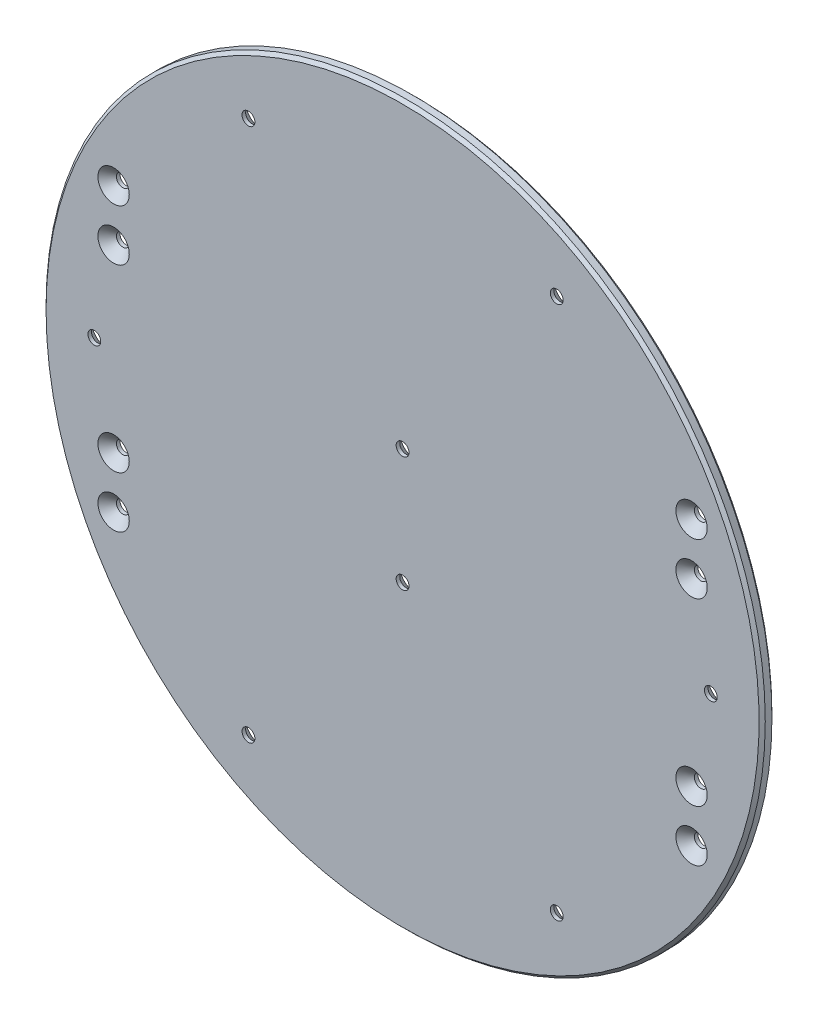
ISO-10303-21;
HEADER;
FILE_DESCRIPTION(('STEP AP214'),'2;1');
FILE_NAME('part.step','',(''),(''),'','','');
FILE_SCHEMA(('AUTOMOTIVE_DESIGN { 1 0 10303 214 1 1 1 1 }'));
ENDSEC;
DATA;
#1=APPLICATION_CONTEXT('core data for automotive mechanical design processes');
#2=APPLICATION_PROTOCOL_DEFINITION('international standard','automotive_design',2000,#1);
#3=PRODUCT_CONTEXT('',#1,'mechanical');
#4=PRODUCT('Part','Part','',(#3));
#5=PRODUCT_RELATED_PRODUCT_CATEGORY('part','',(#4));
#6=PRODUCT_DEFINITION_FORMATION('','',#4);
#7=PRODUCT_DEFINITION_CONTEXT('part definition',#1,'design');
#8=PRODUCT_DEFINITION('design','',#6,#7);
#9=PRODUCT_DEFINITION_SHAPE('','',#8);
#10=(LENGTH_UNIT() NAMED_UNIT(*) SI_UNIT(.MILLI.,.METRE.));
#11=(NAMED_UNIT(*) PLANE_ANGLE_UNIT() SI_UNIT($,.RADIAN.));
#12=(NAMED_UNIT(*) SI_UNIT($,.STERADIAN.) SOLID_ANGLE_UNIT());
#13=UNCERTAINTY_MEASURE_WITH_UNIT(LENGTH_MEASURE(1.E-05),#10,'distance_accuracy_value','');
#14=(GEOMETRIC_REPRESENTATION_CONTEXT(3) GLOBAL_UNCERTAINTY_ASSIGNED_CONTEXT((#13)) GLOBAL_UNIT_ASSIGNED_CONTEXT((#10,
#11,#12)) REPRESENTATION_CONTEXT('',''));
#15=CARTESIAN_POINT('',(0.,0.,0.));
#16=DIRECTION('',(0.,0.,1.));
#17=DIRECTION('',(1.,0.,0.));
#18=AXIS2_PLACEMENT_3D('',#15,#16,#17);
#19=CARTESIAN_POINT('',(0.,0.,3.17500000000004));
#20=DIRECTION('',(0.,0.,-1.));
#21=DIRECTION('',(-1.,0.,0.));
#22=AXIS2_PLACEMENT_3D('',#19,#20,#21);
#23=CYLINDRICAL_SURFACE('',#22,88.9);
#24=CARTESIAN_POINT('',(0.,0.,0.76200000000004));
#25=DIRECTION('',(0.,0.,1.));
#26=DIRECTION('',(1.,0.,0.));
#27=AXIS2_PLACEMENT_3D('',#24,#25,#26);
#28=CIRCLE('',#27,88.9);
#29=CARTESIAN_POINT('',(-88.9,0.,0.76200000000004));
#30=VERTEX_POINT('',#29);
#31=EDGE_CURVE('E41',#30,#30,#28,.T.);
#32=CARTESIAN_POINT('',(0.,0.,2.413));
#33=DIRECTION('',(0.,0.,1.));
#34=DIRECTION('',(1.,0.,0.));
#35=AXIS2_PLACEMENT_3D('',#32,#33,#34);
#36=CIRCLE('',#35,88.9);
#37=CARTESIAN_POINT('',(-88.9,0.,2.413));
#38=VERTEX_POINT('',#37);
#39=EDGE_CURVE('E45',#38,#38,#36,.F.);
#40=CARTESIAN_POINT('',(-88.9,0.,0.76200000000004));
#41=CARTESIAN_POINT('',(-88.9,0.,0.779197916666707));
#42=CARTESIAN_POINT('',(-88.9,0.,0.796395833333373));
#43=CARTESIAN_POINT('',(-88.9,0.,0.830791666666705));
#44=CARTESIAN_POINT('',(-88.9,0.,0.847989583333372));
#45=CARTESIAN_POINT('',(-88.9,0.,0.882385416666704));
#46=CARTESIAN_POINT('',(-88.9,0.,0.89958333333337));
#47=CARTESIAN_POINT('',(-88.9,0.,0.933979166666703));
#48=CARTESIAN_POINT('',(-88.9,0.,0.951177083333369));
#49=CARTESIAN_POINT('',(-88.9,0.,0.985572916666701));
#50=CARTESIAN_POINT('',(-88.9,0.,1.00277083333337));
#51=CARTESIAN_POINT('',(-88.9,0.,1.0371666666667));
#52=CARTESIAN_POINT('',(-88.9,0.,1.05436458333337));
#53=CARTESIAN_POINT('',(-88.9,0.,1.0887604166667));
#54=CARTESIAN_POINT('',(-88.9,0.,1.10595833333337));
#55=CARTESIAN_POINT('',(-88.9,0.,1.1403541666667));
#56=CARTESIAN_POINT('',(-88.9,0.,1.15755208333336));
#57=CARTESIAN_POINT('',(-88.9,0.,1.1919479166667));
#58=CARTESIAN_POINT('',(-88.9,0.,1.20914583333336));
#59=CARTESIAN_POINT('',(-88.9,0.,1.24354166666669));
#60=CARTESIAN_POINT('',(-88.9,0.,1.26073958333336));
#61=CARTESIAN_POINT('',(-88.9,0.,1.29513541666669));
#62=CARTESIAN_POINT('',(-88.9,0.,1.31233333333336));
#63=CARTESIAN_POINT('',(-88.9,0.,1.34672916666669));
#64=CARTESIAN_POINT('',(-88.9,0.,1.36392708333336));
#65=CARTESIAN_POINT('',(-88.9,0.,1.39832291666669));
#66=CARTESIAN_POINT('',(-88.9,0.,1.41552083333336));
#67=CARTESIAN_POINT('',(-88.9,0.,1.44991666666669));
#68=CARTESIAN_POINT('',(-88.9,0.,1.46711458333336));
#69=CARTESIAN_POINT('',(-88.9,0.,1.50151041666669));
#70=CARTESIAN_POINT('',(-88.9,0.,1.51870833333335));
#71=CARTESIAN_POINT('',(-88.9,0.,1.55310416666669));
#72=CARTESIAN_POINT('',(-88.9,0.,1.57030208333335));
#73=CARTESIAN_POINT('',(-88.9,0.,1.60469791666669));
#74=CARTESIAN_POINT('',(-88.9,0.,1.62189583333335));
#75=CARTESIAN_POINT('',(-88.9,0.,1.65629166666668));
#76=CARTESIAN_POINT('',(-88.9,0.,1.67348958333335));
#77=CARTESIAN_POINT('',(-88.9,0.,1.70788541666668));
#78=CARTESIAN_POINT('',(-88.9,0.,1.72508333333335));
#79=CARTESIAN_POINT('',(-88.9,0.,1.75947916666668));
#80=CARTESIAN_POINT('',(-88.9,0.,1.77667708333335));
#81=CARTESIAN_POINT('',(-88.9,0.,1.81107291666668));
#82=CARTESIAN_POINT('',(-88.9,0.,1.82827083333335));
#83=CARTESIAN_POINT('',(-88.9,0.,1.86266666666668));
#84=CARTESIAN_POINT('',(-88.9,0.,1.87986458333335));
#85=CARTESIAN_POINT('',(-88.9,0.,1.91426041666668));
#86=CARTESIAN_POINT('',(-88.9,0.,1.93145833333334));
#87=CARTESIAN_POINT('',(-88.9,0.,1.96585416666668));
#88=CARTESIAN_POINT('',(-88.9,0.,1.98305208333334));
#89=CARTESIAN_POINT('',(-88.9,0.,2.01744791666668));
#90=CARTESIAN_POINT('',(-88.9,0.,2.03464583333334));
#91=CARTESIAN_POINT('',(-88.9,0.,2.06904166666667));
#92=CARTESIAN_POINT('',(-88.9,0.,2.08623958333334));
#93=CARTESIAN_POINT('',(-88.9,0.,2.12063541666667));
#94=CARTESIAN_POINT('',(-88.9,0.,2.13783333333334));
#95=CARTESIAN_POINT('',(-88.9,0.,2.17222916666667));
#96=CARTESIAN_POINT('',(-88.9,0.,2.18942708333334));
#97=CARTESIAN_POINT('',(-88.9,0.,2.22382291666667));
#98=CARTESIAN_POINT('',(-88.9,0.,2.24102083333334));
#99=CARTESIAN_POINT('',(-88.9,0.,2.27541666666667));
#100=CARTESIAN_POINT('',(-88.9,0.,2.29261458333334));
#101=CARTESIAN_POINT('',(-88.9,0.,2.32701041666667));
#102=CARTESIAN_POINT('',(-88.9,0.,2.34420833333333));
#103=CARTESIAN_POINT('',(-88.9,0.,2.37860416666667));
#104=CARTESIAN_POINT('',(-88.9,0.,2.39580208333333));
#105=CARTESIAN_POINT('',(-88.9,0.,2.413));
#106=B_SPLINE_CURVE_WITH_KNOTS('',3,(#40,#41,#42,#43,#44,#45,#46,#47,#48,#49,#50,#51,#52,#53,
#54,#55,#56,#57,#58,#59,#60,#61,#62,#63,#64,#65,#66,#67,#68,#69,#70,#71,#72,#73,#74,#75,#76,#77,
#78,#79,#80,#81,#82,#83,#84,#85,#86,#87,#88,#89,#90,#91,#92,#93,#94,#95,#96,#97,#98,#99,#100,
#101,#102,#103,#104,#105),.UNSPECIFIED.,.F.,.F.,(4,2,2,2,2,2,2,2,2,2,2,2,2,2,2,2,2,2,2,2,2,2,2,
2,2,2,2,2,2,2,2,2,4),(0.,0.0515937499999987,0.103187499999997,0.154781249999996,
0.206374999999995,0.257968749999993,0.309562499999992,0.361156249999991,0.41274999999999,
0.464343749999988,0.515937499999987,0.567531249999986,0.619124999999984,0.670718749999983,
0.722312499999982,0.773906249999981,0.825499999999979,0.877093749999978,0.928687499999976,
0.980281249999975,1.03187499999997,1.08346874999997,1.13506249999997,1.18665624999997,
1.23824999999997,1.28984374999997,1.34143749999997,1.39303124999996,1.44462499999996,
1.49621874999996,1.54781249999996,1.59940624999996,1.65099999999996),.UNSPECIFIED.);
#107=EDGE_CURVE('BSEAM31',#30,#38,#106,.T.);
#108=ORIENTED_EDGE('',*,*,#31,.T.);
#109=ORIENTED_EDGE('',*,*,#39,.T.);
#110=ORIENTED_EDGE('',*,*,#107,.T.);
#111=ORIENTED_EDGE('',*,*,#107,.F.);
#112=EDGE_LOOP('',(#108,#110,#109,#111));
#113=FACE_BOUND('',#112,.T.);
#114=ADVANCED_FACE('F31',(#113),#23,.T.);
#115=CARTESIAN_POINT('',(0.,0.,3.17500000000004));
#116=DIRECTION('',(0.,0.,1.));
#117=DIRECTION('',(1.,0.,0.));
#118=AXIS2_PLACEMENT_3D('',#115,#116,#117);
#119=PLANE('',#118);
#120=CARTESIAN_POINT('',(0.,0.,3.17500000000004));
#121=DIRECTION('',(0.,0.,1.));
#122=DIRECTION('',(1.,0.,0.));
#123=AXIS2_PLACEMENT_3D('',#120,#121,#122);
#124=CIRCLE('',#123,88.138);
#125=CARTESIAN_POINT('',(-88.138,0.,3.17500000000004));
#126=VERTEX_POINT('',#125);
#127=EDGE_CURVE('E10',#126,#126,#124,.T.);
#128=ORIENTED_EDGE('',*,*,#127,.T.);
#129=EDGE_LOOP('',(#128));
#130=FACE_BOUND('',#129,.T.);
#131=CARTESIAN_POINT('',(71.4375,-34.925,3.17500000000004));
#132=DIRECTION('',(0.,0.,1.));
#133=DIRECTION('',(1.,0.,0.));
#134=AXIS2_PLACEMENT_3D('',#131,#132,#133);
#135=CIRCLE('',#134,3.8735);
#136=CARTESIAN_POINT('',(75.311,-34.925,3.17500000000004));
#137=VERTEX_POINT('',#136);
#138=EDGE_CURVE('E119',#137,#137,#135,.F.);
#139=ORIENTED_EDGE('',*,*,#138,.T.);
#140=EDGE_LOOP('',(#139));
#141=FACE_BOUND('',#140,.T.);
#142=CARTESIAN_POINT('',(71.4375,-22.225,3.17500000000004));
#143=DIRECTION('',(0.,0.,1.));
#144=DIRECTION('',(1.,0.,0.));
#145=AXIS2_PLACEMENT_3D('',#142,#143,#144);
#146=CIRCLE('',#145,3.87350000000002);
#147=CARTESIAN_POINT('',(75.311,-22.225,3.17500000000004));
#148=VERTEX_POINT('',#147);
#149=EDGE_CURVE('E122',#148,#148,#146,.F.);
#150=ORIENTED_EDGE('',*,*,#149,.T.);
#151=EDGE_LOOP('',(#150));
#152=FACE_BOUND('',#151,.T.);
#153=CARTESIAN_POINT('',(71.4375,22.225,3.17500000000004));
#154=DIRECTION('',(0.,0.,1.));
#155=DIRECTION('',(1.,0.,0.));
#156=AXIS2_PLACEMENT_3D('',#153,#154,#155);
#157=CIRCLE('',#156,3.87350000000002);
#158=CARTESIAN_POINT('',(75.3110000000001,22.225,3.17500000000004));
#159=VERTEX_POINT('',#158);
#160=EDGE_CURVE('E125',#159,#159,#157,.F.);
#161=ORIENTED_EDGE('',*,*,#160,.T.);
#162=EDGE_LOOP('',(#161));
#163=FACE_BOUND('',#162,.T.);
#164=CARTESIAN_POINT('',(71.4375,34.925,3.17500000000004));
#165=DIRECTION('',(0.,0.,1.));
#166=DIRECTION('',(1.,0.,0.));
#167=AXIS2_PLACEMENT_3D('',#164,#165,#166);
#168=CIRCLE('',#167,3.8735);
#169=CARTESIAN_POINT('',(75.311,34.925,3.17500000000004));
#170=VERTEX_POINT('',#169);
#171=EDGE_CURVE('E128',#170,#170,#168,.F.);
#172=ORIENTED_EDGE('',*,*,#171,.T.);
#173=EDGE_LOOP('',(#172));
#174=FACE_BOUND('',#173,.T.);
#175=CARTESIAN_POINT('',(-71.4375,-34.925,3.17500000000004));
#176=DIRECTION('',(0.,0.,1.));
#177=DIRECTION('',(1.,0.,0.));
#178=AXIS2_PLACEMENT_3D('',#175,#176,#177);
#179=CIRCLE('',#178,3.87350000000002);
#180=CARTESIAN_POINT('',(-67.564,-34.925,3.17500000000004));
#181=VERTEX_POINT('',#180);
#182=EDGE_CURVE('E131',#181,#181,#179,.F.);
#183=ORIENTED_EDGE('',*,*,#182,.T.);
#184=EDGE_LOOP('',(#183));
#185=FACE_BOUND('',#184,.T.);
#186=CARTESIAN_POINT('',(-71.4375,-22.225,3.17500000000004));
#187=DIRECTION('',(0.,0.,1.));
#188=DIRECTION('',(1.,0.,0.));
#189=AXIS2_PLACEMENT_3D('',#186,#187,#188);
#190=CIRCLE('',#189,3.87350000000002);
#191=CARTESIAN_POINT('',(-67.564,-22.225,3.17500000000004));
#192=VERTEX_POINT('',#191);
#193=EDGE_CURVE('E134',#192,#192,#190,.F.);
#194=ORIENTED_EDGE('',*,*,#193,.T.);
#195=EDGE_LOOP('',(#194));
#196=FACE_BOUND('',#195,.T.);
#197=CARTESIAN_POINT('',(-71.4375,22.225,3.17500000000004));
#198=DIRECTION('',(0.,0.,1.));
#199=DIRECTION('',(1.,0.,0.));
#200=AXIS2_PLACEMENT_3D('',#197,#198,#199);
#201=CIRCLE('',#200,3.87350000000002);
#202=CARTESIAN_POINT('',(-67.564,22.225,3.17500000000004));
#203=VERTEX_POINT('',#202);
#204=EDGE_CURVE('E137',#203,#203,#201,.F.);
#205=ORIENTED_EDGE('',*,*,#204,.T.);
#206=EDGE_LOOP('',(#205));
#207=FACE_BOUND('',#206,.T.);
#208=CARTESIAN_POINT('',(-71.4375,34.925,3.17500000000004));
#209=DIRECTION('',(0.,0.,1.));
#210=DIRECTION('',(1.,0.,0.));
#211=AXIS2_PLACEMENT_3D('',#208,#209,#210);
#212=CIRCLE('',#211,3.8735);
#213=CARTESIAN_POINT('',(-67.564,34.925,3.17500000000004));
#214=VERTEX_POINT('',#213);
#215=EDGE_CURVE('E140',#214,#214,#212,.F.);
#216=ORIENTED_EDGE('',*,*,#215,.T.);
#217=EDGE_LOOP('',(#216));
#218=FACE_BOUND('',#217,.T.);
#219=CARTESIAN_POINT('',(38.1000000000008,65.9911357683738,3.17500000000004));
#220=DIRECTION('',(0.,0.,1.));
#221=DIRECTION('',(1.,0.,0.));
#222=AXIS2_PLACEMENT_3D('',#219,#220,#221);
#223=CIRCLE('',#222,1.58749999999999);
#224=CARTESIAN_POINT('',(39.6875000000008,65.9911357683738,3.17500000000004));
#225=VERTEX_POINT('',#224);
#226=EDGE_CURVE('E191',#225,#225,#223,.T.);
#227=ORIENTED_EDGE('',*,*,#226,.F.);
#228=EDGE_LOOP('',(#227));
#229=FACE_BOUND('',#228,.T.);
#230=CARTESIAN_POINT('',(-38.0999999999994,65.9911357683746,3.17500000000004));
#231=DIRECTION('',(0.,0.,1.));
#232=DIRECTION('',(1.,0.,0.));
#233=AXIS2_PLACEMENT_3D('',#230,#231,#232);
#234=CIRCLE('',#233,1.58749999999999);
#235=CARTESIAN_POINT('',(-36.5124999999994,65.9911357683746,3.17500000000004));
#236=VERTEX_POINT('',#235);
#237=EDGE_CURVE('E188',#236,#236,#234,.T.);
#238=ORIENTED_EDGE('',*,*,#237,.F.);
#239=EDGE_LOOP('',(#238));
#240=FACE_BOUND('',#239,.T.);
#241=CARTESIAN_POINT('',(-76.2,5.3210206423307E-13,3.17500000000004));
#242=DIRECTION('',(0.,0.,1.));
#243=DIRECTION('',(1.,0.,0.));
#244=AXIS2_PLACEMENT_3D('',#241,#242,#243);
#245=CIRCLE('',#244,1.5875);
#246=CARTESIAN_POINT('',(-74.6125,5.3210206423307E-13,3.17500000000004));
#247=VERTEX_POINT('',#246);
#248=EDGE_CURVE('E185',#247,#247,#245,.T.);
#249=ORIENTED_EDGE('',*,*,#248,.F.);
#250=EDGE_LOOP('',(#249));
#251=FACE_BOUND('',#250,.T.);
#252=CARTESIAN_POINT('',(-38.1000000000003,-65.9911357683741,3.17500000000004));
#253=DIRECTION('',(0.,0.,1.));
#254=DIRECTION('',(1.,0.,0.));
#255=AXIS2_PLACEMENT_3D('',#252,#253,#254);
#256=CIRCLE('',#255,1.5875);
#257=CARTESIAN_POINT('',(-36.5125000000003,-65.9911357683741,3.17500000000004));
#258=VERTEX_POINT('',#257);
#259=EDGE_CURVE('E182',#258,#258,#256,.T.);
#260=ORIENTED_EDGE('',*,*,#259,.F.);
#261=EDGE_LOOP('',(#260));
#262=FACE_BOUND('',#261,.T.);
#263=CARTESIAN_POINT('',(38.0999999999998,-65.9911357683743,3.17500000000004));
#264=DIRECTION('',(0.,0.,1.));
#265=DIRECTION('',(1.,0.,0.));
#266=AXIS2_PLACEMENT_3D('',#263,#264,#265);
#267=CIRCLE('',#266,1.5875);
#268=CARTESIAN_POINT('',(39.6874999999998,-65.9911357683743,3.17500000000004));
#269=VERTEX_POINT('',#268);
#270=EDGE_CURVE('E179',#269,#269,#267,.T.);
#271=ORIENTED_EDGE('',*,*,#270,.F.);
#272=EDGE_LOOP('',(#271));
#273=FACE_BOUND('',#272,.T.);
#274=CARTESIAN_POINT('',(76.2,0.,3.17500000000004));
#275=DIRECTION('',(0.,0.,1.));
#276=DIRECTION('',(1.,0.,0.));
#277=AXIS2_PLACEMENT_3D('',#274,#275,#276);
#278=CIRCLE('',#277,1.5875);
#279=CARTESIAN_POINT('',(77.7875,0.,3.17500000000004));
#280=VERTEX_POINT('',#279);
#281=EDGE_CURVE('E176',#280,#280,#278,.T.);
#282=ORIENTED_EDGE('',*,*,#281,.F.);
#283=EDGE_LOOP('',(#282));
#284=FACE_BOUND('',#283,.T.);
#285=CARTESIAN_POINT('',(0.,-14.2875,3.17500000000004));
#286=DIRECTION('',(0.,0.,1.));
#287=DIRECTION('',(1.,0.,0.));
#288=AXIS2_PLACEMENT_3D('',#285,#286,#287);
#289=CIRCLE('',#288,1.5875);
#290=CARTESIAN_POINT('',(1.58750000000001,-14.2875,3.17500000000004));
#291=VERTEX_POINT('',#290);
#292=EDGE_CURVE('E173',#291,#291,#289,.T.);
#293=ORIENTED_EDGE('',*,*,#292,.F.);
#294=EDGE_LOOP('',(#293));
#295=FACE_BOUND('',#294,.T.);
#296=CARTESIAN_POINT('',(0.,14.2875,3.17500000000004));
#297=DIRECTION('',(0.,0.,1.));
#298=DIRECTION('',(1.,0.,0.));
#299=AXIS2_PLACEMENT_3D('',#296,#297,#298);
#300=CIRCLE('',#299,1.5875);
#301=CARTESIAN_POINT('',(1.5875,14.2875,3.17500000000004));
#302=VERTEX_POINT('',#301);
#303=EDGE_CURVE('E170',#302,#302,#300,.T.);
#304=ORIENTED_EDGE('',*,*,#303,.F.);
#305=EDGE_LOOP('',(#304));
#306=FACE_BOUND('',#305,.T.);
#307=ADVANCED_FACE('F197',(#130,#141,#152,#163,#174,#185,#196,#207,#218,#229,#240,#251,#262,
#273,#284,#295,#306),#119,.T.);
#308=CARTESIAN_POINT('',(0.,0.,0.));
#309=DIRECTION('',(0.,0.,1.));
#310=DIRECTION('',(1.,0.,0.));
#311=AXIS2_PLACEMENT_3D('',#308,#309,#310);
#312=PLANE('',#311);
#313=CARTESIAN_POINT('',(0.,0.,0.));
#314=DIRECTION('',(0.,0.,1.));
#315=DIRECTION('',(1.,0.,0.));
#316=AXIS2_PLACEMENT_3D('',#313,#314,#315);
#317=CIRCLE('',#316,88.138);
#318=CARTESIAN_POINT('',(88.138,0.,0.));
#319=VERTEX_POINT('',#318);
#320=EDGE_CURVE('E37',#319,#319,#317,.F.);
#321=ORIENTED_EDGE('',*,*,#320,.T.);
#322=EDGE_LOOP('',(#321));
#323=FACE_BOUND('',#322,.T.);
#324=CARTESIAN_POINT('',(0.,-14.2875,0.));
#325=DIRECTION('',(0.,0.,1.));
#326=DIRECTION('',(1.,0.,0.));
#327=AXIS2_PLACEMENT_3D('',#324,#325,#326);
#328=CIRCLE('',#327,3.8735);
#329=CARTESIAN_POINT('',(3.8735,-14.2875,0.));
#330=VERTEX_POINT('',#329);
#331=EDGE_CURVE('E74',#330,#330,#328,.T.);
#332=ORIENTED_EDGE('',*,*,#331,.T.);
#333=EDGE_LOOP('',(#332));
#334=FACE_BOUND('',#333,.T.);
#335=CARTESIAN_POINT('',(0.,14.2875,0.));
#336=DIRECTION('',(0.,0.,1.));
#337=DIRECTION('',(1.,0.,0.));
#338=AXIS2_PLACEMENT_3D('',#335,#336,#337);
#339=CIRCLE('',#338,3.8735);
#340=CARTESIAN_POINT('',(3.8735,14.2875,0.));
#341=VERTEX_POINT('',#340);
#342=EDGE_CURVE('E77',#341,#341,#339,.T.);
#343=ORIENTED_EDGE('',*,*,#342,.T.);
#344=EDGE_LOOP('',(#343));
#345=FACE_BOUND('',#344,.T.);
#346=CARTESIAN_POINT('',(38.1000000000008,65.9911357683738,0.));
#347=DIRECTION('',(0.,0.,1.));
#348=DIRECTION('',(1.,0.,0.));
#349=AXIS2_PLACEMENT_3D('',#346,#347,#348);
#350=CIRCLE('',#349,3.8735);
#351=CARTESIAN_POINT('',(41.9735000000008,65.9911357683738,0.));
#352=VERTEX_POINT('',#351);
#353=EDGE_CURVE('E80',#352,#352,#350,.T.);
#354=ORIENTED_EDGE('',*,*,#353,.T.);
#355=EDGE_LOOP('',(#354));
#356=FACE_BOUND('',#355,.T.);
#357=CARTESIAN_POINT('',(-38.0999999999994,65.9911357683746,0.));
#358=DIRECTION('',(0.,0.,1.));
#359=DIRECTION('',(1.,0.,0.));
#360=AXIS2_PLACEMENT_3D('',#357,#358,#359);
#361=CIRCLE('',#360,3.8735);
#362=CARTESIAN_POINT('',(-34.2264999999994,65.9911357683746,0.));
#363=VERTEX_POINT('',#362);
#364=EDGE_CURVE('E83',#363,#363,#361,.T.);
#365=ORIENTED_EDGE('',*,*,#364,.T.);
#366=EDGE_LOOP('',(#365));
#367=FACE_BOUND('',#366,.T.);
#368=CARTESIAN_POINT('',(-76.2,5.3210206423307E-13,0.));
#369=DIRECTION('',(0.,0.,1.));
#370=DIRECTION('',(1.,0.,0.));
#371=AXIS2_PLACEMENT_3D('',#368,#369,#370);
#372=CIRCLE('',#371,3.87349999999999);
#373=CARTESIAN_POINT('',(-72.3265,5.3210206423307E-13,0.));
#374=VERTEX_POINT('',#373);
#375=EDGE_CURVE('E86',#374,#374,#372,.T.);
#376=ORIENTED_EDGE('',*,*,#375,.T.);
#377=EDGE_LOOP('',(#376));
#378=FACE_BOUND('',#377,.T.);
#379=CARTESIAN_POINT('',(-38.1000000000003,-65.9911357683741,0.));
#380=DIRECTION('',(0.,0.,1.));
#381=DIRECTION('',(1.,0.,0.));
#382=AXIS2_PLACEMENT_3D('',#379,#380,#381);
#383=CIRCLE('',#382,3.87350000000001);
#384=CARTESIAN_POINT('',(-34.2265000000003,-65.9911357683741,0.));
#385=VERTEX_POINT('',#384);
#386=EDGE_CURVE('E89',#385,#385,#383,.T.);
#387=ORIENTED_EDGE('',*,*,#386,.T.);
#388=EDGE_LOOP('',(#387));
#389=FACE_BOUND('',#388,.T.);
#390=CARTESIAN_POINT('',(38.0999999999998,-65.9911357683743,0.));
#391=DIRECTION('',(0.,0.,1.));
#392=DIRECTION('',(1.,0.,0.));
#393=AXIS2_PLACEMENT_3D('',#390,#391,#392);
#394=CIRCLE('',#393,3.8735);
#395=CARTESIAN_POINT('',(41.9734999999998,-65.9911357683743,0.));
#396=VERTEX_POINT('',#395);
#397=EDGE_CURVE('E92',#396,#396,#394,.T.);
#398=ORIENTED_EDGE('',*,*,#397,.T.);
#399=EDGE_LOOP('',(#398));
#400=FACE_BOUND('',#399,.T.);
#401=CARTESIAN_POINT('',(76.2,0.,0.));
#402=DIRECTION('',(0.,0.,1.));
#403=DIRECTION('',(1.,0.,0.));
#404=AXIS2_PLACEMENT_3D('',#401,#402,#403);
#405=CIRCLE('',#404,3.8735);
#406=CARTESIAN_POINT('',(80.0735,0.,0.));
#407=VERTEX_POINT('',#406);
#408=EDGE_CURVE('E95',#407,#407,#405,.T.);
#409=ORIENTED_EDGE('',*,*,#408,.T.);
#410=EDGE_LOOP('',(#409));
#411=FACE_BOUND('',#410,.T.);
#412=CARTESIAN_POINT('',(-71.4375,22.225,0.));
#413=DIRECTION('',(0.,0.,1.));
#414=DIRECTION('',(1.,0.,0.));
#415=AXIS2_PLACEMENT_3D('',#412,#413,#414);
#416=CIRCLE('',#415,1.5875);
#417=CARTESIAN_POINT('',(-69.85,22.225,0.));
#418=VERTEX_POINT('',#417);
#419=EDGE_CURVE('E167',#418,#418,#416,.T.);
#420=ORIENTED_EDGE('',*,*,#419,.T.);
#421=EDGE_LOOP('',(#420));
#422=FACE_BOUND('',#421,.T.);
#423=CARTESIAN_POINT('',(-71.4375,34.925,0.));
#424=DIRECTION('',(0.,0.,1.));
#425=DIRECTION('',(1.,0.,0.));
#426=AXIS2_PLACEMENT_3D('',#423,#424,#425);
#427=CIRCLE('',#426,1.58749999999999);
#428=CARTESIAN_POINT('',(-69.85,34.925,0.));
#429=VERTEX_POINT('',#428);
#430=EDGE_CURVE('E164',#429,#429,#427,.T.);
#431=ORIENTED_EDGE('',*,*,#430,.T.);
#432=EDGE_LOOP('',(#431));
#433=FACE_BOUND('',#432,.T.);
#434=CARTESIAN_POINT('',(-71.4375,-34.925,0.));
#435=DIRECTION('',(0.,0.,1.));
#436=DIRECTION('',(1.,0.,0.));
#437=AXIS2_PLACEMENT_3D('',#434,#435,#436);
#438=CIRCLE('',#437,1.5875);
#439=CARTESIAN_POINT('',(-69.85,-34.925,0.));
#440=VERTEX_POINT('',#439);
#441=EDGE_CURVE('E161',#440,#440,#438,.T.);
#442=ORIENTED_EDGE('',*,*,#441,.T.);
#443=EDGE_LOOP('',(#442));
#444=FACE_BOUND('',#443,.T.);
#445=CARTESIAN_POINT('',(-71.4375,-22.225,0.));
#446=DIRECTION('',(0.,0.,1.));
#447=DIRECTION('',(1.,0.,0.));
#448=AXIS2_PLACEMENT_3D('',#445,#446,#447);
#449=CIRCLE('',#448,1.5875);
#450=CARTESIAN_POINT('',(-69.85,-22.225,0.));
#451=VERTEX_POINT('',#450);
#452=EDGE_CURVE('E158',#451,#451,#449,.T.);
#453=ORIENTED_EDGE('',*,*,#452,.T.);
#454=EDGE_LOOP('',(#453));
#455=FACE_BOUND('',#454,.T.);
#456=CARTESIAN_POINT('',(71.4375,-34.925,0.));
#457=DIRECTION('',(0.,0.,1.));
#458=DIRECTION('',(1.,0.,0.));
#459=AXIS2_PLACEMENT_3D('',#456,#457,#458);
#460=CIRCLE('',#459,1.58749999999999);
#461=CARTESIAN_POINT('',(73.025,-34.925,0.));
#462=VERTEX_POINT('',#461);
#463=EDGE_CURVE('E155',#462,#462,#460,.T.);
#464=ORIENTED_EDGE('',*,*,#463,.T.);
#465=EDGE_LOOP('',(#464));
#466=FACE_BOUND('',#465,.T.);
#467=CARTESIAN_POINT('',(71.4375,-22.225,0.));
#468=DIRECTION('',(0.,0.,1.));
#469=DIRECTION('',(1.,0.,0.));
#470=AXIS2_PLACEMENT_3D('',#467,#468,#469);
#471=CIRCLE('',#470,1.5875);
#472=CARTESIAN_POINT('',(73.025,-22.225,0.));
#473=VERTEX_POINT('',#472);
#474=EDGE_CURVE('E152',#473,#473,#471,.T.);
#475=ORIENTED_EDGE('',*,*,#474,.T.);
#476=EDGE_LOOP('',(#475));
#477=FACE_BOUND('',#476,.T.);
#478=CARTESIAN_POINT('',(71.4375,22.225,0.));
#479=DIRECTION('',(0.,0.,1.));
#480=DIRECTION('',(1.,0.,0.));
#481=AXIS2_PLACEMENT_3D('',#478,#479,#480);
#482=CIRCLE('',#481,1.5875);
#483=CARTESIAN_POINT('',(73.025,22.225,0.));
#484=VERTEX_POINT('',#483);
#485=EDGE_CURVE('E149',#484,#484,#482,.T.);
#486=ORIENTED_EDGE('',*,*,#485,.T.);
#487=EDGE_LOOP('',(#486));
#488=FACE_BOUND('',#487,.T.);
#489=CARTESIAN_POINT('',(71.4375,34.925,0.));
#490=DIRECTION('',(0.,0.,1.));
#491=DIRECTION('',(1.,0.,0.));
#492=AXIS2_PLACEMENT_3D('',#489,#490,#491);
#493=CIRCLE('',#492,1.58749999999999);
#494=CARTESIAN_POINT('',(73.025,34.925,0.));
#495=VERTEX_POINT('',#494);
#496=EDGE_CURVE('E146',#495,#495,#493,.T.);
#497=ORIENTED_EDGE('',*,*,#496,.T.);
#498=EDGE_LOOP('',(#497));
#499=FACE_BOUND('',#498,.T.);
#500=ADVANCED_FACE('F200',(#323,#334,#345,#356,#367,#378,#389,#400,#411,#422,#433,#444,#455,
#466,#477,#488,#499),#312,.F.);
#501=CARTESIAN_POINT('',(71.4375,34.925,0.));
#502=DIRECTION('',(0.,0.,1.));
#503=DIRECTION('',(1.,0.,0.));
#504=AXIS2_PLACEMENT_3D('',#501,#502,#503);
#505=CYLINDRICAL_SURFACE('',#504,1.58749999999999);
#506=CARTESIAN_POINT('',(71.4375,34.925,0.889000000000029));
#507=DIRECTION('',(0.,0.,1.));
#508=DIRECTION('',(1.,0.,0.));
#509=AXIS2_PLACEMENT_3D('',#506,#507,#508);
#510=CIRCLE('',#509,1.58749999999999);
#511=CARTESIAN_POINT('',(73.025,34.925,0.889000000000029));
#512=VERTEX_POINT('',#511);
#513=EDGE_CURVE('E110',#512,#512,#510,.T.);
#514=CARTESIAN_POINT('',(73.025,34.925,0.889000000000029));
#515=CARTESIAN_POINT('',(73.025,34.925,0.879739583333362));
#516=CARTESIAN_POINT('',(73.025,34.925,0.870479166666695));
#517=CARTESIAN_POINT('',(73.025,34.925,0.851958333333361));
#518=CARTESIAN_POINT('',(73.025,34.925,0.842697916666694));
#519=CARTESIAN_POINT('',(73.025,34.925,0.82417708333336));
#520=CARTESIAN_POINT('',(73.025,34.925,0.814916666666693));
#521=CARTESIAN_POINT('',(73.025,34.925,0.796395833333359));
#522=CARTESIAN_POINT('',(73.025,34.925,0.787135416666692));
#523=CARTESIAN_POINT('',(73.025,34.925,0.768614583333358));
#524=CARTESIAN_POINT('',(73.025,34.925,0.759354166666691));
#525=CARTESIAN_POINT('',(73.025,34.925,0.740833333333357));
#526=CARTESIAN_POINT('',(73.025,34.925,0.73157291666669));
#527=CARTESIAN_POINT('',(73.025,34.925,0.713052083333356));
#528=CARTESIAN_POINT('',(73.025,34.925,0.703791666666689));
#529=CARTESIAN_POINT('',(73.025,34.925,0.685270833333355));
#530=CARTESIAN_POINT('',(73.025,34.925,0.676010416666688));
#531=CARTESIAN_POINT('',(73.025,34.925,0.657489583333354));
#532=CARTESIAN_POINT('',(73.025,34.925,0.648229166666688));
#533=CARTESIAN_POINT('',(73.025,34.925,0.629708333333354));
#534=CARTESIAN_POINT('',(73.025,34.925,0.620447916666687));
#535=CARTESIAN_POINT('',(73.025,34.925,0.601927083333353));
#536=CARTESIAN_POINT('',(73.025,34.925,0.592666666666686));
#537=CARTESIAN_POINT('',(73.025,34.925,0.574145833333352));
#538=CARTESIAN_POINT('',(73.025,34.925,0.564885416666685));
#539=CARTESIAN_POINT('',(73.025,34.925,0.546364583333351));
#540=CARTESIAN_POINT('',(73.025,34.925,0.537104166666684));
#541=CARTESIAN_POINT('',(73.025,34.925,0.51858333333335));
#542=CARTESIAN_POINT('',(73.025,34.925,0.509322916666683));
#543=CARTESIAN_POINT('',(73.025,34.925,0.490802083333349));
#544=CARTESIAN_POINT('',(73.025,34.925,0.481541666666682));
#545=CARTESIAN_POINT('',(73.025,34.925,0.463020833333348));
#546=CARTESIAN_POINT('',(73.025,34.925,0.453760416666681));
#547=CARTESIAN_POINT('',(73.025,34.925,0.435239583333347));
#548=CARTESIAN_POINT('',(73.025,34.925,0.42597916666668));
#549=CARTESIAN_POINT('',(73.025,34.925,0.407458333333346));
#550=CARTESIAN_POINT('',(73.025,34.925,0.398197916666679));
#551=CARTESIAN_POINT('',(73.025,34.925,0.379677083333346));
#552=CARTESIAN_POINT('',(73.025,34.925,0.370416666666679));
#553=CARTESIAN_POINT('',(73.025,34.925,0.351895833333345));
#554=CARTESIAN_POINT('',(73.025,34.925,0.342635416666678));
#555=CARTESIAN_POINT('',(73.025,34.925,0.324114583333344));
#556=CARTESIAN_POINT('',(73.025,34.925,0.314854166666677));
#557=CARTESIAN_POINT('',(73.025,34.925,0.296333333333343));
#558=CARTESIAN_POINT('',(73.025,34.925,0.287072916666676));
#559=CARTESIAN_POINT('',(73.025,34.925,0.268552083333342));
#560=CARTESIAN_POINT('',(73.025,34.925,0.259291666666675));
#561=CARTESIAN_POINT('',(73.025,34.925,0.240770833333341));
#562=CARTESIAN_POINT('',(73.025,34.925,0.231510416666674));
#563=CARTESIAN_POINT('',(73.025,34.925,0.21298958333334));
#564=CARTESIAN_POINT('',(73.025,34.925,0.203729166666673));
#565=CARTESIAN_POINT('',(73.025,34.925,0.185208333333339));
#566=CARTESIAN_POINT('',(73.025,34.925,0.175947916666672));
#567=CARTESIAN_POINT('',(73.025,34.925,0.157427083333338));
#568=CARTESIAN_POINT('',(73.025,34.925,0.148166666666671));
#569=CARTESIAN_POINT('',(73.025,34.925,0.129645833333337));
#570=CARTESIAN_POINT('',(73.025,34.925,0.12038541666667));
#571=CARTESIAN_POINT('',(73.025,34.925,0.101864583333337));
#572=CARTESIAN_POINT('',(73.025,34.925,0.0926041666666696));
#573=CARTESIAN_POINT('',(73.025,34.925,0.0740833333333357));
#574=CARTESIAN_POINT('',(73.025,34.925,0.0648229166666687));
#575=CARTESIAN_POINT('',(73.025,34.925,0.0463020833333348));
#576=CARTESIAN_POINT('',(73.025,34.925,0.0370416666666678));
#577=CARTESIAN_POINT('',(73.025,34.925,0.0185208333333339));
#578=CARTESIAN_POINT('',(73.025,34.925,0.00926041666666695));
#579=CARTESIAN_POINT('',(73.025,34.925,0.));
#580=B_SPLINE_CURVE_WITH_KNOTS('',3,(#514,#515,#516,#517,#518,#519,#520,#521,#522,#523,#524,
#525,#526,#527,#528,#529,#530,#531,#532,#533,#534,#535,#536,#537,#538,#539,#540,#541,#542,#543,
#544,#545,#546,#547,#548,#549,#550,#551,#552,#553,#554,#555,#556,#557,#558,#559,#560,#561,#562,
#563,#564,#565,#566,#567,#568,#569,#570,#571,#572,#573,#574,#575,#576,#577,#578,#579),
.UNSPECIFIED.,.F.,.F.,(4,2,2,2,2,2,2,2,2,2,2,2,2,2,2,2,2,2,2,2,2,2,2,2,2,2,2,2,2,2,2,2,4),(0.,
0.0277812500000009,0.0555625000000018,0.0833437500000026,0.111125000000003,0.138906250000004,
0.166687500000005,0.194468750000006,0.222250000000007,0.250031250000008,0.277812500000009,
0.30559375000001,0.333375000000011,0.361156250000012,0.388937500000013,0.416718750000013,
0.444500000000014,0.472281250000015,0.500062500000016,0.527843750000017,0.555625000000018,
0.583406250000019,0.61118750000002,0.638968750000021,0.666750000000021,0.694531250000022,
0.722312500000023,0.750093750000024,0.777875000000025,0.805656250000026,0.833437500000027,
0.861218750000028,0.889000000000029),.UNSPECIFIED.);
#581=EDGE_CURVE('BSEAM344',#512,#495,#580,.T.);
#582=ORIENTED_EDGE('',*,*,#513,.T.);
#583=ORIENTED_EDGE('',*,*,#496,.F.);
#584=ORIENTED_EDGE('',*,*,#581,.T.);
#585=ORIENTED_EDGE('',*,*,#581,.F.);
#586=EDGE_LOOP('',(#582,#584,#583,#585));
#587=FACE_BOUND('',#586,.T.);
#588=ADVANCED_FACE('F344',(#587),#505,.F.);
#589=CARTESIAN_POINT('',(71.4375,22.225,0.));
#590=DIRECTION('',(0.,0.,1.));
#591=DIRECTION('',(1.,0.,0.));
#592=AXIS2_PLACEMENT_3D('',#589,#590,#591);
#593=CYLINDRICAL_SURFACE('',#592,1.5875);
#594=CARTESIAN_POINT('',(71.4375,22.225,0.889000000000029));
#595=DIRECTION('',(0.,0.,1.));
#596=DIRECTION('',(1.,0.,0.));
#597=AXIS2_PLACEMENT_3D('',#594,#595,#596);
#598=CIRCLE('',#597,1.5875);
#599=CARTESIAN_POINT('',(73.025,22.225,0.889000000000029));
#600=VERTEX_POINT('',#599);
#601=EDGE_CURVE('E113',#600,#600,#598,.T.);
#602=CARTESIAN_POINT('',(73.025,22.225,0.889000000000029));
#603=CARTESIAN_POINT('',(73.025,22.225,0.879739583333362));
#604=CARTESIAN_POINT('',(73.025,22.225,0.870479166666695));
#605=CARTESIAN_POINT('',(73.025,22.225,0.851958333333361));
#606=CARTESIAN_POINT('',(73.025,22.225,0.842697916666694));
#607=CARTESIAN_POINT('',(73.025,22.225,0.82417708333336));
#608=CARTESIAN_POINT('',(73.025,22.225,0.814916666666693));
#609=CARTESIAN_POINT('',(73.025,22.225,0.796395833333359));
#610=CARTESIAN_POINT('',(73.025,22.225,0.787135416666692));
#611=CARTESIAN_POINT('',(73.025,22.225,0.768614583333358));
#612=CARTESIAN_POINT('',(73.025,22.225,0.759354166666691));
#613=CARTESIAN_POINT('',(73.025,22.225,0.740833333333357));
#614=CARTESIAN_POINT('',(73.025,22.225,0.73157291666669));
#615=CARTESIAN_POINT('',(73.025,22.225,0.713052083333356));
#616=CARTESIAN_POINT('',(73.025,22.225,0.703791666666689));
#617=CARTESIAN_POINT('',(73.025,22.225,0.685270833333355));
#618=CARTESIAN_POINT('',(73.025,22.225,0.676010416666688));
#619=CARTESIAN_POINT('',(73.025,22.225,0.657489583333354));
#620=CARTESIAN_POINT('',(73.025,22.225,0.648229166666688));
#621=CARTESIAN_POINT('',(73.025,22.225,0.629708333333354));
#622=CARTESIAN_POINT('',(73.025,22.225,0.620447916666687));
#623=CARTESIAN_POINT('',(73.025,22.225,0.601927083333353));
#624=CARTESIAN_POINT('',(73.025,22.225,0.592666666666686));
#625=CARTESIAN_POINT('',(73.025,22.225,0.574145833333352));
#626=CARTESIAN_POINT('',(73.025,22.225,0.564885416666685));
#627=CARTESIAN_POINT('',(73.025,22.225,0.546364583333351));
#628=CARTESIAN_POINT('',(73.025,22.225,0.537104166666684));
#629=CARTESIAN_POINT('',(73.025,22.225,0.51858333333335));
#630=CARTESIAN_POINT('',(73.025,22.225,0.509322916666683));
#631=CARTESIAN_POINT('',(73.025,22.225,0.490802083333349));
#632=CARTESIAN_POINT('',(73.025,22.225,0.481541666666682));
#633=CARTESIAN_POINT('',(73.025,22.225,0.463020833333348));
#634=CARTESIAN_POINT('',(73.025,22.225,0.453760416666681));
#635=CARTESIAN_POINT('',(73.025,22.225,0.435239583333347));
#636=CARTESIAN_POINT('',(73.025,22.225,0.42597916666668));
#637=CARTESIAN_POINT('',(73.025,22.225,0.407458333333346));
#638=CARTESIAN_POINT('',(73.025,22.225,0.398197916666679));
#639=CARTESIAN_POINT('',(73.025,22.225,0.379677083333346));
#640=CARTESIAN_POINT('',(73.025,22.225,0.370416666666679));
#641=CARTESIAN_POINT('',(73.025,22.225,0.351895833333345));
#642=CARTESIAN_POINT('',(73.025,22.225,0.342635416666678));
#643=CARTESIAN_POINT('',(73.025,22.225,0.324114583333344));
#644=CARTESIAN_POINT('',(73.025,22.225,0.314854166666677));
#645=CARTESIAN_POINT('',(73.025,22.225,0.296333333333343));
#646=CARTESIAN_POINT('',(73.025,22.225,0.287072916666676));
#647=CARTESIAN_POINT('',(73.025,22.225,0.268552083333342));
#648=CARTESIAN_POINT('',(73.025,22.225,0.259291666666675));
#649=CARTESIAN_POINT('',(73.025,22.225,0.240770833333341));
#650=CARTESIAN_POINT('',(73.025,22.225,0.231510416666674));
#651=CARTESIAN_POINT('',(73.025,22.225,0.21298958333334));
#652=CARTESIAN_POINT('',(73.025,22.225,0.203729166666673));
#653=CARTESIAN_POINT('',(73.025,22.225,0.185208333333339));
#654=CARTESIAN_POINT('',(73.025,22.225,0.175947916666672));
#655=CARTESIAN_POINT('',(73.025,22.225,0.157427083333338));
#656=CARTESIAN_POINT('',(73.025,22.225,0.148166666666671));
#657=CARTESIAN_POINT('',(73.025,22.225,0.129645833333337));
#658=CARTESIAN_POINT('',(73.025,22.225,0.12038541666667));
#659=CARTESIAN_POINT('',(73.025,22.225,0.101864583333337));
#660=CARTESIAN_POINT('',(73.025,22.225,0.0926041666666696));
#661=CARTESIAN_POINT('',(73.025,22.225,0.0740833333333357));
#662=CARTESIAN_POINT('',(73.025,22.225,0.0648229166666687));
#663=CARTESIAN_POINT('',(73.025,22.225,0.0463020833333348));
#664=CARTESIAN_POINT('',(73.025,22.225,0.0370416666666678));
#665=CARTESIAN_POINT('',(73.025,22.225,0.0185208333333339));
#666=CARTESIAN_POINT('',(73.025,22.225,0.00926041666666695));
#667=CARTESIAN_POINT('',(73.025,22.225,0.));
#668=B_SPLINE_CURVE_WITH_KNOTS('',3,(#602,#603,#604,#605,#606,#607,#608,#609,#610,#611,#612,
#613,#614,#615,#616,#617,#618,#619,#620,#621,#622,#623,#624,#625,#626,#627,#628,#629,#630,#631,
#632,#633,#634,#635,#636,#637,#638,#639,#640,#641,#642,#643,#644,#645,#646,#647,#648,#649,#650,
#651,#652,#653,#654,#655,#656,#657,#658,#659,#660,#661,#662,#663,#664,#665,#666,#667),
.UNSPECIFIED.,.F.,.F.,(4,2,2,2,2,2,2,2,2,2,2,2,2,2,2,2,2,2,2,2,2,2,2,2,2,2,2,2,2,2,2,2,4),(0.,
0.0277812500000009,0.0555625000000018,0.0833437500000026,0.111125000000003,0.138906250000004,
0.166687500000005,0.194468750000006,0.222250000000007,0.250031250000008,0.277812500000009,
0.30559375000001,0.333375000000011,0.361156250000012,0.388937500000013,0.416718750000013,
0.444500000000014,0.472281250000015,0.500062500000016,0.527843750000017,0.555625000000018,
0.583406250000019,0.61118750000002,0.638968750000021,0.666750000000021,0.694531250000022,
0.722312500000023,0.750093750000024,0.777875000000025,0.805656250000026,0.833437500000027,
0.861218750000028,0.889000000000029),.UNSPECIFIED.);
#669=EDGE_CURVE('BSEAM363',#600,#484,#668,.T.);
#670=ORIENTED_EDGE('',*,*,#601,.T.);
#671=ORIENTED_EDGE('',*,*,#485,.F.);
#672=ORIENTED_EDGE('',*,*,#669,.T.);
#673=ORIENTED_EDGE('',*,*,#669,.F.);
#674=EDGE_LOOP('',(#670,#672,#671,#673));
#675=FACE_BOUND('',#674,.T.);
#676=ADVANCED_FACE('F363',(#675),#593,.F.);
#677=CARTESIAN_POINT('',(71.4375,-22.225,0.));
#678=DIRECTION('',(0.,0.,1.));
#679=DIRECTION('',(1.,0.,0.));
#680=AXIS2_PLACEMENT_3D('',#677,#678,#679);
#681=CYLINDRICAL_SURFACE('',#680,1.5875);
#682=CARTESIAN_POINT('',(71.4375,-22.225,0.889000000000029));
#683=DIRECTION('',(0.,0.,1.));
#684=DIRECTION('',(1.,0.,0.));
#685=AXIS2_PLACEMENT_3D('',#682,#683,#684);
#686=CIRCLE('',#685,1.5875);
#687=CARTESIAN_POINT('',(73.025,-22.225,0.889000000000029));
#688=VERTEX_POINT('',#687);
#689=EDGE_CURVE('E116',#688,#688,#686,.T.);
#690=CARTESIAN_POINT('',(73.025,-22.225,0.889000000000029));
#691=CARTESIAN_POINT('',(73.025,-22.225,0.879739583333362));
#692=CARTESIAN_POINT('',(73.025,-22.225,0.870479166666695));
#693=CARTESIAN_POINT('',(73.025,-22.225,0.851958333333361));
#694=CARTESIAN_POINT('',(73.025,-22.225,0.842697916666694));
#695=CARTESIAN_POINT('',(73.025,-22.225,0.82417708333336));
#696=CARTESIAN_POINT('',(73.025,-22.225,0.814916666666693));
#697=CARTESIAN_POINT('',(73.025,-22.225,0.796395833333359));
#698=CARTESIAN_POINT('',(73.025,-22.225,0.787135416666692));
#699=CARTESIAN_POINT('',(73.025,-22.225,0.768614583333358));
#700=CARTESIAN_POINT('',(73.025,-22.225,0.759354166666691));
#701=CARTESIAN_POINT('',(73.025,-22.225,0.740833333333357));
#702=CARTESIAN_POINT('',(73.025,-22.225,0.73157291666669));
#703=CARTESIAN_POINT('',(73.025,-22.225,0.713052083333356));
#704=CARTESIAN_POINT('',(73.025,-22.225,0.703791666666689));
#705=CARTESIAN_POINT('',(73.025,-22.225,0.685270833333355));
#706=CARTESIAN_POINT('',(73.025,-22.225,0.676010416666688));
#707=CARTESIAN_POINT('',(73.025,-22.225,0.657489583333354));
#708=CARTESIAN_POINT('',(73.025,-22.225,0.648229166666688));
#709=CARTESIAN_POINT('',(73.025,-22.225,0.629708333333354));
#710=CARTESIAN_POINT('',(73.025,-22.225,0.620447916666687));
#711=CARTESIAN_POINT('',(73.025,-22.225,0.601927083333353));
#712=CARTESIAN_POINT('',(73.025,-22.225,0.592666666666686));
#713=CARTESIAN_POINT('',(73.025,-22.225,0.574145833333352));
#714=CARTESIAN_POINT('',(73.025,-22.225,0.564885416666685));
#715=CARTESIAN_POINT('',(73.025,-22.225,0.546364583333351));
#716=CARTESIAN_POINT('',(73.025,-22.225,0.537104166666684));
#717=CARTESIAN_POINT('',(73.025,-22.225,0.51858333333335));
#718=CARTESIAN_POINT('',(73.025,-22.225,0.509322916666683));
#719=CARTESIAN_POINT('',(73.025,-22.225,0.490802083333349));
#720=CARTESIAN_POINT('',(73.025,-22.225,0.481541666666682));
#721=CARTESIAN_POINT('',(73.025,-22.225,0.463020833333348));
#722=CARTESIAN_POINT('',(73.025,-22.225,0.453760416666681));
#723=CARTESIAN_POINT('',(73.025,-22.225,0.435239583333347));
#724=CARTESIAN_POINT('',(73.025,-22.225,0.42597916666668));
#725=CARTESIAN_POINT('',(73.025,-22.225,0.407458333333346));
#726=CARTESIAN_POINT('',(73.025,-22.225,0.398197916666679));
#727=CARTESIAN_POINT('',(73.025,-22.225,0.379677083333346));
#728=CARTESIAN_POINT('',(73.025,-22.225,0.370416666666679));
#729=CARTESIAN_POINT('',(73.025,-22.225,0.351895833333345));
#730=CARTESIAN_POINT('',(73.025,-22.225,0.342635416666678));
#731=CARTESIAN_POINT('',(73.025,-22.225,0.324114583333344));
#732=CARTESIAN_POINT('',(73.025,-22.225,0.314854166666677));
#733=CARTESIAN_POINT('',(73.025,-22.225,0.296333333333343));
#734=CARTESIAN_POINT('',(73.025,-22.225,0.287072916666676));
#735=CARTESIAN_POINT('',(73.025,-22.225,0.268552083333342));
#736=CARTESIAN_POINT('',(73.025,-22.225,0.259291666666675));
#737=CARTESIAN_POINT('',(73.025,-22.225,0.240770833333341));
#738=CARTESIAN_POINT('',(73.025,-22.225,0.231510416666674));
#739=CARTESIAN_POINT('',(73.025,-22.225,0.21298958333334));
#740=CARTESIAN_POINT('',(73.025,-22.225,0.203729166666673));
#741=CARTESIAN_POINT('',(73.025,-22.225,0.185208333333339));
#742=CARTESIAN_POINT('',(73.025,-22.225,0.175947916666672));
#743=CARTESIAN_POINT('',(73.025,-22.225,0.157427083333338));
#744=CARTESIAN_POINT('',(73.025,-22.225,0.148166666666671));
#745=CARTESIAN_POINT('',(73.025,-22.225,0.129645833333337));
#746=CARTESIAN_POINT('',(73.025,-22.225,0.12038541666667));
#747=CARTESIAN_POINT('',(73.025,-22.225,0.101864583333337));
#748=CARTESIAN_POINT('',(73.025,-22.225,0.0926041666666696));
#749=CARTESIAN_POINT('',(73.025,-22.225,0.0740833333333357));
#750=CARTESIAN_POINT('',(73.025,-22.225,0.0648229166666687));
#751=CARTESIAN_POINT('',(73.025,-22.225,0.0463020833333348));
#752=CARTESIAN_POINT('',(73.025,-22.225,0.0370416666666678));
#753=CARTESIAN_POINT('',(73.025,-22.225,0.0185208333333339));
#754=CARTESIAN_POINT('',(73.025,-22.225,0.00926041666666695));
#755=CARTESIAN_POINT('',(73.025,-22.225,0.));
#756=B_SPLINE_CURVE_WITH_KNOTS('',3,(#690,#691,#692,#693,#694,#695,#696,#697,#698,#699,#700,
#701,#702,#703,#704,#705,#706,#707,#708,#709,#710,#711,#712,#713,#714,#715,#716,#717,#718,#719,
#720,#721,#722,#723,#724,#725,#726,#727,#728,#729,#730,#731,#732,#733,#734,#735,#736,#737,#738,
#739,#740,#741,#742,#743,#744,#745,#746,#747,#748,#749,#750,#751,#752,#753,#754,#755),
.UNSPECIFIED.,.F.,.F.,(4,2,2,2,2,2,2,2,2,2,2,2,2,2,2,2,2,2,2,2,2,2,2,2,2,2,2,2,2,2,2,2,4),(0.,
0.0277812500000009,0.0555625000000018,0.0833437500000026,0.111125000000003,0.138906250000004,
0.166687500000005,0.194468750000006,0.222250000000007,0.250031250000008,0.277812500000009,
0.30559375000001,0.333375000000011,0.361156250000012,0.388937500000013,0.416718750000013,
0.444500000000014,0.472281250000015,0.500062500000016,0.527843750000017,0.555625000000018,
0.583406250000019,0.61118750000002,0.638968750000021,0.666750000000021,0.694531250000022,
0.722312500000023,0.750093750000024,0.777875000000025,0.805656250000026,0.833437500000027,
0.861218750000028,0.889000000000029),.UNSPECIFIED.);
#757=EDGE_CURVE('BSEAM369',#688,#473,#756,.T.);
#758=ORIENTED_EDGE('',*,*,#689,.T.);
#759=ORIENTED_EDGE('',*,*,#474,.F.);
#760=ORIENTED_EDGE('',*,*,#757,.T.);
#761=ORIENTED_EDGE('',*,*,#757,.F.);
#762=EDGE_LOOP('',(#758,#760,#759,#761));
#763=FACE_BOUND('',#762,.T.);
#764=ADVANCED_FACE('F369',(#763),#681,.F.);
#765=CARTESIAN_POINT('',(71.4375,-34.925,0.));
#766=DIRECTION('',(0.,0.,1.));
#767=DIRECTION('',(1.,0.,0.));
#768=AXIS2_PLACEMENT_3D('',#765,#766,#767);
#769=CYLINDRICAL_SURFACE('',#768,1.58749999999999);
#770=CARTESIAN_POINT('',(71.4375,-34.925,0.889000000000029));
#771=DIRECTION('',(0.,0.,1.));
#772=DIRECTION('',(1.,0.,0.));
#773=AXIS2_PLACEMENT_3D('',#770,#771,#772);
#774=CIRCLE('',#773,1.58749999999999);
#775=CARTESIAN_POINT('',(73.025,-34.925,0.889000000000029));
#776=VERTEX_POINT('',#775);
#777=EDGE_CURVE('E143',#776,#776,#774,.T.);
#778=CARTESIAN_POINT('',(73.025,-34.925,0.889000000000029));
#779=CARTESIAN_POINT('',(73.025,-34.925,0.879739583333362));
#780=CARTESIAN_POINT('',(73.025,-34.925,0.870479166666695));
#781=CARTESIAN_POINT('',(73.025,-34.925,0.851958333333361));
#782=CARTESIAN_POINT('',(73.025,-34.925,0.842697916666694));
#783=CARTESIAN_POINT('',(73.025,-34.925,0.82417708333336));
#784=CARTESIAN_POINT('',(73.025,-34.925,0.814916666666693));
#785=CARTESIAN_POINT('',(73.025,-34.925,0.796395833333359));
#786=CARTESIAN_POINT('',(73.025,-34.925,0.787135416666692));
#787=CARTESIAN_POINT('',(73.025,-34.925,0.768614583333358));
#788=CARTESIAN_POINT('',(73.025,-34.925,0.759354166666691));
#789=CARTESIAN_POINT('',(73.025,-34.925,0.740833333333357));
#790=CARTESIAN_POINT('',(73.025,-34.925,0.73157291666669));
#791=CARTESIAN_POINT('',(73.025,-34.925,0.713052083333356));
#792=CARTESIAN_POINT('',(73.025,-34.925,0.703791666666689));
#793=CARTESIAN_POINT('',(73.025,-34.925,0.685270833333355));
#794=CARTESIAN_POINT('',(73.025,-34.925,0.676010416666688));
#795=CARTESIAN_POINT('',(73.025,-34.925,0.657489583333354));
#796=CARTESIAN_POINT('',(73.025,-34.925,0.648229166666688));
#797=CARTESIAN_POINT('',(73.025,-34.925,0.629708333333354));
#798=CARTESIAN_POINT('',(73.025,-34.925,0.620447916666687));
#799=CARTESIAN_POINT('',(73.025,-34.925,0.601927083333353));
#800=CARTESIAN_POINT('',(73.025,-34.925,0.592666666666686));
#801=CARTESIAN_POINT('',(73.025,-34.925,0.574145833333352));
#802=CARTESIAN_POINT('',(73.025,-34.925,0.564885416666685));
#803=CARTESIAN_POINT('',(73.025,-34.925,0.546364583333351));
#804=CARTESIAN_POINT('',(73.025,-34.925,0.537104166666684));
#805=CARTESIAN_POINT('',(73.025,-34.925,0.51858333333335));
#806=CARTESIAN_POINT('',(73.025,-34.925,0.509322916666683));
#807=CARTESIAN_POINT('',(73.025,-34.925,0.490802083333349));
#808=CARTESIAN_POINT('',(73.025,-34.925,0.481541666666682));
#809=CARTESIAN_POINT('',(73.025,-34.925,0.463020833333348));
#810=CARTESIAN_POINT('',(73.025,-34.925,0.453760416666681));
#811=CARTESIAN_POINT('',(73.025,-34.925,0.435239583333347));
#812=CARTESIAN_POINT('',(73.025,-34.925,0.42597916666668));
#813=CARTESIAN_POINT('',(73.025,-34.925,0.407458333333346));
#814=CARTESIAN_POINT('',(73.025,-34.925,0.398197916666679));
#815=CARTESIAN_POINT('',(73.025,-34.925,0.379677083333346));
#816=CARTESIAN_POINT('',(73.025,-34.925,0.370416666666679));
#817=CARTESIAN_POINT('',(73.025,-34.925,0.351895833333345));
#818=CARTESIAN_POINT('',(73.025,-34.925,0.342635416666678));
#819=CARTESIAN_POINT('',(73.025,-34.925,0.324114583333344));
#820=CARTESIAN_POINT('',(73.025,-34.925,0.314854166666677));
#821=CARTESIAN_POINT('',(73.025,-34.925,0.296333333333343));
#822=CARTESIAN_POINT('',(73.025,-34.925,0.287072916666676));
#823=CARTESIAN_POINT('',(73.025,-34.925,0.268552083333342));
#824=CARTESIAN_POINT('',(73.025,-34.925,0.259291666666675));
#825=CARTESIAN_POINT('',(73.025,-34.925,0.240770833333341));
#826=CARTESIAN_POINT('',(73.025,-34.925,0.231510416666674));
#827=CARTESIAN_POINT('',(73.025,-34.925,0.21298958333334));
#828=CARTESIAN_POINT('',(73.025,-34.925,0.203729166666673));
#829=CARTESIAN_POINT('',(73.025,-34.925,0.185208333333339));
#830=CARTESIAN_POINT('',(73.025,-34.925,0.175947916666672));
#831=CARTESIAN_POINT('',(73.025,-34.925,0.157427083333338));
#832=CARTESIAN_POINT('',(73.025,-34.925,0.148166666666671));
#833=CARTESIAN_POINT('',(73.025,-34.925,0.129645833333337));
#834=CARTESIAN_POINT('',(73.025,-34.925,0.12038541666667));
#835=CARTESIAN_POINT('',(73.025,-34.925,0.101864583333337));
#836=CARTESIAN_POINT('',(73.025,-34.925,0.0926041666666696));
#837=CARTESIAN_POINT('',(73.025,-34.925,0.0740833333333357));
#838=CARTESIAN_POINT('',(73.025,-34.925,0.0648229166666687));
#839=CARTESIAN_POINT('',(73.025,-34.925,0.0463020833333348));
#840=CARTESIAN_POINT('',(73.025,-34.925,0.0370416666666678));
#841=CARTESIAN_POINT('',(73.025,-34.925,0.0185208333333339));
#842=CARTESIAN_POINT('',(73.025,-34.925,0.00926041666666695));
#843=CARTESIAN_POINT('',(73.025,-34.925,0.));
#844=B_SPLINE_CURVE_WITH_KNOTS('',3,(#778,#779,#780,#781,#782,#783,#784,#785,#786,#787,#788,
#789,#790,#791,#792,#793,#794,#795,#796,#797,#798,#799,#800,#801,#802,#803,#804,#805,#806,#807,
#808,#809,#810,#811,#812,#813,#814,#815,#816,#817,#818,#819,#820,#821,#822,#823,#824,#825,#826,
#827,#828,#829,#830,#831,#832,#833,#834,#835,#836,#837,#838,#839,#840,#841,#842,#843),
.UNSPECIFIED.,.F.,.F.,(4,2,2,2,2,2,2,2,2,2,2,2,2,2,2,2,2,2,2,2,2,2,2,2,2,2,2,2,2,2,2,2,4),(0.,
0.0277812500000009,0.0555625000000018,0.0833437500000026,0.111125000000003,0.138906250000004,
0.166687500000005,0.194468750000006,0.222250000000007,0.250031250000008,0.277812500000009,
0.30559375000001,0.333375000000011,0.361156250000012,0.388937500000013,0.416718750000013,
0.444500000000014,0.472281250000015,0.500062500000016,0.527843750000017,0.555625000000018,
0.583406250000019,0.61118750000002,0.638968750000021,0.666750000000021,0.694531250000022,
0.722312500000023,0.750093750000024,0.777875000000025,0.805656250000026,0.833437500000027,
0.861218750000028,0.889000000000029),.UNSPECIFIED.);
#845=EDGE_CURVE('BSEAM375',#776,#462,#844,.T.);
#846=ORIENTED_EDGE('',*,*,#777,.T.);
#847=ORIENTED_EDGE('',*,*,#463,.F.);
#848=ORIENTED_EDGE('',*,*,#845,.T.);
#849=ORIENTED_EDGE('',*,*,#845,.F.);
#850=EDGE_LOOP('',(#846,#848,#847,#849));
#851=FACE_BOUND('',#850,.T.);
#852=ADVANCED_FACE('F375',(#851),#769,.F.);
#853=CARTESIAN_POINT('',(-71.4375,-22.225,0.));
#854=DIRECTION('',(0.,0.,1.));
#855=DIRECTION('',(1.,0.,0.));
#856=AXIS2_PLACEMENT_3D('',#853,#854,#855);
#857=CYLINDRICAL_SURFACE('',#856,1.5875);
#858=CARTESIAN_POINT('',(-71.4375,-22.225,0.889000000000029));
#859=DIRECTION('',(0.,0.,1.));
#860=DIRECTION('',(1.,0.,0.));
#861=AXIS2_PLACEMENT_3D('',#858,#859,#860);
#862=CIRCLE('',#861,1.5875);
#863=CARTESIAN_POINT('',(-69.85,-22.225,0.889000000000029));
#864=VERTEX_POINT('',#863);
#865=EDGE_CURVE('E104',#864,#864,#862,.T.);
#866=CARTESIAN_POINT('',(-69.85,-22.225,0.889000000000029));
#867=CARTESIAN_POINT('',(-69.85,-22.225,0.879739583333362));
#868=CARTESIAN_POINT('',(-69.85,-22.225,0.870479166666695));
#869=CARTESIAN_POINT('',(-69.85,-22.225,0.851958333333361));
#870=CARTESIAN_POINT('',(-69.85,-22.225,0.842697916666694));
#871=CARTESIAN_POINT('',(-69.85,-22.225,0.82417708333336));
#872=CARTESIAN_POINT('',(-69.85,-22.225,0.814916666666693));
#873=CARTESIAN_POINT('',(-69.85,-22.225,0.796395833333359));
#874=CARTESIAN_POINT('',(-69.85,-22.225,0.787135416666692));
#875=CARTESIAN_POINT('',(-69.85,-22.225,0.768614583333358));
#876=CARTESIAN_POINT('',(-69.85,-22.225,0.759354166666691));
#877=CARTESIAN_POINT('',(-69.85,-22.225,0.740833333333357));
#878=CARTESIAN_POINT('',(-69.85,-22.225,0.73157291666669));
#879=CARTESIAN_POINT('',(-69.85,-22.225,0.713052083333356));
#880=CARTESIAN_POINT('',(-69.85,-22.225,0.703791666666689));
#881=CARTESIAN_POINT('',(-69.85,-22.225,0.685270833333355));
#882=CARTESIAN_POINT('',(-69.85,-22.225,0.676010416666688));
#883=CARTESIAN_POINT('',(-69.85,-22.225,0.657489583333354));
#884=CARTESIAN_POINT('',(-69.85,-22.225,0.648229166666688));
#885=CARTESIAN_POINT('',(-69.85,-22.225,0.629708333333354));
#886=CARTESIAN_POINT('',(-69.85,-22.225,0.620447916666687));
#887=CARTESIAN_POINT('',(-69.85,-22.225,0.601927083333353));
#888=CARTESIAN_POINT('',(-69.85,-22.225,0.592666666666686));
#889=CARTESIAN_POINT('',(-69.85,-22.225,0.574145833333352));
#890=CARTESIAN_POINT('',(-69.85,-22.225,0.564885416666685));
#891=CARTESIAN_POINT('',(-69.85,-22.225,0.546364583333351));
#892=CARTESIAN_POINT('',(-69.85,-22.225,0.537104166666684));
#893=CARTESIAN_POINT('',(-69.85,-22.225,0.51858333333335));
#894=CARTESIAN_POINT('',(-69.85,-22.225,0.509322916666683));
#895=CARTESIAN_POINT('',(-69.85,-22.225,0.490802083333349));
#896=CARTESIAN_POINT('',(-69.85,-22.225,0.481541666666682));
#897=CARTESIAN_POINT('',(-69.85,-22.225,0.463020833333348));
#898=CARTESIAN_POINT('',(-69.85,-22.225,0.453760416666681));
#899=CARTESIAN_POINT('',(-69.85,-22.225,0.435239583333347));
#900=CARTESIAN_POINT('',(-69.85,-22.225,0.42597916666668));
#901=CARTESIAN_POINT('',(-69.85,-22.225,0.407458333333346));
#902=CARTESIAN_POINT('',(-69.85,-22.225,0.398197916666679));
#903=CARTESIAN_POINT('',(-69.85,-22.225,0.379677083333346));
#904=CARTESIAN_POINT('',(-69.85,-22.225,0.370416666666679));
#905=CARTESIAN_POINT('',(-69.85,-22.225,0.351895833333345));
#906=CARTESIAN_POINT('',(-69.85,-22.225,0.342635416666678));
#907=CARTESIAN_POINT('',(-69.85,-22.225,0.324114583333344));
#908=CARTESIAN_POINT('',(-69.85,-22.225,0.314854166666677));
#909=CARTESIAN_POINT('',(-69.85,-22.225,0.296333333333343));
#910=CARTESIAN_POINT('',(-69.85,-22.225,0.287072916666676));
#911=CARTESIAN_POINT('',(-69.85,-22.225,0.268552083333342));
#912=CARTESIAN_POINT('',(-69.85,-22.225,0.259291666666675));
#913=CARTESIAN_POINT('',(-69.85,-22.225,0.240770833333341));
#914=CARTESIAN_POINT('',(-69.85,-22.225,0.231510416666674));
#915=CARTESIAN_POINT('',(-69.85,-22.225,0.21298958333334));
#916=CARTESIAN_POINT('',(-69.85,-22.225,0.203729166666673));
#917=CARTESIAN_POINT('',(-69.85,-22.225,0.185208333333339));
#918=CARTESIAN_POINT('',(-69.85,-22.225,0.175947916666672));
#919=CARTESIAN_POINT('',(-69.85,-22.225,0.157427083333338));
#920=CARTESIAN_POINT('',(-69.85,-22.225,0.148166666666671));
#921=CARTESIAN_POINT('',(-69.85,-22.225,0.129645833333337));
#922=CARTESIAN_POINT('',(-69.85,-22.225,0.12038541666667));
#923=CARTESIAN_POINT('',(-69.85,-22.225,0.101864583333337));
#924=CARTESIAN_POINT('',(-69.85,-22.225,0.0926041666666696));
#925=CARTESIAN_POINT('',(-69.85,-22.225,0.0740833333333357));
#926=CARTESIAN_POINT('',(-69.85,-22.225,0.0648229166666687));
#927=CARTESIAN_POINT('',(-69.85,-22.225,0.0463020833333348));
#928=CARTESIAN_POINT('',(-69.85,-22.225,0.0370416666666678));
#929=CARTESIAN_POINT('',(-69.85,-22.225,0.0185208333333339));
#930=CARTESIAN_POINT('',(-69.85,-22.225,0.00926041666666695));
#931=CARTESIAN_POINT('',(-69.85,-22.225,0.));
#932=B_SPLINE_CURVE_WITH_KNOTS('',3,(#866,#867,#868,#869,#870,#871,#872,#873,#874,#875,#876,
#877,#878,#879,#880,#881,#882,#883,#884,#885,#886,#887,#888,#889,#890,#891,#892,#893,#894,#895,
#896,#897,#898,#899,#900,#901,#902,#903,#904,#905,#906,#907,#908,#909,#910,#911,#912,#913,#914,
#915,#916,#917,#918,#919,#920,#921,#922,#923,#924,#925,#926,#927,#928,#929,#930,#931),
.UNSPECIFIED.,.F.,.F.,(4,2,2,2,2,2,2,2,2,2,2,2,2,2,2,2,2,2,2,2,2,2,2,2,2,2,2,2,2,2,2,2,4),(0.,
0.0277812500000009,0.0555625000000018,0.0833437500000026,0.111125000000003,0.138906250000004,
0.166687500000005,0.194468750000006,0.222250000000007,0.250031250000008,0.277812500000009,
0.30559375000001,0.333375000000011,0.361156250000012,0.388937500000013,0.416718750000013,
0.444500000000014,0.472281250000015,0.500062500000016,0.527843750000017,0.555625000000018,
0.583406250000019,0.61118750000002,0.638968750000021,0.666750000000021,0.694531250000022,
0.722312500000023,0.750093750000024,0.777875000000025,0.805656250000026,0.833437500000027,
0.861218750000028,0.889000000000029),.UNSPECIFIED.);
#933=EDGE_CURVE('BSEAM379',#864,#451,#932,.T.);
#934=ORIENTED_EDGE('',*,*,#865,.T.);
#935=ORIENTED_EDGE('',*,*,#452,.F.);
#936=ORIENTED_EDGE('',*,*,#933,.T.);
#937=ORIENTED_EDGE('',*,*,#933,.F.);
#938=EDGE_LOOP('',(#934,#936,#935,#937));
#939=FACE_BOUND('',#938,.T.);
#940=ADVANCED_FACE('F379',(#939),#857,.F.);
#941=CARTESIAN_POINT('',(-71.4375,-34.925,0.));
#942=DIRECTION('',(0.,0.,1.));
#943=DIRECTION('',(1.,0.,0.));
#944=AXIS2_PLACEMENT_3D('',#941,#942,#943);
#945=CYLINDRICAL_SURFACE('',#944,1.5875);
#946=CARTESIAN_POINT('',(-71.4375,-34.925,0.889000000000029));
#947=DIRECTION('',(0.,0.,1.));
#948=DIRECTION('',(1.,0.,0.));
#949=AXIS2_PLACEMENT_3D('',#946,#947,#948);
#950=CIRCLE('',#949,1.5875);
#951=CARTESIAN_POINT('',(-69.85,-34.925,0.889000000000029));
#952=VERTEX_POINT('',#951);
#953=EDGE_CURVE('E107',#952,#952,#950,.T.);
#954=CARTESIAN_POINT('',(-69.85,-34.925,0.889000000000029));
#955=CARTESIAN_POINT('',(-69.85,-34.925,0.879739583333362));
#956=CARTESIAN_POINT('',(-69.85,-34.925,0.870479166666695));
#957=CARTESIAN_POINT('',(-69.85,-34.925,0.851958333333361));
#958=CARTESIAN_POINT('',(-69.85,-34.925,0.842697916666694));
#959=CARTESIAN_POINT('',(-69.85,-34.925,0.82417708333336));
#960=CARTESIAN_POINT('',(-69.85,-34.925,0.814916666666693));
#961=CARTESIAN_POINT('',(-69.85,-34.925,0.796395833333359));
#962=CARTESIAN_POINT('',(-69.85,-34.925,0.787135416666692));
#963=CARTESIAN_POINT('',(-69.85,-34.925,0.768614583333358));
#964=CARTESIAN_POINT('',(-69.85,-34.925,0.759354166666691));
#965=CARTESIAN_POINT('',(-69.85,-34.925,0.740833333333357));
#966=CARTESIAN_POINT('',(-69.85,-34.925,0.73157291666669));
#967=CARTESIAN_POINT('',(-69.85,-34.925,0.713052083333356));
#968=CARTESIAN_POINT('',(-69.85,-34.925,0.703791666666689));
#969=CARTESIAN_POINT('',(-69.85,-34.925,0.685270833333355));
#970=CARTESIAN_POINT('',(-69.85,-34.925,0.676010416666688));
#971=CARTESIAN_POINT('',(-69.85,-34.925,0.657489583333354));
#972=CARTESIAN_POINT('',(-69.85,-34.925,0.648229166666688));
#973=CARTESIAN_POINT('',(-69.85,-34.925,0.629708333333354));
#974=CARTESIAN_POINT('',(-69.85,-34.925,0.620447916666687));
#975=CARTESIAN_POINT('',(-69.85,-34.925,0.601927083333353));
#976=CARTESIAN_POINT('',(-69.85,-34.925,0.592666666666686));
#977=CARTESIAN_POINT('',(-69.85,-34.925,0.574145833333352));
#978=CARTESIAN_POINT('',(-69.85,-34.925,0.564885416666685));
#979=CARTESIAN_POINT('',(-69.85,-34.925,0.546364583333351));
#980=CARTESIAN_POINT('',(-69.85,-34.925,0.537104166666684));
#981=CARTESIAN_POINT('',(-69.85,-34.925,0.51858333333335));
#982=CARTESIAN_POINT('',(-69.85,-34.925,0.509322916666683));
#983=CARTESIAN_POINT('',(-69.85,-34.925,0.490802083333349));
#984=CARTESIAN_POINT('',(-69.85,-34.925,0.481541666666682));
#985=CARTESIAN_POINT('',(-69.85,-34.925,0.463020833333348));
#986=CARTESIAN_POINT('',(-69.85,-34.925,0.453760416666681));
#987=CARTESIAN_POINT('',(-69.85,-34.925,0.435239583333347));
#988=CARTESIAN_POINT('',(-69.85,-34.925,0.42597916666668));
#989=CARTESIAN_POINT('',(-69.85,-34.925,0.407458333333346));
#990=CARTESIAN_POINT('',(-69.85,-34.925,0.398197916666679));
#991=CARTESIAN_POINT('',(-69.85,-34.925,0.379677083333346));
#992=CARTESIAN_POINT('',(-69.85,-34.925,0.370416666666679));
#993=CARTESIAN_POINT('',(-69.85,-34.925,0.351895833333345));
#994=CARTESIAN_POINT('',(-69.85,-34.925,0.342635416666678));
#995=CARTESIAN_POINT('',(-69.85,-34.925,0.324114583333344));
#996=CARTESIAN_POINT('',(-69.85,-34.925,0.314854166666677));
#997=CARTESIAN_POINT('',(-69.85,-34.925,0.296333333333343));
#998=CARTESIAN_POINT('',(-69.85,-34.925,0.287072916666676));
#999=CARTESIAN_POINT('',(-69.85,-34.925,0.268552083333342));
#1000=CARTESIAN_POINT('',(-69.85,-34.925,0.259291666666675));
#1001=CARTESIAN_POINT('',(-69.85,-34.925,0.240770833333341));
#1002=CARTESIAN_POINT('',(-69.85,-34.925,0.231510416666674));
#1003=CARTESIAN_POINT('',(-69.85,-34.925,0.21298958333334));
#1004=CARTESIAN_POINT('',(-69.85,-34.925,0.203729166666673));
#1005=CARTESIAN_POINT('',(-69.85,-34.925,0.185208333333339));
#1006=CARTESIAN_POINT('',(-69.85,-34.925,0.175947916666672));
#1007=CARTESIAN_POINT('',(-69.85,-34.925,0.157427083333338));
#1008=CARTESIAN_POINT('',(-69.85,-34.925,0.148166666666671));
#1009=CARTESIAN_POINT('',(-69.85,-34.925,0.129645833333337));
#1010=CARTESIAN_POINT('',(-69.85,-34.925,0.12038541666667));
#1011=CARTESIAN_POINT('',(-69.85,-34.925,0.101864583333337));
#1012=CARTESIAN_POINT('',(-69.85,-34.925,0.0926041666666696));
#1013=CARTESIAN_POINT('',(-69.85,-34.925,0.0740833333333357));
#1014=CARTESIAN_POINT('',(-69.85,-34.925,0.0648229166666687));
#1015=CARTESIAN_POINT('',(-69.85,-34.925,0.0463020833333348));
#1016=CARTESIAN_POINT('',(-69.85,-34.925,0.0370416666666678));
#1017=CARTESIAN_POINT('',(-69.85,-34.925,0.0185208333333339));
#1018=CARTESIAN_POINT('',(-69.85,-34.925,0.00926041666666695));
#1019=CARTESIAN_POINT('',(-69.85,-34.925,0.));
#1020=B_SPLINE_CURVE_WITH_KNOTS('',3,(#954,#955,#956,#957,#958,#959,#960,#961,#962,#963,#964,
#965,#966,#967,#968,#969,#970,#971,#972,#973,#974,#975,#976,#977,#978,#979,#980,#981,#982,#983,
#984,#985,#986,#987,#988,#989,#990,#991,#992,#993,#994,#995,#996,#997,#998,#999,#1000,#1001,
#1002,#1003,#1004,#1005,#1006,#1007,#1008,#1009,#1010,#1011,#1012,#1013,#1014,#1015,#1016,#1017,
#1018,#1019),.UNSPECIFIED.,.F.,.F.,(4,2,2,2,2,2,2,2,2,2,2,2,2,2,2,2,2,2,2,2,2,2,2,2,2,2,2,2,2,2,
2,2,4),(0.,0.0277812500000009,0.0555625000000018,0.0833437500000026,0.111125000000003,
0.138906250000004,0.166687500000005,0.194468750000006,0.222250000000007,0.250031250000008,
0.277812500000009,0.30559375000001,0.333375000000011,0.361156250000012,0.388937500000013,
0.416718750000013,0.444500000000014,0.472281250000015,0.500062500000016,0.527843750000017,
0.555625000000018,0.583406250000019,0.61118750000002,0.638968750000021,0.666750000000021,
0.694531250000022,0.722312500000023,0.750093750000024,0.777875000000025,0.805656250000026,
0.833437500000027,0.861218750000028,0.889000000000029),.UNSPECIFIED.);
#1021=EDGE_CURVE('BSEAM383',#952,#440,#1020,.T.);
#1022=ORIENTED_EDGE('',*,*,#953,.T.);
#1023=ORIENTED_EDGE('',*,*,#441,.F.);
#1024=ORIENTED_EDGE('',*,*,#1021,.T.);
#1025=ORIENTED_EDGE('',*,*,#1021,.F.);
#1026=EDGE_LOOP('',(#1022,#1024,#1023,#1025));
#1027=FACE_BOUND('',#1026,.T.);
#1028=ADVANCED_FACE('F383',(#1027),#945,.F.);
#1029=CARTESIAN_POINT('',(-71.4375,34.925,0.));
#1030=DIRECTION('',(0.,0.,1.));
#1031=DIRECTION('',(1.,0.,0.));
#1032=AXIS2_PLACEMENT_3D('',#1029,#1030,#1031);
#1033=CYLINDRICAL_SURFACE('',#1032,1.58749999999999);
#1034=CARTESIAN_POINT('',(-71.4375,34.925,0.889000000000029));
#1035=DIRECTION('',(0.,0.,1.));
#1036=DIRECTION('',(1.,0.,0.));
#1037=AXIS2_PLACEMENT_3D('',#1034,#1035,#1036);
#1038=CIRCLE('',#1037,1.58749999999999);
#1039=CARTESIAN_POINT('',(-69.85,34.925,0.889000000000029));
#1040=VERTEX_POINT('',#1039);
#1041=EDGE_CURVE('E98',#1040,#1040,#1038,.T.);
#1042=CARTESIAN_POINT('',(-69.85,34.925,0.889000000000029));
#1043=CARTESIAN_POINT('',(-69.85,34.925,0.879739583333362));
#1044=CARTESIAN_POINT('',(-69.85,34.925,0.870479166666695));
#1045=CARTESIAN_POINT('',(-69.85,34.925,0.851958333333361));
#1046=CARTESIAN_POINT('',(-69.85,34.925,0.842697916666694));
#1047=CARTESIAN_POINT('',(-69.85,34.925,0.82417708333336));
#1048=CARTESIAN_POINT('',(-69.85,34.925,0.814916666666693));
#1049=CARTESIAN_POINT('',(-69.85,34.925,0.796395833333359));
#1050=CARTESIAN_POINT('',(-69.85,34.925,0.787135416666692));
#1051=CARTESIAN_POINT('',(-69.85,34.925,0.768614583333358));
#1052=CARTESIAN_POINT('',(-69.85,34.925,0.759354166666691));
#1053=CARTESIAN_POINT('',(-69.85,34.925,0.740833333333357));
#1054=CARTESIAN_POINT('',(-69.85,34.925,0.73157291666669));
#1055=CARTESIAN_POINT('',(-69.85,34.925,0.713052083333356));
#1056=CARTESIAN_POINT('',(-69.85,34.925,0.703791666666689));
#1057=CARTESIAN_POINT('',(-69.85,34.925,0.685270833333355));
#1058=CARTESIAN_POINT('',(-69.85,34.925,0.676010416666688));
#1059=CARTESIAN_POINT('',(-69.85,34.925,0.657489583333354));
#1060=CARTESIAN_POINT('',(-69.85,34.925,0.648229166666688));
#1061=CARTESIAN_POINT('',(-69.85,34.925,0.629708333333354));
#1062=CARTESIAN_POINT('',(-69.85,34.925,0.620447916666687));
#1063=CARTESIAN_POINT('',(-69.85,34.925,0.601927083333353));
#1064=CARTESIAN_POINT('',(-69.85,34.925,0.592666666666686));
#1065=CARTESIAN_POINT('',(-69.85,34.925,0.574145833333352));
#1066=CARTESIAN_POINT('',(-69.85,34.925,0.564885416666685));
#1067=CARTESIAN_POINT('',(-69.85,34.925,0.546364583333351));
#1068=CARTESIAN_POINT('',(-69.85,34.925,0.537104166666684));
#1069=CARTESIAN_POINT('',(-69.85,34.925,0.51858333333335));
#1070=CARTESIAN_POINT('',(-69.85,34.925,0.509322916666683));
#1071=CARTESIAN_POINT('',(-69.85,34.925,0.490802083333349));
#1072=CARTESIAN_POINT('',(-69.85,34.925,0.481541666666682));
#1073=CARTESIAN_POINT('',(-69.85,34.925,0.463020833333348));
#1074=CARTESIAN_POINT('',(-69.85,34.925,0.453760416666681));
#1075=CARTESIAN_POINT('',(-69.85,34.925,0.435239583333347));
#1076=CARTESIAN_POINT('',(-69.85,34.925,0.42597916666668));
#1077=CARTESIAN_POINT('',(-69.85,34.925,0.407458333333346));
#1078=CARTESIAN_POINT('',(-69.85,34.925,0.398197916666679));
#1079=CARTESIAN_POINT('',(-69.85,34.925,0.379677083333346));
#1080=CARTESIAN_POINT('',(-69.85,34.925,0.370416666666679));
#1081=CARTESIAN_POINT('',(-69.85,34.925,0.351895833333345));
#1082=CARTESIAN_POINT('',(-69.85,34.925,0.342635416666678));
#1083=CARTESIAN_POINT('',(-69.85,34.925,0.324114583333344));
#1084=CARTESIAN_POINT('',(-69.85,34.925,0.314854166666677));
#1085=CARTESIAN_POINT('',(-69.85,34.925,0.296333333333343));
#1086=CARTESIAN_POINT('',(-69.85,34.925,0.287072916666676));
#1087=CARTESIAN_POINT('',(-69.85,34.925,0.268552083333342));
#1088=CARTESIAN_POINT('',(-69.85,34.925,0.259291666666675));
#1089=CARTESIAN_POINT('',(-69.85,34.925,0.240770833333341));
#1090=CARTESIAN_POINT('',(-69.85,34.925,0.231510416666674));
#1091=CARTESIAN_POINT('',(-69.85,34.925,0.21298958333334));
#1092=CARTESIAN_POINT('',(-69.85,34.925,0.203729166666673));
#1093=CARTESIAN_POINT('',(-69.85,34.925,0.185208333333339));
#1094=CARTESIAN_POINT('',(-69.85,34.925,0.175947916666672));
#1095=CARTESIAN_POINT('',(-69.85,34.925,0.157427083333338));
#1096=CARTESIAN_POINT('',(-69.85,34.925,0.148166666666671));
#1097=CARTESIAN_POINT('',(-69.85,34.925,0.129645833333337));
#1098=CARTESIAN_POINT('',(-69.85,34.925,0.12038541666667));
#1099=CARTESIAN_POINT('',(-69.85,34.925,0.101864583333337));
#1100=CARTESIAN_POINT('',(-69.85,34.925,0.0926041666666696));
#1101=CARTESIAN_POINT('',(-69.85,34.925,0.0740833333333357));
#1102=CARTESIAN_POINT('',(-69.85,34.925,0.0648229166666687));
#1103=CARTESIAN_POINT('',(-69.85,34.925,0.0463020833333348));
#1104=CARTESIAN_POINT('',(-69.85,34.925,0.0370416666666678));
#1105=CARTESIAN_POINT('',(-69.85,34.925,0.0185208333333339));
#1106=CARTESIAN_POINT('',(-69.85,34.925,0.00926041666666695));
#1107=CARTESIAN_POINT('',(-69.85,34.925,0.));
#1108=B_SPLINE_CURVE_WITH_KNOTS('',3,(#1042,#1043,#1044,#1045,#1046,#1047,#1048,#1049,#1050,
#1051,#1052,#1053,#1054,#1055,#1056,#1057,#1058,#1059,#1060,#1061,#1062,#1063,#1064,#1065,#1066,
#1067,#1068,#1069,#1070,#1071,#1072,#1073,#1074,#1075,#1076,#1077,#1078,#1079,#1080,#1081,#1082,
#1083,#1084,#1085,#1086,#1087,#1088,#1089,#1090,#1091,#1092,#1093,#1094,#1095,#1096,#1097,#1098,
#1099,#1100,#1101,#1102,#1103,#1104,#1105,#1106,#1107),.UNSPECIFIED.,.F.,.F.,(4,2,2,2,2,2,2,2,2,
2,2,2,2,2,2,2,2,2,2,2,2,2,2,2,2,2,2,2,2,2,2,2,4),(0.,0.0277812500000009,0.0555625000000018,
0.0833437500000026,0.111125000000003,0.138906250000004,0.166687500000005,0.194468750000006,
0.222250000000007,0.250031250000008,0.277812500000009,0.30559375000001,0.333375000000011,
0.361156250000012,0.388937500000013,0.416718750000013,0.444500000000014,0.472281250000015,
0.500062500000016,0.527843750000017,0.555625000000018,0.583406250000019,0.61118750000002,
0.638968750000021,0.666750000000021,0.694531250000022,0.722312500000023,0.750093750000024,
0.777875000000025,0.805656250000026,0.833437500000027,0.861218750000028,0.889000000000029),.UNSPECIFIED.);
#1109=EDGE_CURVE('BSEAM228',#1040,#429,#1108,.T.);
#1110=ORIENTED_EDGE('',*,*,#1041,.T.);
#1111=ORIENTED_EDGE('',*,*,#430,.F.);
#1112=ORIENTED_EDGE('',*,*,#1109,.T.);
#1113=ORIENTED_EDGE('',*,*,#1109,.F.);
#1114=EDGE_LOOP('',(#1110,#1112,#1111,#1113));
#1115=FACE_BOUND('',#1114,.T.);
#1116=ADVANCED_FACE('F228',(#1115),#1033,.F.);
#1117=CARTESIAN_POINT('',(-71.4375,22.225,0.));
#1118=DIRECTION('',(0.,0.,1.));
#1119=DIRECTION('',(1.,0.,0.));
#1120=AXIS2_PLACEMENT_3D('',#1117,#1118,#1119);
#1121=CYLINDRICAL_SURFACE('',#1120,1.5875);
#1122=CARTESIAN_POINT('',(-71.4375,22.225,0.889000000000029));
#1123=DIRECTION('',(0.,0.,1.));
#1124=DIRECTION('',(1.,0.,0.));
#1125=AXIS2_PLACEMENT_3D('',#1122,#1123,#1124);
#1126=CIRCLE('',#1125,1.5875);
#1127=CARTESIAN_POINT('',(-69.85,22.225,0.889000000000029));
#1128=VERTEX_POINT('',#1127);
#1129=EDGE_CURVE('E101',#1128,#1128,#1126,.T.);
#1130=CARTESIAN_POINT('',(-69.85,22.225,0.889000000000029));
#1131=CARTESIAN_POINT('',(-69.85,22.225,0.879739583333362));
#1132=CARTESIAN_POINT('',(-69.85,22.225,0.870479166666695));
#1133=CARTESIAN_POINT('',(-69.85,22.225,0.851958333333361));
#1134=CARTESIAN_POINT('',(-69.85,22.225,0.842697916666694));
#1135=CARTESIAN_POINT('',(-69.85,22.225,0.82417708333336));
#1136=CARTESIAN_POINT('',(-69.85,22.225,0.814916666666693));
#1137=CARTESIAN_POINT('',(-69.85,22.225,0.796395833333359));
#1138=CARTESIAN_POINT('',(-69.85,22.225,0.787135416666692));
#1139=CARTESIAN_POINT('',(-69.85,22.225,0.768614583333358));
#1140=CARTESIAN_POINT('',(-69.85,22.225,0.759354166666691));
#1141=CARTESIAN_POINT('',(-69.85,22.225,0.740833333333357));
#1142=CARTESIAN_POINT('',(-69.85,22.225,0.73157291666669));
#1143=CARTESIAN_POINT('',(-69.85,22.225,0.713052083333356));
#1144=CARTESIAN_POINT('',(-69.85,22.225,0.703791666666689));
#1145=CARTESIAN_POINT('',(-69.85,22.225,0.685270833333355));
#1146=CARTESIAN_POINT('',(-69.85,22.225,0.676010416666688));
#1147=CARTESIAN_POINT('',(-69.85,22.225,0.657489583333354));
#1148=CARTESIAN_POINT('',(-69.85,22.225,0.648229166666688));
#1149=CARTESIAN_POINT('',(-69.85,22.225,0.629708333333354));
#1150=CARTESIAN_POINT('',(-69.85,22.225,0.620447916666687));
#1151=CARTESIAN_POINT('',(-69.85,22.225,0.601927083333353));
#1152=CARTESIAN_POINT('',(-69.85,22.225,0.592666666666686));
#1153=CARTESIAN_POINT('',(-69.85,22.225,0.574145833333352));
#1154=CARTESIAN_POINT('',(-69.85,22.225,0.564885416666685));
#1155=CARTESIAN_POINT('',(-69.85,22.225,0.546364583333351));
#1156=CARTESIAN_POINT('',(-69.85,22.225,0.537104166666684));
#1157=CARTESIAN_POINT('',(-69.85,22.225,0.51858333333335));
#1158=CARTESIAN_POINT('',(-69.85,22.225,0.509322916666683));
#1159=CARTESIAN_POINT('',(-69.85,22.225,0.490802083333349));
#1160=CARTESIAN_POINT('',(-69.85,22.225,0.481541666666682));
#1161=CARTESIAN_POINT('',(-69.85,22.225,0.463020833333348));
#1162=CARTESIAN_POINT('',(-69.85,22.225,0.453760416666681));
#1163=CARTESIAN_POINT('',(-69.85,22.225,0.435239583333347));
#1164=CARTESIAN_POINT('',(-69.85,22.225,0.42597916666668));
#1165=CARTESIAN_POINT('',(-69.85,22.225,0.407458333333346));
#1166=CARTESIAN_POINT('',(-69.85,22.225,0.398197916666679));
#1167=CARTESIAN_POINT('',(-69.85,22.225,0.379677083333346));
#1168=CARTESIAN_POINT('',(-69.85,22.225,0.370416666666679));
#1169=CARTESIAN_POINT('',(-69.85,22.225,0.351895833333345));
#1170=CARTESIAN_POINT('',(-69.85,22.225,0.342635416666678));
#1171=CARTESIAN_POINT('',(-69.85,22.225,0.324114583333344));
#1172=CARTESIAN_POINT('',(-69.85,22.225,0.314854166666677));
#1173=CARTESIAN_POINT('',(-69.85,22.225,0.296333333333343));
#1174=CARTESIAN_POINT('',(-69.85,22.225,0.287072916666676));
#1175=CARTESIAN_POINT('',(-69.85,22.225,0.268552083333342));
#1176=CARTESIAN_POINT('',(-69.85,22.225,0.259291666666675));
#1177=CARTESIAN_POINT('',(-69.85,22.225,0.240770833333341));
#1178=CARTESIAN_POINT('',(-69.85,22.225,0.231510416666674));
#1179=CARTESIAN_POINT('',(-69.85,22.225,0.21298958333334));
#1180=CARTESIAN_POINT('',(-69.85,22.225,0.203729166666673));
#1181=CARTESIAN_POINT('',(-69.85,22.225,0.185208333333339));
#1182=CARTESIAN_POINT('',(-69.85,22.225,0.175947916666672));
#1183=CARTESIAN_POINT('',(-69.85,22.225,0.157427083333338));
#1184=CARTESIAN_POINT('',(-69.85,22.225,0.148166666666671));
#1185=CARTESIAN_POINT('',(-69.85,22.225,0.129645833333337));
#1186=CARTESIAN_POINT('',(-69.85,22.225,0.12038541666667));
#1187=CARTESIAN_POINT('',(-69.85,22.225,0.101864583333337));
#1188=CARTESIAN_POINT('',(-69.85,22.225,0.0926041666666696));
#1189=CARTESIAN_POINT('',(-69.85,22.225,0.0740833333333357));
#1190=CARTESIAN_POINT('',(-69.85,22.225,0.0648229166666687));
#1191=CARTESIAN_POINT('',(-69.85,22.225,0.0463020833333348));
#1192=CARTESIAN_POINT('',(-69.85,22.225,0.0370416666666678));
#1193=CARTESIAN_POINT('',(-69.85,22.225,0.0185208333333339));
#1194=CARTESIAN_POINT('',(-69.85,22.225,0.00926041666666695));
#1195=CARTESIAN_POINT('',(-69.85,22.225,0.));
#1196=B_SPLINE_CURVE_WITH_KNOTS('',3,(#1130,#1131,#1132,#1133,#1134,#1135,#1136,#1137,#1138,
#1139,#1140,#1141,#1142,#1143,#1144,#1145,#1146,#1147,#1148,#1149,#1150,#1151,#1152,#1153,#1154,
#1155,#1156,#1157,#1158,#1159,#1160,#1161,#1162,#1163,#1164,#1165,#1166,#1167,#1168,#1169,#1170,
#1171,#1172,#1173,#1174,#1175,#1176,#1177,#1178,#1179,#1180,#1181,#1182,#1183,#1184,#1185,#1186,
#1187,#1188,#1189,#1190,#1191,#1192,#1193,#1194,#1195),.UNSPECIFIED.,.F.,.F.,(4,2,2,2,2,2,2,2,2,
2,2,2,2,2,2,2,2,2,2,2,2,2,2,2,2,2,2,2,2,2,2,2,4),(0.,0.0277812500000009,0.0555625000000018,
0.0833437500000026,0.111125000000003,0.138906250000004,0.166687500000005,0.194468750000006,
0.222250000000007,0.250031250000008,0.277812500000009,0.30559375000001,0.333375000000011,
0.361156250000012,0.388937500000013,0.416718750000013,0.444500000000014,0.472281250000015,
0.500062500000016,0.527843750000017,0.555625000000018,0.583406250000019,0.61118750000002,
0.638968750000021,0.666750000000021,0.694531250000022,0.722312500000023,0.750093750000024,
0.777875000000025,0.805656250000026,0.833437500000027,0.861218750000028,0.889000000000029),.UNSPECIFIED.);
#1197=EDGE_CURVE('BSEAM218',#1128,#418,#1196,.T.);
#1198=ORIENTED_EDGE('',*,*,#1129,.T.);
#1199=ORIENTED_EDGE('',*,*,#419,.F.);
#1200=ORIENTED_EDGE('',*,*,#1197,.T.);
#1201=ORIENTED_EDGE('',*,*,#1197,.F.);
#1202=EDGE_LOOP('',(#1198,#1200,#1199,#1201));
#1203=FACE_BOUND('',#1202,.T.);
#1204=ADVANCED_FACE('F218',(#1203),#1121,.F.);
#1205=CARTESIAN_POINT('',(0.,14.2875,0.));
#1206=DIRECTION('',(0.,0.,1.));
#1207=DIRECTION('',(1.,0.,0.));
#1208=AXIS2_PLACEMENT_3D('',#1205,#1206,#1207);
#1209=CYLINDRICAL_SURFACE('',#1208,1.5875);
#1210=CARTESIAN_POINT('',(0.,14.2875,2.28600000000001));
#1211=DIRECTION('',(0.,0.,1.));
#1212=DIRECTION('',(1.,0.,0.));
#1213=AXIS2_PLACEMENT_3D('',#1210,#1211,#1212);
#1214=CIRCLE('',#1213,1.5875);
#1215=CARTESIAN_POINT('',(1.5875,14.2875,2.28600000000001));
#1216=VERTEX_POINT('',#1215);
#1217=EDGE_CURVE('E68',#1216,#1216,#1214,.F.);
#1218=CARTESIAN_POINT('',(1.5875,14.2875,2.28600000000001));
#1219=CARTESIAN_POINT('',(1.5875,14.2875,2.29526041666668));
#1220=CARTESIAN_POINT('',(1.5875,14.2875,2.30452083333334));
#1221=CARTESIAN_POINT('',(1.5875,14.2875,2.32304166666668));
#1222=CARTESIAN_POINT('',(1.5875,14.2875,2.33230208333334));
#1223=CARTESIAN_POINT('',(1.5875,14.2875,2.35082291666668));
#1224=CARTESIAN_POINT('',(1.5875,14.2875,2.36008333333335));
#1225=CARTESIAN_POINT('',(1.5875,14.2875,2.37860416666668));
#1226=CARTESIAN_POINT('',(1.5875,14.2875,2.38786458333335));
#1227=CARTESIAN_POINT('',(1.5875,14.2875,2.40638541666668));
#1228=CARTESIAN_POINT('',(1.5875,14.2875,2.41564583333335));
#1229=CARTESIAN_POINT('',(1.5875,14.2875,2.43416666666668));
#1230=CARTESIAN_POINT('',(1.5875,14.2875,2.44342708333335));
#1231=CARTESIAN_POINT('',(1.5875,14.2875,2.46194791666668));
#1232=CARTESIAN_POINT('',(1.5875,14.2875,2.47120833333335));
#1233=CARTESIAN_POINT('',(1.5875,14.2875,2.48972916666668));
#1234=CARTESIAN_POINT('',(1.5875,14.2875,2.49898958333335));
#1235=CARTESIAN_POINT('',(1.5875,14.2875,2.51751041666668));
#1236=CARTESIAN_POINT('',(1.5875,14.2875,2.52677083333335));
#1237=CARTESIAN_POINT('',(1.5875,14.2875,2.54529166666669));
#1238=CARTESIAN_POINT('',(1.5875,14.2875,2.55455208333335));
#1239=CARTESIAN_POINT('',(1.5875,14.2875,2.57307291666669));
#1240=CARTESIAN_POINT('',(1.5875,14.2875,2.58233333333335));
#1241=CARTESIAN_POINT('',(1.5875,14.2875,2.60085416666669));
#1242=CARTESIAN_POINT('',(1.5875,14.2875,2.61011458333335));
#1243=CARTESIAN_POINT('',(1.5875,14.2875,2.62863541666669));
#1244=CARTESIAN_POINT('',(1.5875,14.2875,2.63789583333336));
#1245=CARTESIAN_POINT('',(1.5875,14.2875,2.65641666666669));
#1246=CARTESIAN_POINT('',(1.5875,14.2875,2.66567708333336));
#1247=CARTESIAN_POINT('',(1.5875,14.2875,2.68419791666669));
#1248=CARTESIAN_POINT('',(1.5875,14.2875,2.69345833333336));
#1249=CARTESIAN_POINT('',(1.5875,14.2875,2.71197916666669));
#1250=CARTESIAN_POINT('',(1.5875,14.2875,2.72123958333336));
#1251=CARTESIAN_POINT('',(1.5875,14.2875,2.73976041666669));
#1252=CARTESIAN_POINT('',(1.5875,14.2875,2.74902083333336));
#1253=CARTESIAN_POINT('',(1.5875,14.2875,2.76754166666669));
#1254=CARTESIAN_POINT('',(1.5875,14.2875,2.77680208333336));
#1255=CARTESIAN_POINT('',(1.5875,14.2875,2.79532291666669));
#1256=CARTESIAN_POINT('',(1.5875,14.2875,2.80458333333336));
#1257=CARTESIAN_POINT('',(1.5875,14.2875,2.82310416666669));
#1258=CARTESIAN_POINT('',(1.5875,14.2875,2.83236458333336));
#1259=CARTESIAN_POINT('',(1.5875,14.2875,2.8508854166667));
#1260=CARTESIAN_POINT('',(1.5875,14.2875,2.86014583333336));
#1261=CARTESIAN_POINT('',(1.5875,14.2875,2.8786666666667));
#1262=CARTESIAN_POINT('',(1.5875,14.2875,2.88792708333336));
#1263=CARTESIAN_POINT('',(1.5875,14.2875,2.9064479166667));
#1264=CARTESIAN_POINT('',(1.5875,14.2875,2.91570833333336));
#1265=CARTESIAN_POINT('',(1.5875,14.2875,2.9342291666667));
#1266=CARTESIAN_POINT('',(1.5875,14.2875,2.94348958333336));
#1267=CARTESIAN_POINT('',(1.5875,14.2875,2.9620104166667));
#1268=CARTESIAN_POINT('',(1.5875,14.2875,2.97127083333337));
#1269=CARTESIAN_POINT('',(1.5875,14.2875,2.9897916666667));
#1270=CARTESIAN_POINT('',(1.5875,14.2875,2.99905208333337));
#1271=CARTESIAN_POINT('',(1.5875,14.2875,3.0175729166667));
#1272=CARTESIAN_POINT('',(1.5875,14.2875,3.02683333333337));
#1273=CARTESIAN_POINT('',(1.5875,14.2875,3.0453541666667));
#1274=CARTESIAN_POINT('',(1.5875,14.2875,3.05461458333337));
#1275=CARTESIAN_POINT('',(1.5875,14.2875,3.0731354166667));
#1276=CARTESIAN_POINT('',(1.5875,14.2875,3.08239583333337));
#1277=CARTESIAN_POINT('',(1.5875,14.2875,3.1009166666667));
#1278=CARTESIAN_POINT('',(1.5875,14.2875,3.11017708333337));
#1279=CARTESIAN_POINT('',(1.5875,14.2875,3.1286979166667));
#1280=CARTESIAN_POINT('',(1.5875,14.2875,3.13795833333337));
#1281=CARTESIAN_POINT('',(1.5875,14.2875,3.1564791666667));
#1282=CARTESIAN_POINT('',(1.5875,14.2875,3.16573958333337));
#1283=CARTESIAN_POINT('',(1.5875,14.2875,3.17500000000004));
#1284=B_SPLINE_CURVE_WITH_KNOTS('',3,(#1218,#1219,#1220,#1221,#1222,#1223,#1224,#1225,#1226,
#1227,#1228,#1229,#1230,#1231,#1232,#1233,#1234,#1235,#1236,#1237,#1238,#1239,#1240,#1241,#1242,
#1243,#1244,#1245,#1246,#1247,#1248,#1249,#1250,#1251,#1252,#1253,#1254,#1255,#1256,#1257,#1258,
#1259,#1260,#1261,#1262,#1263,#1264,#1265,#1266,#1267,#1268,#1269,#1270,#1271,#1272,#1273,#1274,
#1275,#1276,#1277,#1278,#1279,#1280,#1281,#1282,#1283),.UNSPECIFIED.,.F.,.F.,(4,2,2,2,2,2,2,2,2,
2,2,2,2,2,2,2,2,2,2,2,2,2,2,2,2,2,2,2,2,2,2,2,4),(0.,0.0277812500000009,0.0555625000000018,
0.0833437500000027,0.111125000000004,0.138906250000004,0.166687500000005,0.194468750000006,
0.222250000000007,0.250031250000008,0.277812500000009,0.30559375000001,0.333375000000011,
0.361156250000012,0.388937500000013,0.416718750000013,0.444500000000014,0.472281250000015,
0.500062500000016,0.527843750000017,0.555625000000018,0.583406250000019,0.61118750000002,
0.638968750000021,0.666750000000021,0.694531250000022,0.722312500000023,0.750093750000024,
0.777875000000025,0.805656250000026,0.833437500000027,0.861218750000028,0.889000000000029),.UNSPECIFIED.);
#1285=EDGE_CURVE('BSEAM215',#1216,#302,#1284,.T.);
#1286=ORIENTED_EDGE('',*,*,#1217,.T.);
#1287=ORIENTED_EDGE('',*,*,#303,.T.);
#1288=ORIENTED_EDGE('',*,*,#1285,.T.);
#1289=ORIENTED_EDGE('',*,*,#1285,.F.);
#1290=EDGE_LOOP('',(#1286,#1288,#1287,#1289));
#1291=FACE_BOUND('',#1290,.T.);
#1292=ADVANCED_FACE('F215',(#1291),#1209,.F.);
#1293=CARTESIAN_POINT('',(0.,-14.2875,0.));
#1294=DIRECTION('',(0.,0.,1.));
#1295=DIRECTION('',(1.,0.,0.));
#1296=AXIS2_PLACEMENT_3D('',#1293,#1294,#1295);
#1297=CYLINDRICAL_SURFACE('',#1296,1.5875);
#1298=CARTESIAN_POINT('',(0.,-14.2875,2.28600000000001));
#1299=DIRECTION('',(0.,0.,1.));
#1300=DIRECTION('',(1.,0.,0.));
#1301=AXIS2_PLACEMENT_3D('',#1298,#1299,#1300);
#1302=CIRCLE('',#1301,1.5875);
#1303=CARTESIAN_POINT('',(1.58750000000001,-14.2875,2.28600000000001));
#1304=VERTEX_POINT('',#1303);
#1305=EDGE_CURVE('E71',#1304,#1304,#1302,.F.);
#1306=CARTESIAN_POINT('',(1.58750000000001,-14.2875,2.28600000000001));
#1307=CARTESIAN_POINT('',(1.58750000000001,-14.2875,2.29526041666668));
#1308=CARTESIAN_POINT('',(1.58750000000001,-14.2875,2.30452083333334));
#1309=CARTESIAN_POINT('',(1.58750000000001,-14.2875,2.32304166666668));
#1310=CARTESIAN_POINT('',(1.58750000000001,-14.2875,2.33230208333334));
#1311=CARTESIAN_POINT('',(1.58750000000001,-14.2875,2.35082291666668));
#1312=CARTESIAN_POINT('',(1.58750000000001,-14.2875,2.36008333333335));
#1313=CARTESIAN_POINT('',(1.58750000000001,-14.2875,2.37860416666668));
#1314=CARTESIAN_POINT('',(1.58750000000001,-14.2875,2.38786458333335));
#1315=CARTESIAN_POINT('',(1.58750000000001,-14.2875,2.40638541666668));
#1316=CARTESIAN_POINT('',(1.58750000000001,-14.2875,2.41564583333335));
#1317=CARTESIAN_POINT('',(1.58750000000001,-14.2875,2.43416666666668));
#1318=CARTESIAN_POINT('',(1.58750000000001,-14.2875,2.44342708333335));
#1319=CARTESIAN_POINT('',(1.58750000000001,-14.2875,2.46194791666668));
#1320=CARTESIAN_POINT('',(1.58750000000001,-14.2875,2.47120833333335));
#1321=CARTESIAN_POINT('',(1.58750000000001,-14.2875,2.48972916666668));
#1322=CARTESIAN_POINT('',(1.58750000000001,-14.2875,2.49898958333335));
#1323=CARTESIAN_POINT('',(1.58750000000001,-14.2875,2.51751041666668));
#1324=CARTESIAN_POINT('',(1.58750000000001,-14.2875,2.52677083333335));
#1325=CARTESIAN_POINT('',(1.58750000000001,-14.2875,2.54529166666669));
#1326=CARTESIAN_POINT('',(1.58750000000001,-14.2875,2.55455208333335));
#1327=CARTESIAN_POINT('',(1.58750000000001,-14.2875,2.57307291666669));
#1328=CARTESIAN_POINT('',(1.58750000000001,-14.2875,2.58233333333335));
#1329=CARTESIAN_POINT('',(1.58750000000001,-14.2875,2.60085416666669));
#1330=CARTESIAN_POINT('',(1.58750000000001,-14.2875,2.61011458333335));
#1331=CARTESIAN_POINT('',(1.58750000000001,-14.2875,2.62863541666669));
#1332=CARTESIAN_POINT('',(1.58750000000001,-14.2875,2.63789583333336));
#1333=CARTESIAN_POINT('',(1.58750000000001,-14.2875,2.65641666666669));
#1334=CARTESIAN_POINT('',(1.58750000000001,-14.2875,2.66567708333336));
#1335=CARTESIAN_POINT('',(1.58750000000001,-14.2875,2.68419791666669));
#1336=CARTESIAN_POINT('',(1.58750000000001,-14.2875,2.69345833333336));
#1337=CARTESIAN_POINT('',(1.58750000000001,-14.2875,2.71197916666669));
#1338=CARTESIAN_POINT('',(1.58750000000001,-14.2875,2.72123958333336));
#1339=CARTESIAN_POINT('',(1.58750000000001,-14.2875,2.73976041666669));
#1340=CARTESIAN_POINT('',(1.58750000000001,-14.2875,2.74902083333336));
#1341=CARTESIAN_POINT('',(1.58750000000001,-14.2875,2.76754166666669));
#1342=CARTESIAN_POINT('',(1.58750000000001,-14.2875,2.77680208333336));
#1343=CARTESIAN_POINT('',(1.58750000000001,-14.2875,2.79532291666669));
#1344=CARTESIAN_POINT('',(1.58750000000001,-14.2875,2.80458333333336));
#1345=CARTESIAN_POINT('',(1.58750000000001,-14.2875,2.82310416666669));
#1346=CARTESIAN_POINT('',(1.58750000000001,-14.2875,2.83236458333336));
#1347=CARTESIAN_POINT('',(1.58750000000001,-14.2875,2.8508854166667));
#1348=CARTESIAN_POINT('',(1.58750000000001,-14.2875,2.86014583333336));
#1349=CARTESIAN_POINT('',(1.58750000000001,-14.2875,2.8786666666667));
#1350=CARTESIAN_POINT('',(1.58750000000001,-14.2875,2.88792708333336));
#1351=CARTESIAN_POINT('',(1.58750000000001,-14.2875,2.9064479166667));
#1352=CARTESIAN_POINT('',(1.58750000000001,-14.2875,2.91570833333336));
#1353=CARTESIAN_POINT('',(1.58750000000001,-14.2875,2.9342291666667));
#1354=CARTESIAN_POINT('',(1.58750000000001,-14.2875,2.94348958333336));
#1355=CARTESIAN_POINT('',(1.58750000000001,-14.2875,2.9620104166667));
#1356=CARTESIAN_POINT('',(1.58750000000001,-14.2875,2.97127083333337));
#1357=CARTESIAN_POINT('',(1.58750000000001,-14.2875,2.9897916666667));
#1358=CARTESIAN_POINT('',(1.58750000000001,-14.2875,2.99905208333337));
#1359=CARTESIAN_POINT('',(1.58750000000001,-14.2875,3.0175729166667));
#1360=CARTESIAN_POINT('',(1.58750000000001,-14.2875,3.02683333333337));
#1361=CARTESIAN_POINT('',(1.58750000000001,-14.2875,3.0453541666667));
#1362=CARTESIAN_POINT('',(1.58750000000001,-14.2875,3.05461458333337));
#1363=CARTESIAN_POINT('',(1.58750000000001,-14.2875,3.0731354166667));
#1364=CARTESIAN_POINT('',(1.58750000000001,-14.2875,3.08239583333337));
#1365=CARTESIAN_POINT('',(1.58750000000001,-14.2875,3.1009166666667));
#1366=CARTESIAN_POINT('',(1.58750000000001,-14.2875,3.11017708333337));
#1367=CARTESIAN_POINT('',(1.58750000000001,-14.2875,3.1286979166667));
#1368=CARTESIAN_POINT('',(1.58750000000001,-14.2875,3.13795833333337));
#1369=CARTESIAN_POINT('',(1.58750000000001,-14.2875,3.1564791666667));
#1370=CARTESIAN_POINT('',(1.58750000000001,-14.2875,3.16573958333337));
#1371=CARTESIAN_POINT('',(1.58750000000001,-14.2875,3.17500000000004));
#1372=B_SPLINE_CURVE_WITH_KNOTS('',3,(#1306,#1307,#1308,#1309,#1310,#1311,#1312,#1313,#1314,
#1315,#1316,#1317,#1318,#1319,#1320,#1321,#1322,#1323,#1324,#1325,#1326,#1327,#1328,#1329,#1330,
#1331,#1332,#1333,#1334,#1335,#1336,#1337,#1338,#1339,#1340,#1341,#1342,#1343,#1344,#1345,#1346,
#1347,#1348,#1349,#1350,#1351,#1352,#1353,#1354,#1355,#1356,#1357,#1358,#1359,#1360,#1361,#1362,
#1363,#1364,#1365,#1366,#1367,#1368,#1369,#1370,#1371),.UNSPECIFIED.,.F.,.F.,(4,2,2,2,2,2,2,2,2,
2,2,2,2,2,2,2,2,2,2,2,2,2,2,2,2,2,2,2,2,2,2,2,4),(0.,0.0277812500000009,0.0555625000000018,
0.0833437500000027,0.111125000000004,0.138906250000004,0.166687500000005,0.194468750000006,
0.222250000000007,0.250031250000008,0.277812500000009,0.30559375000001,0.333375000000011,
0.361156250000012,0.388937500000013,0.416718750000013,0.444500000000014,0.472281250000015,
0.500062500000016,0.527843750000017,0.555625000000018,0.583406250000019,0.61118750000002,
0.638968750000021,0.666750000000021,0.694531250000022,0.722312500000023,0.750093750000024,
0.777875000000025,0.805656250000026,0.833437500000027,0.861218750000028,0.889000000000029),.UNSPECIFIED.);
#1373=EDGE_CURVE('BSEAM217',#1304,#291,#1372,.T.);
#1374=ORIENTED_EDGE('',*,*,#1305,.T.);
#1375=ORIENTED_EDGE('',*,*,#292,.T.);
#1376=ORIENTED_EDGE('',*,*,#1373,.T.);
#1377=ORIENTED_EDGE('',*,*,#1373,.F.);
#1378=EDGE_LOOP('',(#1374,#1376,#1375,#1377));
#1379=FACE_BOUND('',#1378,.T.);
#1380=ADVANCED_FACE('F217',(#1379),#1297,.F.);
#1381=CARTESIAN_POINT('',(76.2,0.,0.));
#1382=DIRECTION('',(0.,0.,1.));
#1383=DIRECTION('',(1.,0.,0.));
#1384=AXIS2_PLACEMENT_3D('',#1381,#1382,#1383);
#1385=CYLINDRICAL_SURFACE('',#1384,1.5875);
#1386=CARTESIAN_POINT('',(76.2,0.,2.28600000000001));
#1387=DIRECTION('',(0.,0.,1.));
#1388=DIRECTION('',(1.,0.,0.));
#1389=AXIS2_PLACEMENT_3D('',#1386,#1387,#1388);
#1390=CIRCLE('',#1389,1.5875);
#1391=CARTESIAN_POINT('',(77.7875,0.,2.28600000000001));
#1392=VERTEX_POINT('',#1391);
#1393=EDGE_CURVE('E50',#1392,#1392,#1390,.F.);
#1394=CARTESIAN_POINT('',(77.7875,0.,2.28600000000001));
#1395=CARTESIAN_POINT('',(77.7875,0.,2.29526041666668));
#1396=CARTESIAN_POINT('',(77.7875,0.,2.30452083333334));
#1397=CARTESIAN_POINT('',(77.7875,0.,2.32304166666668));
#1398=CARTESIAN_POINT('',(77.7875,0.,2.33230208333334));
#1399=CARTESIAN_POINT('',(77.7875,0.,2.35082291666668));
#1400=CARTESIAN_POINT('',(77.7875,0.,2.36008333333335));
#1401=CARTESIAN_POINT('',(77.7875,0.,2.37860416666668));
#1402=CARTESIAN_POINT('',(77.7875,0.,2.38786458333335));
#1403=CARTESIAN_POINT('',(77.7875,0.,2.40638541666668));
#1404=CARTESIAN_POINT('',(77.7875,0.,2.41564583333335));
#1405=CARTESIAN_POINT('',(77.7875,0.,2.43416666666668));
#1406=CARTESIAN_POINT('',(77.7875,0.,2.44342708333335));
#1407=CARTESIAN_POINT('',(77.7875,0.,2.46194791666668));
#1408=CARTESIAN_POINT('',(77.7875,0.,2.47120833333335));
#1409=CARTESIAN_POINT('',(77.7875,0.,2.48972916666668));
#1410=CARTESIAN_POINT('',(77.7875,0.,2.49898958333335));
#1411=CARTESIAN_POINT('',(77.7875,0.,2.51751041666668));
#1412=CARTESIAN_POINT('',(77.7875,0.,2.52677083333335));
#1413=CARTESIAN_POINT('',(77.7875,0.,2.54529166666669));
#1414=CARTESIAN_POINT('',(77.7875,0.,2.55455208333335));
#1415=CARTESIAN_POINT('',(77.7875,0.,2.57307291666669));
#1416=CARTESIAN_POINT('',(77.7875,0.,2.58233333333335));
#1417=CARTESIAN_POINT('',(77.7875,0.,2.60085416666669));
#1418=CARTESIAN_POINT('',(77.7875,0.,2.61011458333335));
#1419=CARTESIAN_POINT('',(77.7875,0.,2.62863541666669));
#1420=CARTESIAN_POINT('',(77.7875,0.,2.63789583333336));
#1421=CARTESIAN_POINT('',(77.7875,0.,2.65641666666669));
#1422=CARTESIAN_POINT('',(77.7875,0.,2.66567708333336));
#1423=CARTESIAN_POINT('',(77.7875,0.,2.68419791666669));
#1424=CARTESIAN_POINT('',(77.7875,0.,2.69345833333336));
#1425=CARTESIAN_POINT('',(77.7875,0.,2.71197916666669));
#1426=CARTESIAN_POINT('',(77.7875,0.,2.72123958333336));
#1427=CARTESIAN_POINT('',(77.7875,0.,2.73976041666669));
#1428=CARTESIAN_POINT('',(77.7875,0.,2.74902083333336));
#1429=CARTESIAN_POINT('',(77.7875,0.,2.76754166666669));
#1430=CARTESIAN_POINT('',(77.7875,0.,2.77680208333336));
#1431=CARTESIAN_POINT('',(77.7875,0.,2.79532291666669));
#1432=CARTESIAN_POINT('',(77.7875,0.,2.80458333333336));
#1433=CARTESIAN_POINT('',(77.7875,0.,2.82310416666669));
#1434=CARTESIAN_POINT('',(77.7875,0.,2.83236458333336));
#1435=CARTESIAN_POINT('',(77.7875,0.,2.8508854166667));
#1436=CARTESIAN_POINT('',(77.7875,0.,2.86014583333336));
#1437=CARTESIAN_POINT('',(77.7875,0.,2.8786666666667));
#1438=CARTESIAN_POINT('',(77.7875,0.,2.88792708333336));
#1439=CARTESIAN_POINT('',(77.7875,0.,2.9064479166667));
#1440=CARTESIAN_POINT('',(77.7875,0.,2.91570833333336));
#1441=CARTESIAN_POINT('',(77.7875,0.,2.9342291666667));
#1442=CARTESIAN_POINT('',(77.7875,0.,2.94348958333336));
#1443=CARTESIAN_POINT('',(77.7875,0.,2.9620104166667));
#1444=CARTESIAN_POINT('',(77.7875,0.,2.97127083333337));
#1445=CARTESIAN_POINT('',(77.7875,0.,2.9897916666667));
#1446=CARTESIAN_POINT('',(77.7875,0.,2.99905208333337));
#1447=CARTESIAN_POINT('',(77.7875,0.,3.0175729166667));
#1448=CARTESIAN_POINT('',(77.7875,0.,3.02683333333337));
#1449=CARTESIAN_POINT('',(77.7875,0.,3.0453541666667));
#1450=CARTESIAN_POINT('',(77.7875,0.,3.05461458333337));
#1451=CARTESIAN_POINT('',(77.7875,0.,3.0731354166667));
#1452=CARTESIAN_POINT('',(77.7875,0.,3.08239583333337));
#1453=CARTESIAN_POINT('',(77.7875,0.,3.1009166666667));
#1454=CARTESIAN_POINT('',(77.7875,0.,3.11017708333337));
#1455=CARTESIAN_POINT('',(77.7875,0.,3.1286979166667));
#1456=CARTESIAN_POINT('',(77.7875,0.,3.13795833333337));
#1457=CARTESIAN_POINT('',(77.7875,0.,3.1564791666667));
#1458=CARTESIAN_POINT('',(77.7875,0.,3.16573958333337));
#1459=CARTESIAN_POINT('',(77.7875,0.,3.17500000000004));
#1460=B_SPLINE_CURVE_WITH_KNOTS('',3,(#1394,#1395,#1396,#1397,#1398,#1399,#1400,#1401,#1402,
#1403,#1404,#1405,#1406,#1407,#1408,#1409,#1410,#1411,#1412,#1413,#1414,#1415,#1416,#1417,#1418,
#1419,#1420,#1421,#1422,#1423,#1424,#1425,#1426,#1427,#1428,#1429,#1430,#1431,#1432,#1433,#1434,
#1435,#1436,#1437,#1438,#1439,#1440,#1441,#1442,#1443,#1444,#1445,#1446,#1447,#1448,#1449,#1450,
#1451,#1452,#1453,#1454,#1455,#1456,#1457,#1458,#1459),.UNSPECIFIED.,.F.,.F.,(4,2,2,2,2,2,2,2,2,
2,2,2,2,2,2,2,2,2,2,2,2,2,2,2,2,2,2,2,2,2,2,2,4),(0.,0.0277812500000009,0.0555625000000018,
0.0833437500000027,0.111125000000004,0.138906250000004,0.166687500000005,0.194468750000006,
0.222250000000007,0.250031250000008,0.277812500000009,0.30559375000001,0.333375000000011,
0.361156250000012,0.388937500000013,0.416718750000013,0.444500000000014,0.472281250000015,
0.500062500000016,0.527843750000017,0.555625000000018,0.583406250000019,0.61118750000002,
0.638968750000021,0.666750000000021,0.694531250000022,0.722312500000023,0.750093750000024,
0.777875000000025,0.805656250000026,0.833437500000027,0.861218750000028,0.889000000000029),.UNSPECIFIED.);
#1461=EDGE_CURVE('BSEAM225',#1392,#280,#1460,.T.);
#1462=ORIENTED_EDGE('',*,*,#1393,.T.);
#1463=ORIENTED_EDGE('',*,*,#281,.T.);
#1464=ORIENTED_EDGE('',*,*,#1461,.T.);
#1465=ORIENTED_EDGE('',*,*,#1461,.F.);
#1466=EDGE_LOOP('',(#1462,#1464,#1463,#1465));
#1467=FACE_BOUND('',#1466,.T.);
#1468=ADVANCED_FACE('F225',(#1467),#1385,.F.);
#1469=CARTESIAN_POINT('',(38.0999999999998,-65.9911357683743,0.));
#1470=DIRECTION('',(0.,0.,1.));
#1471=DIRECTION('',(1.,0.,0.));
#1472=AXIS2_PLACEMENT_3D('',#1469,#1470,#1471);
#1473=CYLINDRICAL_SURFACE('',#1472,1.5875);
#1474=CARTESIAN_POINT('',(38.0999999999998,-65.9911357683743,2.28600000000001));
#1475=DIRECTION('',(0.,0.,1.));
#1476=DIRECTION('',(1.,0.,0.));
#1477=AXIS2_PLACEMENT_3D('',#1474,#1475,#1476);
#1478=CIRCLE('',#1477,1.5875);
#1479=CARTESIAN_POINT('',(39.6874999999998,-65.9911357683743,2.28600000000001));
#1480=VERTEX_POINT('',#1479);
#1481=EDGE_CURVE('E53',#1480,#1480,#1478,.F.);
#1482=CARTESIAN_POINT('',(39.6874999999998,-65.9911357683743,2.28600000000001));
#1483=CARTESIAN_POINT('',(39.6874999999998,-65.9911357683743,2.29526041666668));
#1484=CARTESIAN_POINT('',(39.6874999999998,-65.9911357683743,2.30452083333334));
#1485=CARTESIAN_POINT('',(39.6874999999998,-65.9911357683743,2.32304166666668));
#1486=CARTESIAN_POINT('',(39.6874999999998,-65.9911357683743,2.33230208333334));
#1487=CARTESIAN_POINT('',(39.6874999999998,-65.9911357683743,2.35082291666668));
#1488=CARTESIAN_POINT('',(39.6874999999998,-65.9911357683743,2.36008333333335));
#1489=CARTESIAN_POINT('',(39.6874999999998,-65.9911357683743,2.37860416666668));
#1490=CARTESIAN_POINT('',(39.6874999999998,-65.9911357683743,2.38786458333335));
#1491=CARTESIAN_POINT('',(39.6874999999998,-65.9911357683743,2.40638541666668));
#1492=CARTESIAN_POINT('',(39.6874999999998,-65.9911357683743,2.41564583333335));
#1493=CARTESIAN_POINT('',(39.6874999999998,-65.9911357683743,2.43416666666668));
#1494=CARTESIAN_POINT('',(39.6874999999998,-65.9911357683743,2.44342708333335));
#1495=CARTESIAN_POINT('',(39.6874999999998,-65.9911357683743,2.46194791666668));
#1496=CARTESIAN_POINT('',(39.6874999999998,-65.9911357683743,2.47120833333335));
#1497=CARTESIAN_POINT('',(39.6874999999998,-65.9911357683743,2.48972916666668));
#1498=CARTESIAN_POINT('',(39.6874999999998,-65.9911357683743,2.49898958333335));
#1499=CARTESIAN_POINT('',(39.6874999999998,-65.9911357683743,2.51751041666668));
#1500=CARTESIAN_POINT('',(39.6874999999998,-65.9911357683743,2.52677083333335));
#1501=CARTESIAN_POINT('',(39.6874999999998,-65.9911357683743,2.54529166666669));
#1502=CARTESIAN_POINT('',(39.6874999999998,-65.9911357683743,2.55455208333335));
#1503=CARTESIAN_POINT('',(39.6874999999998,-65.9911357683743,2.57307291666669));
#1504=CARTESIAN_POINT('',(39.6874999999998,-65.9911357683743,2.58233333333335));
#1505=CARTESIAN_POINT('',(39.6874999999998,-65.9911357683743,2.60085416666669));
#1506=CARTESIAN_POINT('',(39.6874999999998,-65.9911357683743,2.61011458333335));
#1507=CARTESIAN_POINT('',(39.6874999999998,-65.9911357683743,2.62863541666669));
#1508=CARTESIAN_POINT('',(39.6874999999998,-65.9911357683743,2.63789583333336));
#1509=CARTESIAN_POINT('',(39.6874999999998,-65.9911357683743,2.65641666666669));
#1510=CARTESIAN_POINT('',(39.6874999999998,-65.9911357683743,2.66567708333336));
#1511=CARTESIAN_POINT('',(39.6874999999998,-65.9911357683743,2.68419791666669));
#1512=CARTESIAN_POINT('',(39.6874999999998,-65.9911357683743,2.69345833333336));
#1513=CARTESIAN_POINT('',(39.6874999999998,-65.9911357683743,2.71197916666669));
#1514=CARTESIAN_POINT('',(39.6874999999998,-65.9911357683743,2.72123958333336));
#1515=CARTESIAN_POINT('',(39.6874999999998,-65.9911357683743,2.73976041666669));
#1516=CARTESIAN_POINT('',(39.6874999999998,-65.9911357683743,2.74902083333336));
#1517=CARTESIAN_POINT('',(39.6874999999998,-65.9911357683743,2.76754166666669));
#1518=CARTESIAN_POINT('',(39.6874999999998,-65.9911357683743,2.77680208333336));
#1519=CARTESIAN_POINT('',(39.6874999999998,-65.9911357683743,2.79532291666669));
#1520=CARTESIAN_POINT('',(39.6874999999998,-65.9911357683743,2.80458333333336));
#1521=CARTESIAN_POINT('',(39.6874999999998,-65.9911357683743,2.82310416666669));
#1522=CARTESIAN_POINT('',(39.6874999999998,-65.9911357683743,2.83236458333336));
#1523=CARTESIAN_POINT('',(39.6874999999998,-65.9911357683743,2.8508854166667));
#1524=CARTESIAN_POINT('',(39.6874999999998,-65.9911357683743,2.86014583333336));
#1525=CARTESIAN_POINT('',(39.6874999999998,-65.9911357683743,2.8786666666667));
#1526=CARTESIAN_POINT('',(39.6874999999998,-65.9911357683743,2.88792708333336));
#1527=CARTESIAN_POINT('',(39.6874999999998,-65.9911357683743,2.9064479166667));
#1528=CARTESIAN_POINT('',(39.6874999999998,-65.9911357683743,2.91570833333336));
#1529=CARTESIAN_POINT('',(39.6874999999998,-65.9911357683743,2.9342291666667));
#1530=CARTESIAN_POINT('',(39.6874999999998,-65.9911357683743,2.94348958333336));
#1531=CARTESIAN_POINT('',(39.6874999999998,-65.9911357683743,2.9620104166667));
#1532=CARTESIAN_POINT('',(39.6874999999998,-65.9911357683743,2.97127083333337));
#1533=CARTESIAN_POINT('',(39.6874999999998,-65.9911357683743,2.9897916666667));
#1534=CARTESIAN_POINT('',(39.6874999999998,-65.9911357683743,2.99905208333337));
#1535=CARTESIAN_POINT('',(39.6874999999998,-65.9911357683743,3.0175729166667));
#1536=CARTESIAN_POINT('',(39.6874999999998,-65.9911357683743,3.02683333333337));
#1537=CARTESIAN_POINT('',(39.6874999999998,-65.9911357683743,3.0453541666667));
#1538=CARTESIAN_POINT('',(39.6874999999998,-65.9911357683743,3.05461458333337));
#1539=CARTESIAN_POINT('',(39.6874999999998,-65.9911357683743,3.0731354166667));
#1540=CARTESIAN_POINT('',(39.6874999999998,-65.9911357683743,3.08239583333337));
#1541=CARTESIAN_POINT('',(39.6874999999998,-65.9911357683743,3.1009166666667));
#1542=CARTESIAN_POINT('',(39.6874999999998,-65.9911357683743,3.11017708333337));
#1543=CARTESIAN_POINT('',(39.6874999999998,-65.9911357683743,3.1286979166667));
#1544=CARTESIAN_POINT('',(39.6874999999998,-65.9911357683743,3.13795833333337));
#1545=CARTESIAN_POINT('',(39.6874999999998,-65.9911357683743,3.1564791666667));
#1546=CARTESIAN_POINT('',(39.6874999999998,-65.9911357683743,3.16573958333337));
#1547=CARTESIAN_POINT('',(39.6874999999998,-65.9911357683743,3.17500000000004));
#1548=B_SPLINE_CURVE_WITH_KNOTS('',3,(#1482,#1483,#1484,#1485,#1486,#1487,#1488,#1489,#1490,
#1491,#1492,#1493,#1494,#1495,#1496,#1497,#1498,#1499,#1500,#1501,#1502,#1503,#1504,#1505,#1506,
#1507,#1508,#1509,#1510,#1511,#1512,#1513,#1514,#1515,#1516,#1517,#1518,#1519,#1520,#1521,#1522,
#1523,#1524,#1525,#1526,#1527,#1528,#1529,#1530,#1531,#1532,#1533,#1534,#1535,#1536,#1537,#1538,
#1539,#1540,#1541,#1542,#1543,#1544,#1545,#1546,#1547),.UNSPECIFIED.,.F.,.F.,(4,2,2,2,2,2,2,2,2,
2,2,2,2,2,2,2,2,2,2,2,2,2,2,2,2,2,2,2,2,2,2,2,4),(0.,0.0277812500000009,0.0555625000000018,
0.0833437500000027,0.111125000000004,0.138906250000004,0.166687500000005,0.194468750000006,
0.222250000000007,0.250031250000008,0.277812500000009,0.30559375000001,0.333375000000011,
0.361156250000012,0.388937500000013,0.416718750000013,0.444500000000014,0.472281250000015,
0.500062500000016,0.527843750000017,0.555625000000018,0.583406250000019,0.61118750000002,
0.638968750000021,0.666750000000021,0.694531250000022,0.722312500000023,0.750093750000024,
0.777875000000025,0.805656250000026,0.833437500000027,0.861218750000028,0.889000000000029),.UNSPECIFIED.);
#1549=EDGE_CURVE('BSEAM328',#1480,#269,#1548,.T.);
#1550=ORIENTED_EDGE('',*,*,#1481,.T.);
#1551=ORIENTED_EDGE('',*,*,#270,.T.);
#1552=ORIENTED_EDGE('',*,*,#1549,.T.);
#1553=ORIENTED_EDGE('',*,*,#1549,.F.);
#1554=EDGE_LOOP('',(#1550,#1552,#1551,#1553));
#1555=FACE_BOUND('',#1554,.T.);
#1556=ADVANCED_FACE('F328',(#1555),#1473,.F.);
#1557=CARTESIAN_POINT('',(-38.1000000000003,-65.9911357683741,0.));
#1558=DIRECTION('',(0.,0.,1.));
#1559=DIRECTION('',(1.,0.,0.));
#1560=AXIS2_PLACEMENT_3D('',#1557,#1558,#1559);
#1561=CYLINDRICAL_SURFACE('',#1560,1.5875);
#1562=CARTESIAN_POINT('',(-38.1000000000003,-65.9911357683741,2.28600000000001));
#1563=DIRECTION('',(0.,0.,1.));
#1564=DIRECTION('',(1.,0.,0.));
#1565=AXIS2_PLACEMENT_3D('',#1562,#1563,#1564);
#1566=CIRCLE('',#1565,1.5875);
#1567=CARTESIAN_POINT('',(-36.5125000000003,-65.9911357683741,2.28600000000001));
#1568=VERTEX_POINT('',#1567);
#1569=EDGE_CURVE('E56',#1568,#1568,#1566,.F.);
#1570=CARTESIAN_POINT('',(-36.5125000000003,-65.9911357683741,2.28600000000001));
#1571=CARTESIAN_POINT('',(-36.5125000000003,-65.9911357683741,2.29526041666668));
#1572=CARTESIAN_POINT('',(-36.5125000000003,-65.9911357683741,2.30452083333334));
#1573=CARTESIAN_POINT('',(-36.5125000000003,-65.9911357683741,2.32304166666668));
#1574=CARTESIAN_POINT('',(-36.5125000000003,-65.9911357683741,2.33230208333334));
#1575=CARTESIAN_POINT('',(-36.5125000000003,-65.9911357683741,2.35082291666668));
#1576=CARTESIAN_POINT('',(-36.5125000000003,-65.9911357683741,2.36008333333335));
#1577=CARTESIAN_POINT('',(-36.5125000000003,-65.9911357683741,2.37860416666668));
#1578=CARTESIAN_POINT('',(-36.5125000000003,-65.9911357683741,2.38786458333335));
#1579=CARTESIAN_POINT('',(-36.5125000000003,-65.9911357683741,2.40638541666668));
#1580=CARTESIAN_POINT('',(-36.5125000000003,-65.9911357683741,2.41564583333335));
#1581=CARTESIAN_POINT('',(-36.5125000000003,-65.9911357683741,2.43416666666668));
#1582=CARTESIAN_POINT('',(-36.5125000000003,-65.9911357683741,2.44342708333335));
#1583=CARTESIAN_POINT('',(-36.5125000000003,-65.9911357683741,2.46194791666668));
#1584=CARTESIAN_POINT('',(-36.5125000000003,-65.9911357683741,2.47120833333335));
#1585=CARTESIAN_POINT('',(-36.5125000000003,-65.9911357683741,2.48972916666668));
#1586=CARTESIAN_POINT('',(-36.5125000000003,-65.9911357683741,2.49898958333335));
#1587=CARTESIAN_POINT('',(-36.5125000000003,-65.9911357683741,2.51751041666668));
#1588=CARTESIAN_POINT('',(-36.5125000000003,-65.9911357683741,2.52677083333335));
#1589=CARTESIAN_POINT('',(-36.5125000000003,-65.9911357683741,2.54529166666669));
#1590=CARTESIAN_POINT('',(-36.5125000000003,-65.9911357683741,2.55455208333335));
#1591=CARTESIAN_POINT('',(-36.5125000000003,-65.9911357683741,2.57307291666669));
#1592=CARTESIAN_POINT('',(-36.5125000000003,-65.9911357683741,2.58233333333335));
#1593=CARTESIAN_POINT('',(-36.5125000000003,-65.9911357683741,2.60085416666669));
#1594=CARTESIAN_POINT('',(-36.5125000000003,-65.9911357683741,2.61011458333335));
#1595=CARTESIAN_POINT('',(-36.5125000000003,-65.9911357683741,2.62863541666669));
#1596=CARTESIAN_POINT('',(-36.5125000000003,-65.9911357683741,2.63789583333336));
#1597=CARTESIAN_POINT('',(-36.5125000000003,-65.9911357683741,2.65641666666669));
#1598=CARTESIAN_POINT('',(-36.5125000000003,-65.9911357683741,2.66567708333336));
#1599=CARTESIAN_POINT('',(-36.5125000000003,-65.9911357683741,2.68419791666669));
#1600=CARTESIAN_POINT('',(-36.5125000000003,-65.9911357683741,2.69345833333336));
#1601=CARTESIAN_POINT('',(-36.5125000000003,-65.9911357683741,2.71197916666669));
#1602=CARTESIAN_POINT('',(-36.5125000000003,-65.9911357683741,2.72123958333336));
#1603=CARTESIAN_POINT('',(-36.5125000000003,-65.9911357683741,2.73976041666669));
#1604=CARTESIAN_POINT('',(-36.5125000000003,-65.9911357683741,2.74902083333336));
#1605=CARTESIAN_POINT('',(-36.5125000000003,-65.9911357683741,2.76754166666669));
#1606=CARTESIAN_POINT('',(-36.5125000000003,-65.9911357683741,2.77680208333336));
#1607=CARTESIAN_POINT('',(-36.5125000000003,-65.9911357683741,2.79532291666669));
#1608=CARTESIAN_POINT('',(-36.5125000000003,-65.9911357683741,2.80458333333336));
#1609=CARTESIAN_POINT('',(-36.5125000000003,-65.9911357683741,2.82310416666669));
#1610=CARTESIAN_POINT('',(-36.5125000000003,-65.9911357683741,2.83236458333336));
#1611=CARTESIAN_POINT('',(-36.5125000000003,-65.9911357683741,2.8508854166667));
#1612=CARTESIAN_POINT('',(-36.5125000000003,-65.9911357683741,2.86014583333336));
#1613=CARTESIAN_POINT('',(-36.5125000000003,-65.9911357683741,2.8786666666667));
#1614=CARTESIAN_POINT('',(-36.5125000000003,-65.9911357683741,2.88792708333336));
#1615=CARTESIAN_POINT('',(-36.5125000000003,-65.9911357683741,2.9064479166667));
#1616=CARTESIAN_POINT('',(-36.5125000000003,-65.9911357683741,2.91570833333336));
#1617=CARTESIAN_POINT('',(-36.5125000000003,-65.9911357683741,2.9342291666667));
#1618=CARTESIAN_POINT('',(-36.5125000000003,-65.9911357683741,2.94348958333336));
#1619=CARTESIAN_POINT('',(-36.5125000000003,-65.9911357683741,2.9620104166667));
#1620=CARTESIAN_POINT('',(-36.5125000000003,-65.9911357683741,2.97127083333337));
#1621=CARTESIAN_POINT('',(-36.5125000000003,-65.9911357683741,2.9897916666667));
#1622=CARTESIAN_POINT('',(-36.5125000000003,-65.9911357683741,2.99905208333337));
#1623=CARTESIAN_POINT('',(-36.5125000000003,-65.9911357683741,3.0175729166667));
#1624=CARTESIAN_POINT('',(-36.5125000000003,-65.9911357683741,3.02683333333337));
#1625=CARTESIAN_POINT('',(-36.5125000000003,-65.9911357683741,3.0453541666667));
#1626=CARTESIAN_POINT('',(-36.5125000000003,-65.9911357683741,3.05461458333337));
#1627=CARTESIAN_POINT('',(-36.5125000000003,-65.9911357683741,3.0731354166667));
#1628=CARTESIAN_POINT('',(-36.5125000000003,-65.9911357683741,3.08239583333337));
#1629=CARTESIAN_POINT('',(-36.5125000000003,-65.9911357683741,3.1009166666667));
#1630=CARTESIAN_POINT('',(-36.5125000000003,-65.9911357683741,3.11017708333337));
#1631=CARTESIAN_POINT('',(-36.5125000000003,-65.9911357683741,3.1286979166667));
#1632=CARTESIAN_POINT('',(-36.5125000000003,-65.9911357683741,3.13795833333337));
#1633=CARTESIAN_POINT('',(-36.5125000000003,-65.9911357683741,3.1564791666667));
#1634=CARTESIAN_POINT('',(-36.5125000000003,-65.9911357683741,3.16573958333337));
#1635=CARTESIAN_POINT('',(-36.5125000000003,-65.9911357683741,3.17500000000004));
#1636=B_SPLINE_CURVE_WITH_KNOTS('',3,(#1570,#1571,#1572,#1573,#1574,#1575,#1576,#1577,#1578,
#1579,#1580,#1581,#1582,#1583,#1584,#1585,#1586,#1587,#1588,#1589,#1590,#1591,#1592,#1593,#1594,
#1595,#1596,#1597,#1598,#1599,#1600,#1601,#1602,#1603,#1604,#1605,#1606,#1607,#1608,#1609,#1610,
#1611,#1612,#1613,#1614,#1615,#1616,#1617,#1618,#1619,#1620,#1621,#1622,#1623,#1624,#1625,#1626,
#1627,#1628,#1629,#1630,#1631,#1632,#1633,#1634,#1635),.UNSPECIFIED.,.F.,.F.,(4,2,2,2,2,2,2,2,2,
2,2,2,2,2,2,2,2,2,2,2,2,2,2,2,2,2,2,2,2,2,2,2,4),(0.,0.0277812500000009,0.0555625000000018,
0.0833437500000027,0.111125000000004,0.138906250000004,0.166687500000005,0.194468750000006,
0.222250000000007,0.250031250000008,0.277812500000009,0.30559375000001,0.333375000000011,
0.361156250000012,0.388937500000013,0.416718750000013,0.444500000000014,0.472281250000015,
0.500062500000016,0.527843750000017,0.555625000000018,0.583406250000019,0.61118750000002,
0.638968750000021,0.666750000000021,0.694531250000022,0.722312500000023,0.750093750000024,
0.777875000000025,0.805656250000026,0.833437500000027,0.861218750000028,0.889000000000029),.UNSPECIFIED.);
#1637=EDGE_CURVE('BSEAM324',#1568,#258,#1636,.T.);
#1638=ORIENTED_EDGE('',*,*,#1569,.T.);
#1639=ORIENTED_EDGE('',*,*,#259,.T.);
#1640=ORIENTED_EDGE('',*,*,#1637,.T.);
#1641=ORIENTED_EDGE('',*,*,#1637,.F.);
#1642=EDGE_LOOP('',(#1638,#1640,#1639,#1641));
#1643=FACE_BOUND('',#1642,.T.);
#1644=ADVANCED_FACE('F324',(#1643),#1561,.F.);
#1645=CARTESIAN_POINT('',(-76.2,5.3210206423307E-13,0.));
#1646=DIRECTION('',(0.,0.,1.));
#1647=DIRECTION('',(1.,0.,0.));
#1648=AXIS2_PLACEMENT_3D('',#1645,#1646,#1647);
#1649=CYLINDRICAL_SURFACE('',#1648,1.5875);
#1650=CARTESIAN_POINT('',(-76.2,5.3210206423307E-13,2.28600000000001));
#1651=DIRECTION('',(0.,0.,1.));
#1652=DIRECTION('',(1.,0.,0.));
#1653=AXIS2_PLACEMENT_3D('',#1650,#1651,#1652);
#1654=CIRCLE('',#1653,1.5875);
#1655=CARTESIAN_POINT('',(-74.6125,5.3210206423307E-13,2.28600000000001));
#1656=VERTEX_POINT('',#1655);
#1657=EDGE_CURVE('E59',#1656,#1656,#1654,.F.);
#1658=CARTESIAN_POINT('',(-74.6125,5.3210206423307E-13,2.28600000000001));
#1659=CARTESIAN_POINT('',(-74.6125,5.3210206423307E-13,2.29526041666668));
#1660=CARTESIAN_POINT('',(-74.6125,5.3210206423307E-13,2.30452083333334));
#1661=CARTESIAN_POINT('',(-74.6125,5.3210206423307E-13,2.32304166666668));
#1662=CARTESIAN_POINT('',(-74.6125,5.3210206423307E-13,2.33230208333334));
#1663=CARTESIAN_POINT('',(-74.6125,5.3210206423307E-13,2.35082291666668));
#1664=CARTESIAN_POINT('',(-74.6125,5.3210206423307E-13,2.36008333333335));
#1665=CARTESIAN_POINT('',(-74.6125,5.3210206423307E-13,2.37860416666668));
#1666=CARTESIAN_POINT('',(-74.6125,5.3210206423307E-13,2.38786458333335));
#1667=CARTESIAN_POINT('',(-74.6125,5.3210206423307E-13,2.40638541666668));
#1668=CARTESIAN_POINT('',(-74.6125,5.3210206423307E-13,2.41564583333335));
#1669=CARTESIAN_POINT('',(-74.6125,5.3210206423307E-13,2.43416666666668));
#1670=CARTESIAN_POINT('',(-74.6125,5.3210206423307E-13,2.44342708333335));
#1671=CARTESIAN_POINT('',(-74.6125,5.3210206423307E-13,2.46194791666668));
#1672=CARTESIAN_POINT('',(-74.6125,5.3210206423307E-13,2.47120833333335));
#1673=CARTESIAN_POINT('',(-74.6125,5.3210206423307E-13,2.48972916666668));
#1674=CARTESIAN_POINT('',(-74.6125,5.3210206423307E-13,2.49898958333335));
#1675=CARTESIAN_POINT('',(-74.6125,5.3210206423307E-13,2.51751041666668));
#1676=CARTESIAN_POINT('',(-74.6125,5.3210206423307E-13,2.52677083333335));
#1677=CARTESIAN_POINT('',(-74.6125,5.3210206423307E-13,2.54529166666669));
#1678=CARTESIAN_POINT('',(-74.6125,5.3210206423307E-13,2.55455208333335));
#1679=CARTESIAN_POINT('',(-74.6125,5.3210206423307E-13,2.57307291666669));
#1680=CARTESIAN_POINT('',(-74.6125,5.3210206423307E-13,2.58233333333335));
#1681=CARTESIAN_POINT('',(-74.6125,5.3210206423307E-13,2.60085416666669));
#1682=CARTESIAN_POINT('',(-74.6125,5.3210206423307E-13,2.61011458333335));
#1683=CARTESIAN_POINT('',(-74.6125,5.3210206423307E-13,2.62863541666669));
#1684=CARTESIAN_POINT('',(-74.6125,5.3210206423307E-13,2.63789583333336));
#1685=CARTESIAN_POINT('',(-74.6125,5.3210206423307E-13,2.65641666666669));
#1686=CARTESIAN_POINT('',(-74.6125,5.3210206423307E-13,2.66567708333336));
#1687=CARTESIAN_POINT('',(-74.6125,5.3210206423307E-13,2.68419791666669));
#1688=CARTESIAN_POINT('',(-74.6125,5.3210206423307E-13,2.69345833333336));
#1689=CARTESIAN_POINT('',(-74.6125,5.3210206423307E-13,2.71197916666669));
#1690=CARTESIAN_POINT('',(-74.6125,5.3210206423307E-13,2.72123958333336));
#1691=CARTESIAN_POINT('',(-74.6125,5.3210206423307E-13,2.73976041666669));
#1692=CARTESIAN_POINT('',(-74.6125,5.3210206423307E-13,2.74902083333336));
#1693=CARTESIAN_POINT('',(-74.6125,5.3210206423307E-13,2.76754166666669));
#1694=CARTESIAN_POINT('',(-74.6125,5.3210206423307E-13,2.77680208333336));
#1695=CARTESIAN_POINT('',(-74.6125,5.3210206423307E-13,2.79532291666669));
#1696=CARTESIAN_POINT('',(-74.6125,5.3210206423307E-13,2.80458333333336));
#1697=CARTESIAN_POINT('',(-74.6125,5.3210206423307E-13,2.82310416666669));
#1698=CARTESIAN_POINT('',(-74.6125,5.3210206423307E-13,2.83236458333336));
#1699=CARTESIAN_POINT('',(-74.6125,5.3210206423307E-13,2.8508854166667));
#1700=CARTESIAN_POINT('',(-74.6125,5.3210206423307E-13,2.86014583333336));
#1701=CARTESIAN_POINT('',(-74.6125,5.3210206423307E-13,2.8786666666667));
#1702=CARTESIAN_POINT('',(-74.6125,5.3210206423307E-13,2.88792708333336));
#1703=CARTESIAN_POINT('',(-74.6125,5.3210206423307E-13,2.9064479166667));
#1704=CARTESIAN_POINT('',(-74.6125,5.3210206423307E-13,2.91570833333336));
#1705=CARTESIAN_POINT('',(-74.6125,5.3210206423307E-13,2.9342291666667));
#1706=CARTESIAN_POINT('',(-74.6125,5.3210206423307E-13,2.94348958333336));
#1707=CARTESIAN_POINT('',(-74.6125,5.3210206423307E-13,2.9620104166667));
#1708=CARTESIAN_POINT('',(-74.6125,5.3210206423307E-13,2.97127083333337));
#1709=CARTESIAN_POINT('',(-74.6125,5.3210206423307E-13,2.9897916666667));
#1710=CARTESIAN_POINT('',(-74.6125,5.3210206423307E-13,2.99905208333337));
#1711=CARTESIAN_POINT('',(-74.6125,5.3210206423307E-13,3.0175729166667));
#1712=CARTESIAN_POINT('',(-74.6125,5.3210206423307E-13,3.02683333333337));
#1713=CARTESIAN_POINT('',(-74.6125,5.3210206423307E-13,3.0453541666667));
#1714=CARTESIAN_POINT('',(-74.6125,5.3210206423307E-13,3.05461458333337));
#1715=CARTESIAN_POINT('',(-74.6125,5.3210206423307E-13,3.0731354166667));
#1716=CARTESIAN_POINT('',(-74.6125,5.3210206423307E-13,3.08239583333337));
#1717=CARTESIAN_POINT('',(-74.6125,5.3210206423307E-13,3.1009166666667));
#1718=CARTESIAN_POINT('',(-74.6125,5.3210206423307E-13,3.11017708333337));
#1719=CARTESIAN_POINT('',(-74.6125,5.3210206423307E-13,3.1286979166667));
#1720=CARTESIAN_POINT('',(-74.6125,5.3210206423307E-13,3.13795833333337));
#1721=CARTESIAN_POINT('',(-74.6125,5.3210206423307E-13,3.1564791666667));
#1722=CARTESIAN_POINT('',(-74.6125,5.3210206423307E-13,3.16573958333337));
#1723=CARTESIAN_POINT('',(-74.6125,5.3210206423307E-13,3.17500000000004));
#1724=B_SPLINE_CURVE_WITH_KNOTS('',3,(#1658,#1659,#1660,#1661,#1662,#1663,#1664,#1665,#1666,
#1667,#1668,#1669,#1670,#1671,#1672,#1673,#1674,#1675,#1676,#1677,#1678,#1679,#1680,#1681,#1682,
#1683,#1684,#1685,#1686,#1687,#1688,#1689,#1690,#1691,#1692,#1693,#1694,#1695,#1696,#1697,#1698,
#1699,#1700,#1701,#1702,#1703,#1704,#1705,#1706,#1707,#1708,#1709,#1710,#1711,#1712,#1713,#1714,
#1715,#1716,#1717,#1718,#1719,#1720,#1721,#1722,#1723),.UNSPECIFIED.,.F.,.F.,(4,2,2,2,2,2,2,2,2,
2,2,2,2,2,2,2,2,2,2,2,2,2,2,2,2,2,2,2,2,2,2,2,4),(0.,0.0277812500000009,0.0555625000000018,
0.0833437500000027,0.111125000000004,0.138906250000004,0.166687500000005,0.194468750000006,
0.222250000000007,0.250031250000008,0.277812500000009,0.30559375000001,0.333375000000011,
0.361156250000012,0.388937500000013,0.416718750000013,0.444500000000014,0.472281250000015,
0.500062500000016,0.527843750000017,0.555625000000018,0.583406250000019,0.61118750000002,
0.638968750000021,0.666750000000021,0.694531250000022,0.722312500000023,0.750093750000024,
0.777875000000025,0.805656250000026,0.833437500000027,0.861218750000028,0.889000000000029),.UNSPECIFIED.);
#1725=EDGE_CURVE('BSEAM320',#1656,#247,#1724,.T.);
#1726=ORIENTED_EDGE('',*,*,#1657,.T.);
#1727=ORIENTED_EDGE('',*,*,#248,.T.);
#1728=ORIENTED_EDGE('',*,*,#1725,.T.);
#1729=ORIENTED_EDGE('',*,*,#1725,.F.);
#1730=EDGE_LOOP('',(#1726,#1728,#1727,#1729));
#1731=FACE_BOUND('',#1730,.T.);
#1732=ADVANCED_FACE('F320',(#1731),#1649,.F.);
#1733=CARTESIAN_POINT('',(-38.0999999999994,65.9911357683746,0.));
#1734=DIRECTION('',(0.,0.,1.));
#1735=DIRECTION('',(1.,0.,0.));
#1736=AXIS2_PLACEMENT_3D('',#1733,#1734,#1735);
#1737=CYLINDRICAL_SURFACE('',#1736,1.58749999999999);
#1738=CARTESIAN_POINT('',(-38.0999999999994,65.9911357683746,2.28600000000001));
#1739=DIRECTION('',(0.,0.,1.));
#1740=DIRECTION('',(1.,0.,0.));
#1741=AXIS2_PLACEMENT_3D('',#1738,#1739,#1740);
#1742=CIRCLE('',#1741,1.58749999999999);
#1743=CARTESIAN_POINT('',(-36.5124999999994,65.9911357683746,2.28600000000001));
#1744=VERTEX_POINT('',#1743);
#1745=EDGE_CURVE('E62',#1744,#1744,#1742,.F.);
#1746=CARTESIAN_POINT('',(-36.5124999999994,65.9911357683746,2.28600000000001));
#1747=CARTESIAN_POINT('',(-36.5124999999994,65.9911357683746,2.29526041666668));
#1748=CARTESIAN_POINT('',(-36.5124999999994,65.9911357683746,2.30452083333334));
#1749=CARTESIAN_POINT('',(-36.5124999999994,65.9911357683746,2.32304166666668));
#1750=CARTESIAN_POINT('',(-36.5124999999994,65.9911357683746,2.33230208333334));
#1751=CARTESIAN_POINT('',(-36.5124999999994,65.9911357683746,2.35082291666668));
#1752=CARTESIAN_POINT('',(-36.5124999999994,65.9911357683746,2.36008333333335));
#1753=CARTESIAN_POINT('',(-36.5124999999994,65.9911357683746,2.37860416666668));
#1754=CARTESIAN_POINT('',(-36.5124999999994,65.9911357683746,2.38786458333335));
#1755=CARTESIAN_POINT('',(-36.5124999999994,65.9911357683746,2.40638541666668));
#1756=CARTESIAN_POINT('',(-36.5124999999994,65.9911357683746,2.41564583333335));
#1757=CARTESIAN_POINT('',(-36.5124999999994,65.9911357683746,2.43416666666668));
#1758=CARTESIAN_POINT('',(-36.5124999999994,65.9911357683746,2.44342708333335));
#1759=CARTESIAN_POINT('',(-36.5124999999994,65.9911357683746,2.46194791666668));
#1760=CARTESIAN_POINT('',(-36.5124999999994,65.9911357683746,2.47120833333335));
#1761=CARTESIAN_POINT('',(-36.5124999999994,65.9911357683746,2.48972916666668));
#1762=CARTESIAN_POINT('',(-36.5124999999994,65.9911357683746,2.49898958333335));
#1763=CARTESIAN_POINT('',(-36.5124999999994,65.9911357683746,2.51751041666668));
#1764=CARTESIAN_POINT('',(-36.5124999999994,65.9911357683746,2.52677083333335));
#1765=CARTESIAN_POINT('',(-36.5124999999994,65.9911357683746,2.54529166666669));
#1766=CARTESIAN_POINT('',(-36.5124999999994,65.9911357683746,2.55455208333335));
#1767=CARTESIAN_POINT('',(-36.5124999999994,65.9911357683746,2.57307291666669));
#1768=CARTESIAN_POINT('',(-36.5124999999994,65.9911357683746,2.58233333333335));
#1769=CARTESIAN_POINT('',(-36.5124999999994,65.9911357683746,2.60085416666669));
#1770=CARTESIAN_POINT('',(-36.5124999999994,65.9911357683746,2.61011458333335));
#1771=CARTESIAN_POINT('',(-36.5124999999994,65.9911357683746,2.62863541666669));
#1772=CARTESIAN_POINT('',(-36.5124999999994,65.9911357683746,2.63789583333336));
#1773=CARTESIAN_POINT('',(-36.5124999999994,65.9911357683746,2.65641666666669));
#1774=CARTESIAN_POINT('',(-36.5124999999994,65.9911357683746,2.66567708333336));
#1775=CARTESIAN_POINT('',(-36.5124999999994,65.9911357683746,2.68419791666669));
#1776=CARTESIAN_POINT('',(-36.5124999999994,65.9911357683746,2.69345833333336));
#1777=CARTESIAN_POINT('',(-36.5124999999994,65.9911357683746,2.71197916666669));
#1778=CARTESIAN_POINT('',(-36.5124999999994,65.9911357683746,2.72123958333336));
#1779=CARTESIAN_POINT('',(-36.5124999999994,65.9911357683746,2.73976041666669));
#1780=CARTESIAN_POINT('',(-36.5124999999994,65.9911357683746,2.74902083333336));
#1781=CARTESIAN_POINT('',(-36.5124999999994,65.9911357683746,2.76754166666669));
#1782=CARTESIAN_POINT('',(-36.5124999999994,65.9911357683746,2.77680208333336));
#1783=CARTESIAN_POINT('',(-36.5124999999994,65.9911357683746,2.79532291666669));
#1784=CARTESIAN_POINT('',(-36.5124999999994,65.9911357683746,2.80458333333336));
#1785=CARTESIAN_POINT('',(-36.5124999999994,65.9911357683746,2.82310416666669));
#1786=CARTESIAN_POINT('',(-36.5124999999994,65.9911357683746,2.83236458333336));
#1787=CARTESIAN_POINT('',(-36.5124999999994,65.9911357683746,2.8508854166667));
#1788=CARTESIAN_POINT('',(-36.5124999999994,65.9911357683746,2.86014583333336));
#1789=CARTESIAN_POINT('',(-36.5124999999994,65.9911357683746,2.8786666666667));
#1790=CARTESIAN_POINT('',(-36.5124999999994,65.9911357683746,2.88792708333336));
#1791=CARTESIAN_POINT('',(-36.5124999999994,65.9911357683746,2.9064479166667));
#1792=CARTESIAN_POINT('',(-36.5124999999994,65.9911357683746,2.91570833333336));
#1793=CARTESIAN_POINT('',(-36.5124999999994,65.9911357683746,2.9342291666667));
#1794=CARTESIAN_POINT('',(-36.5124999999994,65.9911357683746,2.94348958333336));
#1795=CARTESIAN_POINT('',(-36.5124999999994,65.9911357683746,2.9620104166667));
#1796=CARTESIAN_POINT('',(-36.5124999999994,65.9911357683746,2.97127083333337));
#1797=CARTESIAN_POINT('',(-36.5124999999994,65.9911357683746,2.9897916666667));
#1798=CARTESIAN_POINT('',(-36.5124999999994,65.9911357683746,2.99905208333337));
#1799=CARTESIAN_POINT('',(-36.5124999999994,65.9911357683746,3.0175729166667));
#1800=CARTESIAN_POINT('',(-36.5124999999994,65.9911357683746,3.02683333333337));
#1801=CARTESIAN_POINT('',(-36.5124999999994,65.9911357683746,3.0453541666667));
#1802=CARTESIAN_POINT('',(-36.5124999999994,65.9911357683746,3.05461458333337));
#1803=CARTESIAN_POINT('',(-36.5124999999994,65.9911357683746,3.0731354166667));
#1804=CARTESIAN_POINT('',(-36.5124999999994,65.9911357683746,3.08239583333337));
#1805=CARTESIAN_POINT('',(-36.5124999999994,65.9911357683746,3.1009166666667));
#1806=CARTESIAN_POINT('',(-36.5124999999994,65.9911357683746,3.11017708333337));
#1807=CARTESIAN_POINT('',(-36.5124999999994,65.9911357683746,3.1286979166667));
#1808=CARTESIAN_POINT('',(-36.5124999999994,65.9911357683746,3.13795833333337));
#1809=CARTESIAN_POINT('',(-36.5124999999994,65.9911357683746,3.1564791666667));
#1810=CARTESIAN_POINT('',(-36.5124999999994,65.9911357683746,3.16573958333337));
#1811=CARTESIAN_POINT('',(-36.5124999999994,65.9911357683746,3.17500000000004));
#1812=B_SPLINE_CURVE_WITH_KNOTS('',3,(#1746,#1747,#1748,#1749,#1750,#1751,#1752,#1753,#1754,
#1755,#1756,#1757,#1758,#1759,#1760,#1761,#1762,#1763,#1764,#1765,#1766,#1767,#1768,#1769,#1770,
#1771,#1772,#1773,#1774,#1775,#1776,#1777,#1778,#1779,#1780,#1781,#1782,#1783,#1784,#1785,#1786,
#1787,#1788,#1789,#1790,#1791,#1792,#1793,#1794,#1795,#1796,#1797,#1798,#1799,#1800,#1801,#1802,
#1803,#1804,#1805,#1806,#1807,#1808,#1809,#1810,#1811),.UNSPECIFIED.,.F.,.F.,(4,2,2,2,2,2,2,2,2,
2,2,2,2,2,2,2,2,2,2,2,2,2,2,2,2,2,2,2,2,2,2,2,4),(0.,0.0277812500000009,0.0555625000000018,
0.0833437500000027,0.111125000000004,0.138906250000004,0.166687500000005,0.194468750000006,
0.222250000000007,0.250031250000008,0.277812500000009,0.30559375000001,0.333375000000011,
0.361156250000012,0.388937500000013,0.416718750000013,0.444500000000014,0.472281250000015,
0.500062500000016,0.527843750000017,0.555625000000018,0.583406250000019,0.61118750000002,
0.638968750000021,0.666750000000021,0.694531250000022,0.722312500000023,0.750093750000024,
0.777875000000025,0.805656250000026,0.833437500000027,0.861218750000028,0.889000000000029),.UNSPECIFIED.);
#1813=EDGE_CURVE('BSEAM316',#1744,#236,#1812,.T.);
#1814=ORIENTED_EDGE('',*,*,#1745,.T.);
#1815=ORIENTED_EDGE('',*,*,#237,.T.);
#1816=ORIENTED_EDGE('',*,*,#1813,.T.);
#1817=ORIENTED_EDGE('',*,*,#1813,.F.);
#1818=EDGE_LOOP('',(#1814,#1816,#1815,#1817));
#1819=FACE_BOUND('',#1818,.T.);
#1820=ADVANCED_FACE('F316',(#1819),#1737,.F.);
#1821=CARTESIAN_POINT('',(38.1000000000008,65.9911357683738,0.));
#1822=DIRECTION('',(0.,0.,1.));
#1823=DIRECTION('',(1.,0.,0.));
#1824=AXIS2_PLACEMENT_3D('',#1821,#1822,#1823);
#1825=CYLINDRICAL_SURFACE('',#1824,1.58749999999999);
#1826=CARTESIAN_POINT('',(38.1000000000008,65.9911357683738,2.28600000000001));
#1827=DIRECTION('',(0.,0.,1.));
#1828=DIRECTION('',(1.,0.,0.));
#1829=AXIS2_PLACEMENT_3D('',#1826,#1827,#1828);
#1830=CIRCLE('',#1829,1.58749999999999);
#1831=CARTESIAN_POINT('',(39.6875000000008,65.9911357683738,2.28600000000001));
#1832=VERTEX_POINT('',#1831);
#1833=EDGE_CURVE('E65',#1832,#1832,#1830,.F.);
#1834=CARTESIAN_POINT('',(39.6875000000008,65.9911357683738,2.28600000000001));
#1835=CARTESIAN_POINT('',(39.6875000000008,65.9911357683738,2.29526041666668));
#1836=CARTESIAN_POINT('',(39.6875000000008,65.9911357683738,2.30452083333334));
#1837=CARTESIAN_POINT('',(39.6875000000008,65.9911357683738,2.32304166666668));
#1838=CARTESIAN_POINT('',(39.6875000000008,65.9911357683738,2.33230208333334));
#1839=CARTESIAN_POINT('',(39.6875000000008,65.9911357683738,2.35082291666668));
#1840=CARTESIAN_POINT('',(39.6875000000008,65.9911357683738,2.36008333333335));
#1841=CARTESIAN_POINT('',(39.6875000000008,65.9911357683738,2.37860416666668));
#1842=CARTESIAN_POINT('',(39.6875000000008,65.9911357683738,2.38786458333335));
#1843=CARTESIAN_POINT('',(39.6875000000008,65.9911357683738,2.40638541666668));
#1844=CARTESIAN_POINT('',(39.6875000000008,65.9911357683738,2.41564583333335));
#1845=CARTESIAN_POINT('',(39.6875000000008,65.9911357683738,2.43416666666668));
#1846=CARTESIAN_POINT('',(39.6875000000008,65.9911357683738,2.44342708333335));
#1847=CARTESIAN_POINT('',(39.6875000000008,65.9911357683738,2.46194791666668));
#1848=CARTESIAN_POINT('',(39.6875000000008,65.9911357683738,2.47120833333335));
#1849=CARTESIAN_POINT('',(39.6875000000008,65.9911357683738,2.48972916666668));
#1850=CARTESIAN_POINT('',(39.6875000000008,65.9911357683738,2.49898958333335));
#1851=CARTESIAN_POINT('',(39.6875000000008,65.9911357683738,2.51751041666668));
#1852=CARTESIAN_POINT('',(39.6875000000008,65.9911357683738,2.52677083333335));
#1853=CARTESIAN_POINT('',(39.6875000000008,65.9911357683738,2.54529166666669));
#1854=CARTESIAN_POINT('',(39.6875000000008,65.9911357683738,2.55455208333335));
#1855=CARTESIAN_POINT('',(39.6875000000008,65.9911357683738,2.57307291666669));
#1856=CARTESIAN_POINT('',(39.6875000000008,65.9911357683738,2.58233333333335));
#1857=CARTESIAN_POINT('',(39.6875000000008,65.9911357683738,2.60085416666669));
#1858=CARTESIAN_POINT('',(39.6875000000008,65.9911357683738,2.61011458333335));
#1859=CARTESIAN_POINT('',(39.6875000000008,65.9911357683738,2.62863541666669));
#1860=CARTESIAN_POINT('',(39.6875000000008,65.9911357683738,2.63789583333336));
#1861=CARTESIAN_POINT('',(39.6875000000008,65.9911357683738,2.65641666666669));
#1862=CARTESIAN_POINT('',(39.6875000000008,65.9911357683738,2.66567708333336));
#1863=CARTESIAN_POINT('',(39.6875000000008,65.9911357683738,2.68419791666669));
#1864=CARTESIAN_POINT('',(39.6875000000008,65.9911357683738,2.69345833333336));
#1865=CARTESIAN_POINT('',(39.6875000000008,65.9911357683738,2.71197916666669));
#1866=CARTESIAN_POINT('',(39.6875000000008,65.9911357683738,2.72123958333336));
#1867=CARTESIAN_POINT('',(39.6875000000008,65.9911357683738,2.73976041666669));
#1868=CARTESIAN_POINT('',(39.6875000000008,65.9911357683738,2.74902083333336));
#1869=CARTESIAN_POINT('',(39.6875000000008,65.9911357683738,2.76754166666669));
#1870=CARTESIAN_POINT('',(39.6875000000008,65.9911357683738,2.77680208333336));
#1871=CARTESIAN_POINT('',(39.6875000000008,65.9911357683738,2.79532291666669));
#1872=CARTESIAN_POINT('',(39.6875000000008,65.9911357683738,2.80458333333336));
#1873=CARTESIAN_POINT('',(39.6875000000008,65.9911357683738,2.82310416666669));
#1874=CARTESIAN_POINT('',(39.6875000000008,65.9911357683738,2.83236458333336));
#1875=CARTESIAN_POINT('',(39.6875000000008,65.9911357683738,2.8508854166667));
#1876=CARTESIAN_POINT('',(39.6875000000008,65.9911357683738,2.86014583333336));
#1877=CARTESIAN_POINT('',(39.6875000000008,65.9911357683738,2.8786666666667));
#1878=CARTESIAN_POINT('',(39.6875000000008,65.9911357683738,2.88792708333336));
#1879=CARTESIAN_POINT('',(39.6875000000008,65.9911357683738,2.9064479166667));
#1880=CARTESIAN_POINT('',(39.6875000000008,65.9911357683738,2.91570833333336));
#1881=CARTESIAN_POINT('',(39.6875000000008,65.9911357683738,2.9342291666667));
#1882=CARTESIAN_POINT('',(39.6875000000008,65.9911357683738,2.94348958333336));
#1883=CARTESIAN_POINT('',(39.6875000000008,65.9911357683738,2.9620104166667));
#1884=CARTESIAN_POINT('',(39.6875000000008,65.9911357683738,2.97127083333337));
#1885=CARTESIAN_POINT('',(39.6875000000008,65.9911357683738,2.9897916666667));
#1886=CARTESIAN_POINT('',(39.6875000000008,65.9911357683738,2.99905208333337));
#1887=CARTESIAN_POINT('',(39.6875000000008,65.9911357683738,3.0175729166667));
#1888=CARTESIAN_POINT('',(39.6875000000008,65.9911357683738,3.02683333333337));
#1889=CARTESIAN_POINT('',(39.6875000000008,65.9911357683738,3.0453541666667));
#1890=CARTESIAN_POINT('',(39.6875000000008,65.9911357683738,3.05461458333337));
#1891=CARTESIAN_POINT('',(39.6875000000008,65.9911357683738,3.0731354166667));
#1892=CARTESIAN_POINT('',(39.6875000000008,65.9911357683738,3.08239583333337));
#1893=CARTESIAN_POINT('',(39.6875000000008,65.9911357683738,3.1009166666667));
#1894=CARTESIAN_POINT('',(39.6875000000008,65.9911357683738,3.11017708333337));
#1895=CARTESIAN_POINT('',(39.6875000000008,65.9911357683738,3.1286979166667));
#1896=CARTESIAN_POINT('',(39.6875000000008,65.9911357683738,3.13795833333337));
#1897=CARTESIAN_POINT('',(39.6875000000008,65.9911357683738,3.1564791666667));
#1898=CARTESIAN_POINT('',(39.6875000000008,65.9911357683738,3.16573958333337));
#1899=CARTESIAN_POINT('',(39.6875000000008,65.9911357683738,3.17500000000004));
#1900=B_SPLINE_CURVE_WITH_KNOTS('',3,(#1834,#1835,#1836,#1837,#1838,#1839,#1840,#1841,#1842,
#1843,#1844,#1845,#1846,#1847,#1848,#1849,#1850,#1851,#1852,#1853,#1854,#1855,#1856,#1857,#1858,
#1859,#1860,#1861,#1862,#1863,#1864,#1865,#1866,#1867,#1868,#1869,#1870,#1871,#1872,#1873,#1874,
#1875,#1876,#1877,#1878,#1879,#1880,#1881,#1882,#1883,#1884,#1885,#1886,#1887,#1888,#1889,#1890,
#1891,#1892,#1893,#1894,#1895,#1896,#1897,#1898,#1899),.UNSPECIFIED.,.F.,.F.,(4,2,2,2,2,2,2,2,2,
2,2,2,2,2,2,2,2,2,2,2,2,2,2,2,2,2,2,2,2,2,2,2,4),(0.,0.0277812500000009,0.0555625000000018,
0.0833437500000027,0.111125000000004,0.138906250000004,0.166687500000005,0.194468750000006,
0.222250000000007,0.250031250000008,0.277812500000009,0.30559375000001,0.333375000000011,
0.361156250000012,0.388937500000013,0.416718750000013,0.444500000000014,0.472281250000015,
0.500062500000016,0.527843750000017,0.555625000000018,0.583406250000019,0.61118750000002,
0.638968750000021,0.666750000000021,0.694531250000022,0.722312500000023,0.750093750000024,
0.777875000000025,0.805656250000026,0.833437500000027,0.861218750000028,0.889000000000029),.UNSPECIFIED.);
#1901=EDGE_CURVE('BSEAM195',#1832,#225,#1900,.T.);
#1902=ORIENTED_EDGE('',*,*,#1833,.T.);
#1903=ORIENTED_EDGE('',*,*,#226,.T.);
#1904=ORIENTED_EDGE('',*,*,#1901,.T.);
#1905=ORIENTED_EDGE('',*,*,#1901,.F.);
#1906=EDGE_LOOP('',(#1902,#1904,#1903,#1905));
#1907=FACE_BOUND('',#1906,.T.);
#1908=ADVANCED_FACE('F195',(#1907),#1825,.F.);
#1909=CARTESIAN_POINT('',(71.4375,-34.925,0.889000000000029));
#1910=DIRECTION('',(0.,0.,1.));
#1911=DIRECTION('',(1.,0.,0.));
#1912=AXIS2_PLACEMENT_3D('',#1909,#1910,#1911);
#1913=CONICAL_SURFACE('',#1912,1.58749999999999,0.785398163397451);
#1914=CARTESIAN_POINT('',(75.311,-34.925,3.17500000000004));
#1915=CARTESIAN_POINT('',(75.2871875,-34.925,3.15118750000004));
#1916=CARTESIAN_POINT('',(75.263375,-34.925,3.12737500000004));
#1917=CARTESIAN_POINT('',(75.21575,-34.925,3.07975000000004));
#1918=CARTESIAN_POINT('',(75.1919375,-34.925,3.05593750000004));
#1919=CARTESIAN_POINT('',(75.1443125,-34.925,3.00831250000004));
#1920=CARTESIAN_POINT('',(75.1205,-34.925,2.98450000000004));
#1921=CARTESIAN_POINT('',(75.072875,-34.925,2.93687500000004));
#1922=CARTESIAN_POINT('',(75.0490625,-34.925,2.91306250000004));
#1923=CARTESIAN_POINT('',(75.0014375,-34.925,2.86543750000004));
#1924=CARTESIAN_POINT('',(74.977625,-34.925,2.84162500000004));
#1925=CARTESIAN_POINT('',(74.93,-34.925,2.79400000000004));
#1926=CARTESIAN_POINT('',(74.9061875,-34.925,2.77018750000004));
#1927=CARTESIAN_POINT('',(74.8585625,-34.925,2.72256250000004));
#1928=CARTESIAN_POINT('',(74.83475,-34.925,2.69875000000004));
#1929=CARTESIAN_POINT('',(74.787125,-34.925,2.65112500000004));
#1930=CARTESIAN_POINT('',(74.7633125,-34.925,2.62731250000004));
#1931=CARTESIAN_POINT('',(74.7156875,-34.925,2.57968750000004));
#1932=CARTESIAN_POINT('',(74.691875,-34.925,2.55587500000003));
#1933=CARTESIAN_POINT('',(74.64425,-34.925,2.50825000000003));
#1934=CARTESIAN_POINT('',(74.6204375,-34.925,2.48443750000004));
#1935=CARTESIAN_POINT('',(74.5728125,-34.925,2.43681250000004));
#1936=CARTESIAN_POINT('',(74.549,-34.925,2.41300000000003));
#1937=CARTESIAN_POINT('',(74.501375,-34.925,2.36537500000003));
#1938=CARTESIAN_POINT('',(74.4775625,-34.925,2.34156250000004));
#1939=CARTESIAN_POINT('',(74.4299375,-34.925,2.29393750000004));
#1940=CARTESIAN_POINT('',(74.406125,-34.925,2.27012500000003));
#1941=CARTESIAN_POINT('',(74.3585,-34.925,2.22250000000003));
#1942=CARTESIAN_POINT('',(74.3346875,-34.925,2.19868750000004));
#1943=CARTESIAN_POINT('',(74.2870625,-34.925,2.15106250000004));
#1944=CARTESIAN_POINT('',(74.26325,-34.925,2.12725000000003));
#1945=CARTESIAN_POINT('',(74.215625,-34.925,2.07962500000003));
#1946=CARTESIAN_POINT('',(74.1918125,-34.925,2.05581250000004));
#1947=CARTESIAN_POINT('',(74.1441875,-34.925,2.00818750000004));
#1948=CARTESIAN_POINT('',(74.120375,-34.925,1.98437500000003));
#1949=CARTESIAN_POINT('',(74.07275,-34.925,1.93675000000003));
#1950=CARTESIAN_POINT('',(74.0489375,-34.925,1.91293750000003));
#1951=CARTESIAN_POINT('',(74.0013125,-34.925,1.86531250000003));
#1952=CARTESIAN_POINT('',(73.9775,-34.925,1.84150000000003));
#1953=CARTESIAN_POINT('',(73.929875,-34.925,1.79387500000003));
#1954=CARTESIAN_POINT('',(73.9060625,-34.925,1.77006250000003));
#1955=CARTESIAN_POINT('',(73.8584375,-34.925,1.72243750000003));
#1956=CARTESIAN_POINT('',(73.834625,-34.925,1.69862500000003));
#1957=CARTESIAN_POINT('',(73.787,-34.925,1.65100000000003));
#1958=CARTESIAN_POINT('',(73.7631875,-34.925,1.62718750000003));
#1959=CARTESIAN_POINT('',(73.7155625,-34.925,1.57956250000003));
#1960=CARTESIAN_POINT('',(73.69175,-34.925,1.55575000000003));
#1961=CARTESIAN_POINT('',(73.644125,-34.925,1.50812500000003));
#1962=CARTESIAN_POINT('',(73.6203125,-34.925,1.48431250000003));
#1963=CARTESIAN_POINT('',(73.5726875,-34.925,1.43668750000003));
#1964=CARTESIAN_POINT('',(73.548875,-34.925,1.41287500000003));
#1965=CARTESIAN_POINT('',(73.50125,-34.925,1.36525000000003));
#1966=CARTESIAN_POINT('',(73.4774375,-34.925,1.34143750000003));
#1967=CARTESIAN_POINT('',(73.4298125,-34.925,1.29381250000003));
#1968=CARTESIAN_POINT('',(73.406,-34.925,1.27000000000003));
#1969=CARTESIAN_POINT('',(73.358375,-34.925,1.22237500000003));
#1970=CARTESIAN_POINT('',(73.3345625,-34.925,1.19856250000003));
#1971=CARTESIAN_POINT('',(73.2869375,-34.925,1.15093750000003));
#1972=CARTESIAN_POINT('',(73.263125,-34.925,1.12712500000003));
#1973=CARTESIAN_POINT('',(73.2155,-34.925,1.07950000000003));
#1974=CARTESIAN_POINT('',(73.1916875,-34.925,1.05568750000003));
#1975=CARTESIAN_POINT('',(73.1440625,-34.925,1.00806250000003));
#1976=CARTESIAN_POINT('',(73.12025,-34.925,0.984250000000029));
#1977=CARTESIAN_POINT('',(73.072625,-34.925,0.936625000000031));
#1978=CARTESIAN_POINT('',(73.0488125,-34.925,0.912812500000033));
#1979=CARTESIAN_POINT('',(73.025,-34.925,0.889000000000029));
#1980=B_SPLINE_CURVE_WITH_KNOTS('',3,(#1914,#1915,#1916,#1917,#1918,#1919,#1920,#1921,#1922,
#1923,#1924,#1925,#1926,#1927,#1928,#1929,#1930,#1931,#1932,#1933,#1934,#1935,#1936,#1937,#1938,
#1939,#1940,#1941,#1942,#1943,#1944,#1945,#1946,#1947,#1948,#1949,#1950,#1951,#1952,#1953,#1954,
#1955,#1956,#1957,#1958,#1959,#1960,#1961,#1962,#1963,#1964,#1965,#1966,#1967,#1968,#1969,#1970,
#1971,#1972,#1973,#1974,#1975,#1976,#1977,#1978,#1979),.UNSPECIFIED.,.F.,.F.,(4,2,2,2,2,2,2,2,2,
2,2,2,2,2,2,2,2,2,2,2,2,2,2,2,2,2,2,2,2,2,2,2,4),(0.,0.101027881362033,0.202055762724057,
0.30308364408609,0.404111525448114,0.505139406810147,0.60616728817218,0.707195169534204,
0.808223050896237,0.909250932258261,1.01027881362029,1.11130669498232,1.21233457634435,
1.31336245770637,1.41439033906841,1.51541822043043,1.61644610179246,1.71747398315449,
1.81850186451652,1.91952974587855,2.02055762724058,2.12158550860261,2.22261338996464,
2.32364127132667,2.42466915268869,2.52569703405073,2.62672491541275,2.72775279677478,
2.82878067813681,2.92980855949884,3.03083644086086,3.1318643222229,3.23289220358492),.UNSPECIFIED.);
#1981=EDGE_CURVE('BSEAM309',#137,#776,#1980,.T.);
#1982=ORIENTED_EDGE('',*,*,#138,.F.);
#1983=ORIENTED_EDGE('',*,*,#777,.F.);
#1984=ORIENTED_EDGE('',*,*,#1981,.T.);
#1985=ORIENTED_EDGE('',*,*,#1981,.F.);
#1986=EDGE_LOOP('',(#1982,#1984,#1983,#1985));
#1987=FACE_BOUND('',#1986,.T.);
#1988=ADVANCED_FACE('F309',(#1987),#1913,.F.);
#1989=CARTESIAN_POINT('',(71.4375,-22.225,0.889000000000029));
#1990=DIRECTION('',(0.,0.,1.));
#1991=DIRECTION('',(1.,0.,0.));
#1992=AXIS2_PLACEMENT_3D('',#1989,#1990,#1991);
#1993=CONICAL_SURFACE('',#1992,1.5875,0.785398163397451);
#1994=CARTESIAN_POINT('',(75.311,-22.225,3.17500000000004));
#1995=CARTESIAN_POINT('',(75.2871875,-22.225,3.15118750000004));
#1996=CARTESIAN_POINT('',(75.263375,-22.225,3.12737500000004));
#1997=CARTESIAN_POINT('',(75.21575,-22.225,3.07975000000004));
#1998=CARTESIAN_POINT('',(75.1919375,-22.225,3.05593750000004));
#1999=CARTESIAN_POINT('',(75.1443125,-22.225,3.00831250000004));
#2000=CARTESIAN_POINT('',(75.1205,-22.225,2.98450000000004));
#2001=CARTESIAN_POINT('',(75.072875,-22.225,2.93687500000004));
#2002=CARTESIAN_POINT('',(75.0490625,-22.225,2.91306250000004));
#2003=CARTESIAN_POINT('',(75.0014375,-22.225,2.86543750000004));
#2004=CARTESIAN_POINT('',(74.977625,-22.225,2.84162500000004));
#2005=CARTESIAN_POINT('',(74.93,-22.225,2.79400000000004));
#2006=CARTESIAN_POINT('',(74.9061875,-22.225,2.77018750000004));
#2007=CARTESIAN_POINT('',(74.8585625,-22.225,2.72256250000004));
#2008=CARTESIAN_POINT('',(74.83475,-22.225,2.69875000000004));
#2009=CARTESIAN_POINT('',(74.787125,-22.225,2.65112500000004));
#2010=CARTESIAN_POINT('',(74.7633125,-22.225,2.62731250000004));
#2011=CARTESIAN_POINT('',(74.7156875,-22.225,2.57968750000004));
#2012=CARTESIAN_POINT('',(74.691875,-22.225,2.55587500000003));
#2013=CARTESIAN_POINT('',(74.64425,-22.225,2.50825000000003));
#2014=CARTESIAN_POINT('',(74.6204375,-22.225,2.48443750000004));
#2015=CARTESIAN_POINT('',(74.5728125,-22.225,2.43681250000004));
#2016=CARTESIAN_POINT('',(74.549,-22.225,2.41300000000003));
#2017=CARTESIAN_POINT('',(74.501375,-22.225,2.36537500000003));
#2018=CARTESIAN_POINT('',(74.4775625,-22.225,2.34156250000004));
#2019=CARTESIAN_POINT('',(74.4299375,-22.225,2.29393750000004));
#2020=CARTESIAN_POINT('',(74.406125,-22.225,2.27012500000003));
#2021=CARTESIAN_POINT('',(74.3585,-22.225,2.22250000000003));
#2022=CARTESIAN_POINT('',(74.3346875,-22.225,2.19868750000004));
#2023=CARTESIAN_POINT('',(74.2870625,-22.225,2.15106250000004));
#2024=CARTESIAN_POINT('',(74.26325,-22.225,2.12725000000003));
#2025=CARTESIAN_POINT('',(74.215625,-22.225,2.07962500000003));
#2026=CARTESIAN_POINT('',(74.1918125,-22.225,2.05581250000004));
#2027=CARTESIAN_POINT('',(74.1441875,-22.225,2.00818750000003));
#2028=CARTESIAN_POINT('',(74.120375,-22.225,1.98437500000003));
#2029=CARTESIAN_POINT('',(74.07275,-22.225,1.93675000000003));
#2030=CARTESIAN_POINT('',(74.0489375,-22.225,1.91293750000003));
#2031=CARTESIAN_POINT('',(74.0013125,-22.225,1.86531250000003));
#2032=CARTESIAN_POINT('',(73.9775,-22.225,1.84150000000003));
#2033=CARTESIAN_POINT('',(73.929875,-22.225,1.79387500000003));
#2034=CARTESIAN_POINT('',(73.9060625,-22.225,1.77006250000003));
#2035=CARTESIAN_POINT('',(73.8584375,-22.225,1.72243750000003));
#2036=CARTESIAN_POINT('',(73.834625,-22.225,1.69862500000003));
#2037=CARTESIAN_POINT('',(73.787,-22.225,1.65100000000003));
#2038=CARTESIAN_POINT('',(73.7631875,-22.225,1.62718750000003));
#2039=CARTESIAN_POINT('',(73.7155625,-22.225,1.57956250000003));
#2040=CARTESIAN_POINT('',(73.69175,-22.225,1.55575000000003));
#2041=CARTESIAN_POINT('',(73.644125,-22.225,1.50812500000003));
#2042=CARTESIAN_POINT('',(73.6203125,-22.225,1.48431250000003));
#2043=CARTESIAN_POINT('',(73.5726875,-22.225,1.43668750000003));
#2044=CARTESIAN_POINT('',(73.548875,-22.225,1.41287500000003));
#2045=CARTESIAN_POINT('',(73.50125,-22.225,1.36525000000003));
#2046=CARTESIAN_POINT('',(73.4774375,-22.225,1.34143750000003));
#2047=CARTESIAN_POINT('',(73.4298125,-22.225,1.29381250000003));
#2048=CARTESIAN_POINT('',(73.406,-22.225,1.27000000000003));
#2049=CARTESIAN_POINT('',(73.358375,-22.225,1.22237500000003));
#2050=CARTESIAN_POINT('',(73.3345625,-22.225,1.19856250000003));
#2051=CARTESIAN_POINT('',(73.2869375,-22.225,1.15093750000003));
#2052=CARTESIAN_POINT('',(73.263125,-22.225,1.12712500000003));
#2053=CARTESIAN_POINT('',(73.2155,-22.225,1.07950000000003));
#2054=CARTESIAN_POINT('',(73.1916875,-22.225,1.05568750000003));
#2055=CARTESIAN_POINT('',(73.1440625,-22.225,1.00806250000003));
#2056=CARTESIAN_POINT('',(73.12025,-22.225,0.984250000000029));
#2057=CARTESIAN_POINT('',(73.072625,-22.225,0.936625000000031));
#2058=CARTESIAN_POINT('',(73.0488125,-22.225,0.912812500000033));
#2059=CARTESIAN_POINT('',(73.025,-22.225,0.889000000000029));
#2060=B_SPLINE_CURVE_WITH_KNOTS('',3,(#1994,#1995,#1996,#1997,#1998,#1999,#2000,#2001,#2002,
#2003,#2004,#2005,#2006,#2007,#2008,#2009,#2010,#2011,#2012,#2013,#2014,#2015,#2016,#2017,#2018,
#2019,#2020,#2021,#2022,#2023,#2024,#2025,#2026,#2027,#2028,#2029,#2030,#2031,#2032,#2033,#2034,
#2035,#2036,#2037,#2038,#2039,#2040,#2041,#2042,#2043,#2044,#2045,#2046,#2047,#2048,#2049,#2050,
#2051,#2052,#2053,#2054,#2055,#2056,#2057,#2058,#2059),.UNSPECIFIED.,.F.,.F.,(4,2,2,2,2,2,2,2,2,
2,2,2,2,2,2,2,2,2,2,2,2,2,2,2,2,2,2,2,2,2,2,2,4),(0.,0.101027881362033,0.202055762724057,
0.30308364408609,0.404111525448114,0.505139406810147,0.60616728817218,0.707195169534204,
0.808223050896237,0.909250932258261,1.01027881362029,1.11130669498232,1.21233457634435,
1.31336245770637,1.41439033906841,1.51541822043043,1.61644610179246,1.71747398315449,
1.81850186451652,1.91952974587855,2.02055762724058,2.12158550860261,2.22261338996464,
2.32364127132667,2.42466915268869,2.52569703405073,2.62672491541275,2.72775279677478,
2.82878067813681,2.92980855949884,3.03083644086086,3.1318643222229,3.23289220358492),.UNSPECIFIED.);
#2061=EDGE_CURVE('BSEAM305',#148,#688,#2060,.T.);
#2062=ORIENTED_EDGE('',*,*,#149,.F.);
#2063=ORIENTED_EDGE('',*,*,#689,.F.);
#2064=ORIENTED_EDGE('',*,*,#2061,.T.);
#2065=ORIENTED_EDGE('',*,*,#2061,.F.);
#2066=EDGE_LOOP('',(#2062,#2064,#2063,#2065));
#2067=FACE_BOUND('',#2066,.T.);
#2068=ADVANCED_FACE('F305',(#2067),#1993,.F.);
#2069=CARTESIAN_POINT('',(71.4375,22.225,0.889000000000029));
#2070=DIRECTION('',(0.,0.,1.));
#2071=DIRECTION('',(1.,0.,0.));
#2072=AXIS2_PLACEMENT_3D('',#2069,#2070,#2071);
#2073=CONICAL_SURFACE('',#2072,1.5875,0.785398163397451);
#2074=CARTESIAN_POINT('',(75.3110000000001,22.225,3.17500000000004));
#2075=CARTESIAN_POINT('',(75.2871875,22.225,3.15118750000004));
#2076=CARTESIAN_POINT('',(75.2633750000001,22.225,3.12737500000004));
#2077=CARTESIAN_POINT('',(75.2157500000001,22.225,3.07975000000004));
#2078=CARTESIAN_POINT('',(75.1919375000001,22.225,3.05593750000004));
#2079=CARTESIAN_POINT('',(75.1443125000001,22.225,3.00831250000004));
#2080=CARTESIAN_POINT('',(75.1205,22.225,2.98450000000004));
#2081=CARTESIAN_POINT('',(75.0728750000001,22.225,2.93687500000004));
#2082=CARTESIAN_POINT('',(75.0490625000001,22.225,2.91306250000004));
#2083=CARTESIAN_POINT('',(75.0014375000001,22.225,2.86543750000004));
#2084=CARTESIAN_POINT('',(74.977625,22.225,2.84162500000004));
#2085=CARTESIAN_POINT('',(74.93,22.225,2.79400000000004));
#2086=CARTESIAN_POINT('',(74.9061875,22.225,2.77018750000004));
#2087=CARTESIAN_POINT('',(74.8585625,22.225,2.72256250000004));
#2088=CARTESIAN_POINT('',(74.83475,22.225,2.69875000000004));
#2089=CARTESIAN_POINT('',(74.787125,22.225,2.65112500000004));
#2090=CARTESIAN_POINT('',(74.7633125,22.225,2.62731250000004));
#2091=CARTESIAN_POINT('',(74.7156875,22.225,2.57968750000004));
#2092=CARTESIAN_POINT('',(74.6918750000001,22.225,2.55587500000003));
#2093=CARTESIAN_POINT('',(74.6442500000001,22.225,2.50825000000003));
#2094=CARTESIAN_POINT('',(74.6204375,22.225,2.48443750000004));
#2095=CARTESIAN_POINT('',(74.5728125,22.225,2.43681250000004));
#2096=CARTESIAN_POINT('',(74.549,22.225,2.41300000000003));
#2097=CARTESIAN_POINT('',(74.5013750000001,22.225,2.36537500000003));
#2098=CARTESIAN_POINT('',(74.4775625,22.225,2.34156250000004));
#2099=CARTESIAN_POINT('',(74.4299375,22.225,2.29393750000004));
#2100=CARTESIAN_POINT('',(74.406125,22.225,2.27012500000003));
#2101=CARTESIAN_POINT('',(74.3585,22.225,2.22250000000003));
#2102=CARTESIAN_POINT('',(74.3346875,22.225,2.19868750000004));
#2103=CARTESIAN_POINT('',(74.2870625,22.225,2.15106250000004));
#2104=CARTESIAN_POINT('',(74.26325,22.225,2.12725000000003));
#2105=CARTESIAN_POINT('',(74.215625,22.225,2.07962500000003));
#2106=CARTESIAN_POINT('',(74.1918125,22.225,2.05581250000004));
#2107=CARTESIAN_POINT('',(74.1441875,22.225,2.00818750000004));
#2108=CARTESIAN_POINT('',(74.120375,22.225,1.98437500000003));
#2109=CARTESIAN_POINT('',(74.07275,22.225,1.93675000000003));
#2110=CARTESIAN_POINT('',(74.0489375,22.225,1.91293750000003));
#2111=CARTESIAN_POINT('',(74.0013125,22.225,1.86531250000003));
#2112=CARTESIAN_POINT('',(73.9775,22.225,1.84150000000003));
#2113=CARTESIAN_POINT('',(73.929875,22.225,1.79387500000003));
#2114=CARTESIAN_POINT('',(73.9060625,22.225,1.77006250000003));
#2115=CARTESIAN_POINT('',(73.8584375,22.225,1.72243750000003));
#2116=CARTESIAN_POINT('',(73.834625,22.225,1.69862500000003));
#2117=CARTESIAN_POINT('',(73.787,22.225,1.65100000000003));
#2118=CARTESIAN_POINT('',(73.7631875,22.225,1.62718750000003));
#2119=CARTESIAN_POINT('',(73.7155625,22.225,1.57956250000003));
#2120=CARTESIAN_POINT('',(73.69175,22.225,1.55575000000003));
#2121=CARTESIAN_POINT('',(73.644125,22.225,1.50812500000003));
#2122=CARTESIAN_POINT('',(73.6203125,22.225,1.48431250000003));
#2123=CARTESIAN_POINT('',(73.5726875,22.225,1.43668750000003));
#2124=CARTESIAN_POINT('',(73.548875,22.225,1.41287500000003));
#2125=CARTESIAN_POINT('',(73.50125,22.225,1.36525000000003));
#2126=CARTESIAN_POINT('',(73.4774375,22.225,1.34143750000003));
#2127=CARTESIAN_POINT('',(73.4298125,22.225,1.29381250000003));
#2128=CARTESIAN_POINT('',(73.406,22.225,1.27000000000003));
#2129=CARTESIAN_POINT('',(73.358375,22.225,1.22237500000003));
#2130=CARTESIAN_POINT('',(73.3345625,22.225,1.19856250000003));
#2131=CARTESIAN_POINT('',(73.2869375,22.225,1.15093750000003));
#2132=CARTESIAN_POINT('',(73.263125,22.225,1.12712500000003));
#2133=CARTESIAN_POINT('',(73.2155,22.225,1.07950000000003));
#2134=CARTESIAN_POINT('',(73.1916875,22.225,1.05568750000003));
#2135=CARTESIAN_POINT('',(73.1440625,22.225,1.00806250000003));
#2136=CARTESIAN_POINT('',(73.12025,22.225,0.984250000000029));
#2137=CARTESIAN_POINT('',(73.072625,22.225,0.936625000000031));
#2138=CARTESIAN_POINT('',(73.0488125,22.225,0.912812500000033));
#2139=CARTESIAN_POINT('',(73.025,22.225,0.889000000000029));
#2140=B_SPLINE_CURVE_WITH_KNOTS('',3,(#2074,#2075,#2076,#2077,#2078,#2079,#2080,#2081,#2082,
#2083,#2084,#2085,#2086,#2087,#2088,#2089,#2090,#2091,#2092,#2093,#2094,#2095,#2096,#2097,#2098,
#2099,#2100,#2101,#2102,#2103,#2104,#2105,#2106,#2107,#2108,#2109,#2110,#2111,#2112,#2113,#2114,
#2115,#2116,#2117,#2118,#2119,#2120,#2121,#2122,#2123,#2124,#2125,#2126,#2127,#2128,#2129,#2130,
#2131,#2132,#2133,#2134,#2135,#2136,#2137,#2138,#2139),.UNSPECIFIED.,.F.,.F.,(4,2,2,2,2,2,2,2,2,
2,2,2,2,2,2,2,2,2,2,2,2,2,2,2,2,2,2,2,2,2,2,2,4),(0.,0.101027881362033,0.202055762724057,
0.30308364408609,0.404111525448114,0.505139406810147,0.60616728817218,0.707195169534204,
0.808223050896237,0.909250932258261,1.01027881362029,1.11130669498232,1.21233457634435,
1.31336245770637,1.41439033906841,1.51541822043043,1.61644610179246,1.71747398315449,
1.81850186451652,1.91952974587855,2.02055762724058,2.12158550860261,2.22261338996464,
2.32364127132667,2.42466915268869,2.52569703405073,2.62672491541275,2.72775279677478,
2.82878067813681,2.92980855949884,3.03083644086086,3.1318643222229,3.23289220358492),.UNSPECIFIED.);
#2141=EDGE_CURVE('BSEAM301',#159,#600,#2140,.T.);
#2142=ORIENTED_EDGE('',*,*,#160,.F.);
#2143=ORIENTED_EDGE('',*,*,#601,.F.);
#2144=ORIENTED_EDGE('',*,*,#2141,.T.);
#2145=ORIENTED_EDGE('',*,*,#2141,.F.);
#2146=EDGE_LOOP('',(#2142,#2144,#2143,#2145));
#2147=FACE_BOUND('',#2146,.T.);
#2148=ADVANCED_FACE('F301',(#2147),#2073,.F.);
#2149=CARTESIAN_POINT('',(71.4375,34.925,0.889000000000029));
#2150=DIRECTION('',(0.,0.,1.));
#2151=DIRECTION('',(1.,0.,0.));
#2152=AXIS2_PLACEMENT_3D('',#2149,#2150,#2151);
#2153=CONICAL_SURFACE('',#2152,1.58749999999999,0.785398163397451);
#2154=CARTESIAN_POINT('',(75.311,34.925,3.17500000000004));
#2155=CARTESIAN_POINT('',(75.2871875,34.925,3.15118750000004));
#2156=CARTESIAN_POINT('',(75.263375,34.925,3.12737500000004));
#2157=CARTESIAN_POINT('',(75.21575,34.925,3.07975000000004));
#2158=CARTESIAN_POINT('',(75.1919375,34.925,3.05593750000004));
#2159=CARTESIAN_POINT('',(75.1443125,34.925,3.00831250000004));
#2160=CARTESIAN_POINT('',(75.1205,34.925,2.98450000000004));
#2161=CARTESIAN_POINT('',(75.072875,34.925,2.93687500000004));
#2162=CARTESIAN_POINT('',(75.0490625,34.925,2.91306250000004));
#2163=CARTESIAN_POINT('',(75.0014375,34.925,2.86543750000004));
#2164=CARTESIAN_POINT('',(74.977625,34.925,2.84162500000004));
#2165=CARTESIAN_POINT('',(74.93,34.925,2.79400000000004));
#2166=CARTESIAN_POINT('',(74.9061875,34.925,2.77018750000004));
#2167=CARTESIAN_POINT('',(74.8585625,34.925,2.72256250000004));
#2168=CARTESIAN_POINT('',(74.83475,34.925,2.69875000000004));
#2169=CARTESIAN_POINT('',(74.787125,34.925,2.65112500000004));
#2170=CARTESIAN_POINT('',(74.7633125,34.925,2.62731250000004));
#2171=CARTESIAN_POINT('',(74.7156875,34.925,2.57968750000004));
#2172=CARTESIAN_POINT('',(74.691875,34.925,2.55587500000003));
#2173=CARTESIAN_POINT('',(74.64425,34.925,2.50825000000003));
#2174=CARTESIAN_POINT('',(74.6204375,34.925,2.48443750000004));
#2175=CARTESIAN_POINT('',(74.5728125,34.925,2.43681250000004));
#2176=CARTESIAN_POINT('',(74.549,34.925,2.41300000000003));
#2177=CARTESIAN_POINT('',(74.501375,34.925,2.36537500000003));
#2178=CARTESIAN_POINT('',(74.4775625,34.925,2.34156250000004));
#2179=CARTESIAN_POINT('',(74.4299375,34.925,2.29393750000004));
#2180=CARTESIAN_POINT('',(74.406125,34.925,2.27012500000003));
#2181=CARTESIAN_POINT('',(74.3585,34.925,2.22250000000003));
#2182=CARTESIAN_POINT('',(74.3346875,34.925,2.19868750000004));
#2183=CARTESIAN_POINT('',(74.2870625,34.925,2.15106250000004));
#2184=CARTESIAN_POINT('',(74.26325,34.925,2.12725000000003));
#2185=CARTESIAN_POINT('',(74.215625,34.925,2.07962500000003));
#2186=CARTESIAN_POINT('',(74.1918125,34.925,2.05581250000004));
#2187=CARTESIAN_POINT('',(74.1441875,34.925,2.00818750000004));
#2188=CARTESIAN_POINT('',(74.120375,34.925,1.98437500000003));
#2189=CARTESIAN_POINT('',(74.07275,34.925,1.93675000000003));
#2190=CARTESIAN_POINT('',(74.0489375,34.925,1.91293750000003));
#2191=CARTESIAN_POINT('',(74.0013125,34.925,1.86531250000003));
#2192=CARTESIAN_POINT('',(73.9775,34.925,1.84150000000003));
#2193=CARTESIAN_POINT('',(73.929875,34.925,1.79387500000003));
#2194=CARTESIAN_POINT('',(73.9060625,34.925,1.77006250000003));
#2195=CARTESIAN_POINT('',(73.8584375,34.925,1.72243750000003));
#2196=CARTESIAN_POINT('',(73.834625,34.925,1.69862500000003));
#2197=CARTESIAN_POINT('',(73.787,34.925,1.65100000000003));
#2198=CARTESIAN_POINT('',(73.7631875,34.925,1.62718750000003));
#2199=CARTESIAN_POINT('',(73.7155625,34.925,1.57956250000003));
#2200=CARTESIAN_POINT('',(73.69175,34.925,1.55575000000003));
#2201=CARTESIAN_POINT('',(73.644125,34.925,1.50812500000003));
#2202=CARTESIAN_POINT('',(73.6203125,34.925,1.48431250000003));
#2203=CARTESIAN_POINT('',(73.5726875,34.925,1.43668750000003));
#2204=CARTESIAN_POINT('',(73.548875,34.925,1.41287500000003));
#2205=CARTESIAN_POINT('',(73.50125,34.925,1.36525000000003));
#2206=CARTESIAN_POINT('',(73.4774375,34.925,1.34143750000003));
#2207=CARTESIAN_POINT('',(73.4298125,34.925,1.29381250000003));
#2208=CARTESIAN_POINT('',(73.406,34.925,1.27000000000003));
#2209=CARTESIAN_POINT('',(73.358375,34.925,1.22237500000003));
#2210=CARTESIAN_POINT('',(73.3345625,34.925,1.19856250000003));
#2211=CARTESIAN_POINT('',(73.2869375,34.925,1.15093750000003));
#2212=CARTESIAN_POINT('',(73.263125,34.925,1.12712500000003));
#2213=CARTESIAN_POINT('',(73.2155,34.925,1.07950000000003));
#2214=CARTESIAN_POINT('',(73.1916875,34.925,1.05568750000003));
#2215=CARTESIAN_POINT('',(73.1440625,34.925,1.00806250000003));
#2216=CARTESIAN_POINT('',(73.12025,34.925,0.984250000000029));
#2217=CARTESIAN_POINT('',(73.072625,34.925,0.936625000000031));
#2218=CARTESIAN_POINT('',(73.0488125,34.925,0.912812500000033));
#2219=CARTESIAN_POINT('',(73.025,34.925,0.889000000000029));
#2220=B_SPLINE_CURVE_WITH_KNOTS('',3,(#2154,#2155,#2156,#2157,#2158,#2159,#2160,#2161,#2162,
#2163,#2164,#2165,#2166,#2167,#2168,#2169,#2170,#2171,#2172,#2173,#2174,#2175,#2176,#2177,#2178,
#2179,#2180,#2181,#2182,#2183,#2184,#2185,#2186,#2187,#2188,#2189,#2190,#2191,#2192,#2193,#2194,
#2195,#2196,#2197,#2198,#2199,#2200,#2201,#2202,#2203,#2204,#2205,#2206,#2207,#2208,#2209,#2210,
#2211,#2212,#2213,#2214,#2215,#2216,#2217,#2218,#2219),.UNSPECIFIED.,.F.,.F.,(4,2,2,2,2,2,2,2,2,
2,2,2,2,2,2,2,2,2,2,2,2,2,2,2,2,2,2,2,2,2,2,2,4),(0.,0.101027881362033,0.202055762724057,
0.30308364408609,0.404111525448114,0.505139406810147,0.60616728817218,0.707195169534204,
0.808223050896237,0.909250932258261,1.01027881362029,1.11130669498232,1.21233457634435,
1.31336245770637,1.41439033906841,1.51541822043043,1.61644610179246,1.71747398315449,
1.81850186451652,1.91952974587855,2.02055762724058,2.12158550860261,2.22261338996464,
2.32364127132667,2.42466915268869,2.52569703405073,2.62672491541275,2.72775279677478,
2.82878067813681,2.92980855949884,3.03083644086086,3.1318643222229,3.23289220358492),.UNSPECIFIED.);
#2221=EDGE_CURVE('BSEAM297',#170,#512,#2220,.T.);
#2222=ORIENTED_EDGE('',*,*,#171,.F.);
#2223=ORIENTED_EDGE('',*,*,#513,.F.);
#2224=ORIENTED_EDGE('',*,*,#2221,.T.);
#2225=ORIENTED_EDGE('',*,*,#2221,.F.);
#2226=EDGE_LOOP('',(#2222,#2224,#2223,#2225));
#2227=FACE_BOUND('',#2226,.T.);
#2228=ADVANCED_FACE('F297',(#2227),#2153,.F.);
#2229=CARTESIAN_POINT('',(-71.4375,-34.925,0.889000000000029));
#2230=DIRECTION('',(0.,0.,1.));
#2231=DIRECTION('',(1.,0.,0.));
#2232=AXIS2_PLACEMENT_3D('',#2229,#2230,#2231);
#2233=CONICAL_SURFACE('',#2232,1.5875,0.785398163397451);
#2234=CARTESIAN_POINT('',(-67.564,-34.925,3.17500000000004));
#2235=CARTESIAN_POINT('',(-67.5878125,-34.925,3.15118750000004));
#2236=CARTESIAN_POINT('',(-67.611625,-34.925,3.12737500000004));
#2237=CARTESIAN_POINT('',(-67.65925,-34.925,3.07975000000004));
#2238=CARTESIAN_POINT('',(-67.6830625,-34.925,3.05593750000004));
#2239=CARTESIAN_POINT('',(-67.7306875,-34.925,3.00831250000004));
#2240=CARTESIAN_POINT('',(-67.7545,-34.925,2.98450000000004));
#2241=CARTESIAN_POINT('',(-67.802125,-34.925,2.93687500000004));
#2242=CARTESIAN_POINT('',(-67.8259375,-34.925,2.91306250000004));
#2243=CARTESIAN_POINT('',(-67.8735625,-34.925,2.86543750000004));
#2244=CARTESIAN_POINT('',(-67.897375,-34.925,2.84162500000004));
#2245=CARTESIAN_POINT('',(-67.945,-34.925,2.79400000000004));
#2246=CARTESIAN_POINT('',(-67.9688125,-34.925,2.77018750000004));
#2247=CARTESIAN_POINT('',(-68.0164375,-34.925,2.72256250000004));
#2248=CARTESIAN_POINT('',(-68.04025,-34.925,2.69875000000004));
#2249=CARTESIAN_POINT('',(-68.087875,-34.925,2.65112500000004));
#2250=CARTESIAN_POINT('',(-68.1116875,-34.925,2.62731250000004));
#2251=CARTESIAN_POINT('',(-68.1593125,-34.925,2.57968750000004));
#2252=CARTESIAN_POINT('',(-68.183125,-34.925,2.55587500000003));
#2253=CARTESIAN_POINT('',(-68.23075,-34.925,2.50825000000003));
#2254=CARTESIAN_POINT('',(-68.2545625,-34.925,2.48443750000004));
#2255=CARTESIAN_POINT('',(-68.3021875,-34.925,2.43681250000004));
#2256=CARTESIAN_POINT('',(-68.326,-34.925,2.41300000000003));
#2257=CARTESIAN_POINT('',(-68.373625,-34.925,2.36537500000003));
#2258=CARTESIAN_POINT('',(-68.3974375,-34.925,2.34156250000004));
#2259=CARTESIAN_POINT('',(-68.4450625,-34.925,2.29393750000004));
#2260=CARTESIAN_POINT('',(-68.468875,-34.925,2.27012500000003));
#2261=CARTESIAN_POINT('',(-68.5165,-34.925,2.22250000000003));
#2262=CARTESIAN_POINT('',(-68.5403125,-34.925,2.19868750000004));
#2263=CARTESIAN_POINT('',(-68.5879375,-34.925,2.15106250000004));
#2264=CARTESIAN_POINT('',(-68.61175,-34.925,2.12725000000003));
#2265=CARTESIAN_POINT('',(-68.659375,-34.925,2.07962500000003));
#2266=CARTESIAN_POINT('',(-68.6831875,-34.925,2.05581250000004));
#2267=CARTESIAN_POINT('',(-68.7308125,-34.925,2.00818750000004));
#2268=CARTESIAN_POINT('',(-68.754625,-34.925,1.98437500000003));
#2269=CARTESIAN_POINT('',(-68.80225,-34.925,1.93675000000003));
#2270=CARTESIAN_POINT('',(-68.8260625,-34.925,1.91293750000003));
#2271=CARTESIAN_POINT('',(-68.8736875,-34.925,1.86531250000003));
#2272=CARTESIAN_POINT('',(-68.8975,-34.925,1.84150000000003));
#2273=CARTESIAN_POINT('',(-68.945125,-34.925,1.79387500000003));
#2274=CARTESIAN_POINT('',(-68.9689375,-34.925,1.77006250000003));
#2275=CARTESIAN_POINT('',(-69.0165625,-34.925,1.72243750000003));
#2276=CARTESIAN_POINT('',(-69.040375,-34.925,1.69862500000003));
#2277=CARTESIAN_POINT('',(-69.088,-34.925,1.65100000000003));
#2278=CARTESIAN_POINT('',(-69.1118125,-34.925,1.62718750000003));
#2279=CARTESIAN_POINT('',(-69.1594375,-34.925,1.57956250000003));
#2280=CARTESIAN_POINT('',(-69.18325,-34.925,1.55575000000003));
#2281=CARTESIAN_POINT('',(-69.230875,-34.925,1.50812500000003));
#2282=CARTESIAN_POINT('',(-69.2546875,-34.925,1.48431250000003));
#2283=CARTESIAN_POINT('',(-69.3023125,-34.925,1.43668750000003));
#2284=CARTESIAN_POINT('',(-69.326125,-34.925,1.41287500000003));
#2285=CARTESIAN_POINT('',(-69.37375,-34.925,1.36525000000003));
#2286=CARTESIAN_POINT('',(-69.3975625,-34.925,1.34143750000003));
#2287=CARTESIAN_POINT('',(-69.4451875,-34.925,1.29381250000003));
#2288=CARTESIAN_POINT('',(-69.469,-34.925,1.27000000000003));
#2289=CARTESIAN_POINT('',(-69.516625,-34.925,1.22237500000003));
#2290=CARTESIAN_POINT('',(-69.5404375,-34.925,1.19856250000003));
#2291=CARTESIAN_POINT('',(-69.5880625,-34.925,1.15093750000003));
#2292=CARTESIAN_POINT('',(-69.611875,-34.925,1.12712500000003));
#2293=CARTESIAN_POINT('',(-69.6595,-34.925,1.07950000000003));
#2294=CARTESIAN_POINT('',(-69.6833125,-34.925,1.05568750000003));
#2295=CARTESIAN_POINT('',(-69.7309375,-34.925,1.00806250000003));
#2296=CARTESIAN_POINT('',(-69.75475,-34.925,0.984250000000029));
#2297=CARTESIAN_POINT('',(-69.802375,-34.925,0.936625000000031));
#2298=CARTESIAN_POINT('',(-69.8261875,-34.925,0.912812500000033));
#2299=CARTESIAN_POINT('',(-69.85,-34.925,0.889000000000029));
#2300=B_SPLINE_CURVE_WITH_KNOTS('',3,(#2234,#2235,#2236,#2237,#2238,#2239,#2240,#2241,#2242,
#2243,#2244,#2245,#2246,#2247,#2248,#2249,#2250,#2251,#2252,#2253,#2254,#2255,#2256,#2257,#2258,
#2259,#2260,#2261,#2262,#2263,#2264,#2265,#2266,#2267,#2268,#2269,#2270,#2271,#2272,#2273,#2274,
#2275,#2276,#2277,#2278,#2279,#2280,#2281,#2282,#2283,#2284,#2285,#2286,#2287,#2288,#2289,#2290,
#2291,#2292,#2293,#2294,#2295,#2296,#2297,#2298,#2299),.UNSPECIFIED.,.F.,.F.,(4,2,2,2,2,2,2,2,2,
2,2,2,2,2,2,2,2,2,2,2,2,2,2,2,2,2,2,2,2,2,2,2,4),(0.,0.101027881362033,0.202055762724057,
0.30308364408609,0.404111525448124,0.505139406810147,0.60616728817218,0.707195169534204,
0.808223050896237,0.909250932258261,1.01027881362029,1.11130669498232,1.21233457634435,
1.31336245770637,1.41439033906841,1.51541822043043,1.61644610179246,1.71747398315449,
1.81850186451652,1.91952974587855,2.02055762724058,2.12158550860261,2.22261338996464,
2.32364127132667,2.42466915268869,2.52569703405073,2.62672491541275,2.72775279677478,
2.82878067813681,2.92980855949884,3.03083644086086,3.1318643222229,3.23289220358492),.UNSPECIFIED.);
#2301=EDGE_CURVE('BSEAM293',#181,#952,#2300,.T.);
#2302=ORIENTED_EDGE('',*,*,#182,.F.);
#2303=ORIENTED_EDGE('',*,*,#953,.F.);
#2304=ORIENTED_EDGE('',*,*,#2301,.T.);
#2305=ORIENTED_EDGE('',*,*,#2301,.F.);
#2306=EDGE_LOOP('',(#2302,#2304,#2303,#2305));
#2307=FACE_BOUND('',#2306,.T.);
#2308=ADVANCED_FACE('F293',(#2307),#2233,.F.);
#2309=CARTESIAN_POINT('',(-71.4375,-22.225,0.889000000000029));
#2310=DIRECTION('',(0.,0.,1.));
#2311=DIRECTION('',(1.,0.,0.));
#2312=AXIS2_PLACEMENT_3D('',#2309,#2310,#2311);
#2313=CONICAL_SURFACE('',#2312,1.5875,0.785398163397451);
#2314=CARTESIAN_POINT('',(-67.564,-22.225,3.17500000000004));
#2315=CARTESIAN_POINT('',(-67.5878125,-22.225,3.15118750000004));
#2316=CARTESIAN_POINT('',(-67.611625,-22.225,3.12737500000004));
#2317=CARTESIAN_POINT('',(-67.65925,-22.225,3.07975000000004));
#2318=CARTESIAN_POINT('',(-67.6830625,-22.225,3.05593750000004));
#2319=CARTESIAN_POINT('',(-67.7306875,-22.225,3.00831250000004));
#2320=CARTESIAN_POINT('',(-67.7545,-22.225,2.98450000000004));
#2321=CARTESIAN_POINT('',(-67.802125,-22.225,2.93687500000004));
#2322=CARTESIAN_POINT('',(-67.8259375,-22.225,2.91306250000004));
#2323=CARTESIAN_POINT('',(-67.8735625,-22.225,2.86543750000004));
#2324=CARTESIAN_POINT('',(-67.897375,-22.225,2.84162500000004));
#2325=CARTESIAN_POINT('',(-67.945,-22.225,2.79400000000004));
#2326=CARTESIAN_POINT('',(-67.9688125,-22.225,2.77018750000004));
#2327=CARTESIAN_POINT('',(-68.0164375,-22.225,2.72256250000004));
#2328=CARTESIAN_POINT('',(-68.04025,-22.225,2.69875000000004));
#2329=CARTESIAN_POINT('',(-68.087875,-22.225,2.65112500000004));
#2330=CARTESIAN_POINT('',(-68.1116875,-22.225,2.62731250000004));
#2331=CARTESIAN_POINT('',(-68.1593125,-22.225,2.57968750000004));
#2332=CARTESIAN_POINT('',(-68.183125,-22.225,2.55587500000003));
#2333=CARTESIAN_POINT('',(-68.23075,-22.225,2.50825000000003));
#2334=CARTESIAN_POINT('',(-68.2545625,-22.225,2.48443750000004));
#2335=CARTESIAN_POINT('',(-68.3021875,-22.225,2.43681250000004));
#2336=CARTESIAN_POINT('',(-68.326,-22.225,2.41300000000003));
#2337=CARTESIAN_POINT('',(-68.373625,-22.225,2.36537500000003));
#2338=CARTESIAN_POINT('',(-68.3974375,-22.225,2.34156250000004));
#2339=CARTESIAN_POINT('',(-68.4450625,-22.225,2.29393750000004));
#2340=CARTESIAN_POINT('',(-68.468875,-22.225,2.27012500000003));
#2341=CARTESIAN_POINT('',(-68.5165,-22.225,2.22250000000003));
#2342=CARTESIAN_POINT('',(-68.5403125,-22.225,2.19868750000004));
#2343=CARTESIAN_POINT('',(-68.5879375,-22.225,2.15106250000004));
#2344=CARTESIAN_POINT('',(-68.61175,-22.225,2.12725000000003));
#2345=CARTESIAN_POINT('',(-68.659375,-22.225,2.07962500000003));
#2346=CARTESIAN_POINT('',(-68.6831875,-22.225,2.05581250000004));
#2347=CARTESIAN_POINT('',(-68.7308125,-22.225,2.00818750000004));
#2348=CARTESIAN_POINT('',(-68.754625,-22.225,1.98437500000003));
#2349=CARTESIAN_POINT('',(-68.80225,-22.225,1.93675000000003));
#2350=CARTESIAN_POINT('',(-68.8260625,-22.225,1.91293750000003));
#2351=CARTESIAN_POINT('',(-68.8736875,-22.225,1.86531250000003));
#2352=CARTESIAN_POINT('',(-68.8975,-22.225,1.84150000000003));
#2353=CARTESIAN_POINT('',(-68.945125,-22.225,1.79387500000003));
#2354=CARTESIAN_POINT('',(-68.9689375,-22.225,1.77006250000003));
#2355=CARTESIAN_POINT('',(-69.0165625,-22.225,1.72243750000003));
#2356=CARTESIAN_POINT('',(-69.040375,-22.225,1.69862500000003));
#2357=CARTESIAN_POINT('',(-69.088,-22.225,1.65100000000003));
#2358=CARTESIAN_POINT('',(-69.1118125,-22.225,1.62718750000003));
#2359=CARTESIAN_POINT('',(-69.1594375,-22.225,1.57956250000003));
#2360=CARTESIAN_POINT('',(-69.18325,-22.225,1.55575000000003));
#2361=CARTESIAN_POINT('',(-69.230875,-22.225,1.50812500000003));
#2362=CARTESIAN_POINT('',(-69.2546875,-22.225,1.48431250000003));
#2363=CARTESIAN_POINT('',(-69.3023125,-22.225,1.43668750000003));
#2364=CARTESIAN_POINT('',(-69.326125,-22.225,1.41287500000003));
#2365=CARTESIAN_POINT('',(-69.37375,-22.225,1.36525000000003));
#2366=CARTESIAN_POINT('',(-69.3975625,-22.225,1.34143750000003));
#2367=CARTESIAN_POINT('',(-69.4451875,-22.225,1.29381250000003));
#2368=CARTESIAN_POINT('',(-69.469,-22.225,1.27000000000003));
#2369=CARTESIAN_POINT('',(-69.516625,-22.225,1.22237500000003));
#2370=CARTESIAN_POINT('',(-69.5404375,-22.225,1.19856250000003));
#2371=CARTESIAN_POINT('',(-69.5880625,-22.225,1.15093750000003));
#2372=CARTESIAN_POINT('',(-69.611875,-22.225,1.12712500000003));
#2373=CARTESIAN_POINT('',(-69.6595,-22.225,1.07950000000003));
#2374=CARTESIAN_POINT('',(-69.6833125,-22.225,1.05568750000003));
#2375=CARTESIAN_POINT('',(-69.7309375,-22.225,1.00806250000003));
#2376=CARTESIAN_POINT('',(-69.75475,-22.225,0.984250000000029));
#2377=CARTESIAN_POINT('',(-69.802375,-22.225,0.936625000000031));
#2378=CARTESIAN_POINT('',(-69.8261875,-22.225,0.912812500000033));
#2379=CARTESIAN_POINT('',(-69.85,-22.225,0.889000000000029));
#2380=B_SPLINE_CURVE_WITH_KNOTS('',3,(#2314,#2315,#2316,#2317,#2318,#2319,#2320,#2321,#2322,
#2323,#2324,#2325,#2326,#2327,#2328,#2329,#2330,#2331,#2332,#2333,#2334,#2335,#2336,#2337,#2338,
#2339,#2340,#2341,#2342,#2343,#2344,#2345,#2346,#2347,#2348,#2349,#2350,#2351,#2352,#2353,#2354,
#2355,#2356,#2357,#2358,#2359,#2360,#2361,#2362,#2363,#2364,#2365,#2366,#2367,#2368,#2369,#2370,
#2371,#2372,#2373,#2374,#2375,#2376,#2377,#2378,#2379),.UNSPECIFIED.,.F.,.F.,(4,2,2,2,2,2,2,2,2,
2,2,2,2,2,2,2,2,2,2,2,2,2,2,2,2,2,2,2,2,2,2,2,4),(0.,0.101027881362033,0.202055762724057,
0.30308364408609,0.404111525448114,0.505139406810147,0.60616728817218,0.707195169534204,
0.808223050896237,0.909250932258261,1.01027881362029,1.11130669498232,1.21233457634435,
1.31336245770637,1.41439033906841,1.51541822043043,1.61644610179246,1.71747398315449,
1.81850186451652,1.91952974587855,2.02055762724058,2.12158550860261,2.22261338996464,
2.32364127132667,2.42466915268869,2.52569703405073,2.62672491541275,2.72775279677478,
2.82878067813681,2.92980855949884,3.03083644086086,3.1318643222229,3.23289220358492),.UNSPECIFIED.);
#2381=EDGE_CURVE('BSEAM289',#192,#864,#2380,.T.);
#2382=ORIENTED_EDGE('',*,*,#193,.F.);
#2383=ORIENTED_EDGE('',*,*,#865,.F.);
#2384=ORIENTED_EDGE('',*,*,#2381,.T.);
#2385=ORIENTED_EDGE('',*,*,#2381,.F.);
#2386=EDGE_LOOP('',(#2382,#2384,#2383,#2385));
#2387=FACE_BOUND('',#2386,.T.);
#2388=ADVANCED_FACE('F289',(#2387),#2313,.F.);
#2389=CARTESIAN_POINT('',(-71.4375,22.225,0.889000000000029));
#2390=DIRECTION('',(0.,0.,1.));
#2391=DIRECTION('',(1.,0.,0.));
#2392=AXIS2_PLACEMENT_3D('',#2389,#2390,#2391);
#2393=CONICAL_SURFACE('',#2392,1.5875,0.785398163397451);
#2394=CARTESIAN_POINT('',(-67.564,22.225,3.17500000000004));
#2395=CARTESIAN_POINT('',(-67.5878125,22.225,3.15118750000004));
#2396=CARTESIAN_POINT('',(-67.6116249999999,22.225,3.12737500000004));
#2397=CARTESIAN_POINT('',(-67.6592499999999,22.225,3.07975000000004));
#2398=CARTESIAN_POINT('',(-67.6830624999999,22.225,3.05593750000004));
#2399=CARTESIAN_POINT('',(-67.7306874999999,22.225,3.00831250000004));
#2400=CARTESIAN_POINT('',(-67.7545,22.225,2.98450000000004));
#2401=CARTESIAN_POINT('',(-67.8021249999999,22.225,2.93687500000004));
#2402=CARTESIAN_POINT('',(-67.8259375,22.225,2.91306250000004));
#2403=CARTESIAN_POINT('',(-67.8735624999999,22.225,2.86543750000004));
#2404=CARTESIAN_POINT('',(-67.897375,22.225,2.84162500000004));
#2405=CARTESIAN_POINT('',(-67.945,22.225,2.79400000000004));
#2406=CARTESIAN_POINT('',(-67.9688125,22.225,2.77018750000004));
#2407=CARTESIAN_POINT('',(-68.0164375,22.225,2.72256250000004));
#2408=CARTESIAN_POINT('',(-68.04025,22.225,2.69875000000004));
#2409=CARTESIAN_POINT('',(-68.087875,22.225,2.65112500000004));
#2410=CARTESIAN_POINT('',(-68.1116875,22.225,2.62731250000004));
#2411=CARTESIAN_POINT('',(-68.1593125,22.225,2.57968750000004));
#2412=CARTESIAN_POINT('',(-68.183125,22.225,2.55587500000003));
#2413=CARTESIAN_POINT('',(-68.23075,22.225,2.50825000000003));
#2414=CARTESIAN_POINT('',(-68.2545625,22.225,2.48443750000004));
#2415=CARTESIAN_POINT('',(-68.3021875,22.225,2.43681250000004));
#2416=CARTESIAN_POINT('',(-68.326,22.225,2.41300000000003));
#2417=CARTESIAN_POINT('',(-68.3736249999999,22.225,2.36537500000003));
#2418=CARTESIAN_POINT('',(-68.3974375,22.225,2.34156250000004));
#2419=CARTESIAN_POINT('',(-68.4450625,22.225,2.29393750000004));
#2420=CARTESIAN_POINT('',(-68.468875,22.225,2.27012500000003));
#2421=CARTESIAN_POINT('',(-68.5165,22.225,2.22250000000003));
#2422=CARTESIAN_POINT('',(-68.5403125,22.225,2.19868750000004));
#2423=CARTESIAN_POINT('',(-68.5879375,22.225,2.15106250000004));
#2424=CARTESIAN_POINT('',(-68.61175,22.225,2.12725000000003));
#2425=CARTESIAN_POINT('',(-68.659375,22.225,2.07962500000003));
#2426=CARTESIAN_POINT('',(-68.6831875,22.225,2.05581250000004));
#2427=CARTESIAN_POINT('',(-68.7308125,22.225,2.00818750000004));
#2428=CARTESIAN_POINT('',(-68.754625,22.225,1.98437500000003));
#2429=CARTESIAN_POINT('',(-68.80225,22.225,1.93675000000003));
#2430=CARTESIAN_POINT('',(-68.8260625,22.225,1.91293750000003));
#2431=CARTESIAN_POINT('',(-68.8736875,22.225,1.86531250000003));
#2432=CARTESIAN_POINT('',(-68.8975,22.225,1.84150000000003));
#2433=CARTESIAN_POINT('',(-68.945125,22.225,1.79387500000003));
#2434=CARTESIAN_POINT('',(-68.9689375,22.225,1.77006250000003));
#2435=CARTESIAN_POINT('',(-69.0165625,22.225,1.72243750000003));
#2436=CARTESIAN_POINT('',(-69.040375,22.225,1.69862500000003));
#2437=CARTESIAN_POINT('',(-69.088,22.225,1.65100000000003));
#2438=CARTESIAN_POINT('',(-69.1118125,22.225,1.62718750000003));
#2439=CARTESIAN_POINT('',(-69.1594375,22.225,1.57956250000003));
#2440=CARTESIAN_POINT('',(-69.18325,22.225,1.55575000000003));
#2441=CARTESIAN_POINT('',(-69.230875,22.225,1.50812500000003));
#2442=CARTESIAN_POINT('',(-69.2546875,22.225,1.48431250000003));
#2443=CARTESIAN_POINT('',(-69.3023125,22.225,1.43668750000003));
#2444=CARTESIAN_POINT('',(-69.326125,22.225,1.41287500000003));
#2445=CARTESIAN_POINT('',(-69.37375,22.225,1.36525000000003));
#2446=CARTESIAN_POINT('',(-69.3975625,22.225,1.34143750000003));
#2447=CARTESIAN_POINT('',(-69.4451875,22.225,1.29381250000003));
#2448=CARTESIAN_POINT('',(-69.469,22.225,1.27000000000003));
#2449=CARTESIAN_POINT('',(-69.516625,22.225,1.22237500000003));
#2450=CARTESIAN_POINT('',(-69.5404375,22.225,1.19856250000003));
#2451=CARTESIAN_POINT('',(-69.5880625,22.225,1.15093750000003));
#2452=CARTESIAN_POINT('',(-69.611875,22.225,1.12712500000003));
#2453=CARTESIAN_POINT('',(-69.6595,22.225,1.07950000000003));
#2454=CARTESIAN_POINT('',(-69.6833125,22.225,1.05568750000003));
#2455=CARTESIAN_POINT('',(-69.7309375,22.225,1.00806250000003));
#2456=CARTESIAN_POINT('',(-69.75475,22.225,0.984250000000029));
#2457=CARTESIAN_POINT('',(-69.802375,22.225,0.936625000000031));
#2458=CARTESIAN_POINT('',(-69.8261875,22.225,0.912812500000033));
#2459=CARTESIAN_POINT('',(-69.85,22.225,0.889000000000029));
#2460=B_SPLINE_CURVE_WITH_KNOTS('',3,(#2394,#2395,#2396,#2397,#2398,#2399,#2400,#2401,#2402,
#2403,#2404,#2405,#2406,#2407,#2408,#2409,#2410,#2411,#2412,#2413,#2414,#2415,#2416,#2417,#2418,
#2419,#2420,#2421,#2422,#2423,#2424,#2425,#2426,#2427,#2428,#2429,#2430,#2431,#2432,#2433,#2434,
#2435,#2436,#2437,#2438,#2439,#2440,#2441,#2442,#2443,#2444,#2445,#2446,#2447,#2448,#2449,#2450,
#2451,#2452,#2453,#2454,#2455,#2456,#2457,#2458,#2459),.UNSPECIFIED.,.F.,.F.,(4,2,2,2,2,2,2,2,2,
2,2,2,2,2,2,2,2,2,2,2,2,2,2,2,2,2,2,2,2,2,2,2,4),(0.,0.101027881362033,0.202055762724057,
0.30308364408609,0.404111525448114,0.505139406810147,0.60616728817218,0.707195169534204,
0.808223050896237,0.909250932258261,1.01027881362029,1.11130669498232,1.21233457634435,
1.31336245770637,1.41439033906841,1.51541822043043,1.61644610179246,1.71747398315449,
1.81850186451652,1.91952974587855,2.02055762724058,2.12158550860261,2.22261338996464,
2.32364127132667,2.42466915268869,2.52569703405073,2.62672491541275,2.72775279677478,
2.82878067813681,2.92980855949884,3.03083644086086,3.1318643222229,3.23289220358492),.UNSPECIFIED.);
#2461=EDGE_CURVE('BSEAM285',#203,#1128,#2460,.T.);
#2462=ORIENTED_EDGE('',*,*,#204,.F.);
#2463=ORIENTED_EDGE('',*,*,#1129,.F.);
#2464=ORIENTED_EDGE('',*,*,#2461,.T.);
#2465=ORIENTED_EDGE('',*,*,#2461,.F.);
#2466=EDGE_LOOP('',(#2462,#2464,#2463,#2465));
#2467=FACE_BOUND('',#2466,.T.);
#2468=ADVANCED_FACE('F285',(#2467),#2393,.F.);
#2469=CARTESIAN_POINT('',(-71.4375,34.925,0.889000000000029));
#2470=DIRECTION('',(0.,0.,1.));
#2471=DIRECTION('',(1.,0.,0.));
#2472=AXIS2_PLACEMENT_3D('',#2469,#2470,#2471);
#2473=CONICAL_SURFACE('',#2472,1.58749999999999,0.785398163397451);
#2474=CARTESIAN_POINT('',(-67.564,34.925,3.17500000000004));
#2475=CARTESIAN_POINT('',(-67.5878125,34.925,3.15118750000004));
#2476=CARTESIAN_POINT('',(-67.611625,34.925,3.12737500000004));
#2477=CARTESIAN_POINT('',(-67.65925,34.925,3.07975000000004));
#2478=CARTESIAN_POINT('',(-67.6830625,34.925,3.05593750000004));
#2479=CARTESIAN_POINT('',(-67.7306875,34.925,3.00831250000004));
#2480=CARTESIAN_POINT('',(-67.7545,34.925,2.98450000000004));
#2481=CARTESIAN_POINT('',(-67.802125,34.925,2.93687500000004));
#2482=CARTESIAN_POINT('',(-67.8259375,34.925,2.91306250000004));
#2483=CARTESIAN_POINT('',(-67.8735625,34.925,2.86543750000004));
#2484=CARTESIAN_POINT('',(-67.897375,34.925,2.84162500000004));
#2485=CARTESIAN_POINT('',(-67.945,34.925,2.79400000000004));
#2486=CARTESIAN_POINT('',(-67.9688125,34.925,2.77018750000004));
#2487=CARTESIAN_POINT('',(-68.0164375,34.925,2.72256250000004));
#2488=CARTESIAN_POINT('',(-68.04025,34.925,2.69875000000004));
#2489=CARTESIAN_POINT('',(-68.087875,34.925,2.65112500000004));
#2490=CARTESIAN_POINT('',(-68.1116875,34.925,2.62731250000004));
#2491=CARTESIAN_POINT('',(-68.1593125,34.925,2.57968750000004));
#2492=CARTESIAN_POINT('',(-68.183125,34.925,2.55587500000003));
#2493=CARTESIAN_POINT('',(-68.23075,34.925,2.50825000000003));
#2494=CARTESIAN_POINT('',(-68.2545625,34.925,2.48443750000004));
#2495=CARTESIAN_POINT('',(-68.3021875,34.925,2.43681250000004));
#2496=CARTESIAN_POINT('',(-68.326,34.925,2.41300000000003));
#2497=CARTESIAN_POINT('',(-68.373625,34.925,2.36537500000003));
#2498=CARTESIAN_POINT('',(-68.3974375,34.925,2.34156250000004));
#2499=CARTESIAN_POINT('',(-68.4450625,34.925,2.29393750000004));
#2500=CARTESIAN_POINT('',(-68.468875,34.925,2.27012500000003));
#2501=CARTESIAN_POINT('',(-68.5165,34.925,2.22250000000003));
#2502=CARTESIAN_POINT('',(-68.5403125,34.925,2.19868750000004));
#2503=CARTESIAN_POINT('',(-68.5879375,34.925,2.15106250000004));
#2504=CARTESIAN_POINT('',(-68.61175,34.925,2.12725000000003));
#2505=CARTESIAN_POINT('',(-68.659375,34.925,2.07962500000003));
#2506=CARTESIAN_POINT('',(-68.6831875,34.925,2.05581250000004));
#2507=CARTESIAN_POINT('',(-68.7308125,34.925,2.00818750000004));
#2508=CARTESIAN_POINT('',(-68.754625,34.925,1.98437500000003));
#2509=CARTESIAN_POINT('',(-68.80225,34.925,1.93675000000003));
#2510=CARTESIAN_POINT('',(-68.8260625,34.925,1.91293750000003));
#2511=CARTESIAN_POINT('',(-68.8736875,34.925,1.86531250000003));
#2512=CARTESIAN_POINT('',(-68.8975,34.925,1.84150000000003));
#2513=CARTESIAN_POINT('',(-68.945125,34.925,1.79387500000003));
#2514=CARTESIAN_POINT('',(-68.9689375,34.925,1.77006250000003));
#2515=CARTESIAN_POINT('',(-69.0165625,34.925,1.72243750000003));
#2516=CARTESIAN_POINT('',(-69.040375,34.925,1.69862500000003));
#2517=CARTESIAN_POINT('',(-69.088,34.925,1.65100000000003));
#2518=CARTESIAN_POINT('',(-69.1118125,34.925,1.62718750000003));
#2519=CARTESIAN_POINT('',(-69.1594375,34.925,1.57956250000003));
#2520=CARTESIAN_POINT('',(-69.18325,34.925,1.55575000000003));
#2521=CARTESIAN_POINT('',(-69.230875,34.925,1.50812500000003));
#2522=CARTESIAN_POINT('',(-69.2546875,34.925,1.48431250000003));
#2523=CARTESIAN_POINT('',(-69.3023125,34.925,1.43668750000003));
#2524=CARTESIAN_POINT('',(-69.326125,34.925,1.41287500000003));
#2525=CARTESIAN_POINT('',(-69.37375,34.925,1.36525000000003));
#2526=CARTESIAN_POINT('',(-69.3975625,34.925,1.34143750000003));
#2527=CARTESIAN_POINT('',(-69.4451875,34.925,1.29381250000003));
#2528=CARTESIAN_POINT('',(-69.469,34.925,1.27000000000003));
#2529=CARTESIAN_POINT('',(-69.516625,34.925,1.22237500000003));
#2530=CARTESIAN_POINT('',(-69.5404375,34.925,1.19856250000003));
#2531=CARTESIAN_POINT('',(-69.5880625,34.925,1.15093750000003));
#2532=CARTESIAN_POINT('',(-69.611875,34.925,1.12712500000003));
#2533=CARTESIAN_POINT('',(-69.6595,34.925,1.07950000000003));
#2534=CARTESIAN_POINT('',(-69.6833125,34.925,1.05568750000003));
#2535=CARTESIAN_POINT('',(-69.7309375,34.925,1.00806250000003));
#2536=CARTESIAN_POINT('',(-69.75475,34.925,0.984250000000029));
#2537=CARTESIAN_POINT('',(-69.802375,34.925,0.936625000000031));
#2538=CARTESIAN_POINT('',(-69.8261875,34.925,0.912812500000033));
#2539=CARTESIAN_POINT('',(-69.85,34.925,0.889000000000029));
#2540=B_SPLINE_CURVE_WITH_KNOTS('',3,(#2474,#2475,#2476,#2477,#2478,#2479,#2480,#2481,#2482,
#2483,#2484,#2485,#2486,#2487,#2488,#2489,#2490,#2491,#2492,#2493,#2494,#2495,#2496,#2497,#2498,
#2499,#2500,#2501,#2502,#2503,#2504,#2505,#2506,#2507,#2508,#2509,#2510,#2511,#2512,#2513,#2514,
#2515,#2516,#2517,#2518,#2519,#2520,#2521,#2522,#2523,#2524,#2525,#2526,#2527,#2528,#2529,#2530,
#2531,#2532,#2533,#2534,#2535,#2536,#2537,#2538,#2539),.UNSPECIFIED.,.F.,.F.,(4,2,2,2,2,2,2,2,2,
2,2,2,2,2,2,2,2,2,2,2,2,2,2,2,2,2,2,2,2,2,2,2,4),(0.,0.101027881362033,0.202055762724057,
0.30308364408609,0.404111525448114,0.505139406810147,0.60616728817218,0.707195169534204,
0.808223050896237,0.909250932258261,1.01027881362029,1.11130669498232,1.21233457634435,
1.31336245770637,1.41439033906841,1.51541822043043,1.61644610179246,1.71747398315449,
1.81850186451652,1.91952974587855,2.02055762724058,2.12158550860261,2.22261338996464,
2.32364127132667,2.42466915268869,2.52569703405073,2.62672491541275,2.72775279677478,
2.82878067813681,2.92980855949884,3.03083644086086,3.1318643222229,3.23289220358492),.UNSPECIFIED.);
#2541=EDGE_CURVE('BSEAM281',#214,#1040,#2540,.T.);
#2542=ORIENTED_EDGE('',*,*,#215,.F.);
#2543=ORIENTED_EDGE('',*,*,#1041,.F.);
#2544=ORIENTED_EDGE('',*,*,#2541,.T.);
#2545=ORIENTED_EDGE('',*,*,#2541,.F.);
#2546=EDGE_LOOP('',(#2542,#2544,#2543,#2545));
#2547=FACE_BOUND('',#2546,.T.);
#2548=ADVANCED_FACE('F281',(#2547),#2473,.F.);
#2549=CARTESIAN_POINT('',(0.,-14.2875,0.));
#2550=DIRECTION('',(0.,0.,-1.));
#2551=DIRECTION('',(-1.,0.,0.));
#2552=AXIS2_PLACEMENT_3D('',#2549,#2550,#2551);
#2553=CONICAL_SURFACE('',#2552,3.8735,0.785398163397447);
#2554=ORIENTED_EDGE('',*,*,#1305,.F.);
#2555=EDGE_LOOP('',(#2554));
#2556=FACE_BOUND('',#2555,.T.);
#2557=ORIENTED_EDGE('',*,*,#331,.F.);
#2558=EDGE_LOOP('',(#2557));
#2559=FACE_BOUND('',#2558,.T.);
#2560=ADVANCED_FACE('F277',(#2556,#2559),#2553,.F.);
#2561=CARTESIAN_POINT('',(0.,14.2875,0.));
#2562=DIRECTION('',(0.,0.,-1.));
#2563=DIRECTION('',(-1.,0.,0.));
#2564=AXIS2_PLACEMENT_3D('',#2561,#2562,#2563);
#2565=CONICAL_SURFACE('',#2564,3.8735,0.785398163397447);
#2566=ORIENTED_EDGE('',*,*,#1217,.F.);
#2567=EDGE_LOOP('',(#2566));
#2568=FACE_BOUND('',#2567,.T.);
#2569=ORIENTED_EDGE('',*,*,#342,.F.);
#2570=EDGE_LOOP('',(#2569));
#2571=FACE_BOUND('',#2570,.T.);
#2572=ADVANCED_FACE('F273',(#2568,#2571),#2565,.F.);
#2573=CARTESIAN_POINT('',(38.1000000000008,65.9911357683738,0.));
#2574=DIRECTION('',(0.,0.,-1.));
#2575=DIRECTION('',(-1.,0.,0.));
#2576=AXIS2_PLACEMENT_3D('',#2573,#2574,#2575);
#2577=CONICAL_SURFACE('',#2576,3.8735,0.785398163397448);
#2578=ORIENTED_EDGE('',*,*,#1833,.F.);
#2579=EDGE_LOOP('',(#2578));
#2580=FACE_BOUND('',#2579,.T.);
#2581=ORIENTED_EDGE('',*,*,#353,.F.);
#2582=EDGE_LOOP('',(#2581));
#2583=FACE_BOUND('',#2582,.T.);
#2584=ADVANCED_FACE('F269',(#2580,#2583),#2577,.F.);
#2585=CARTESIAN_POINT('',(-38.0999999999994,65.9911357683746,0.));
#2586=DIRECTION('',(0.,0.,-1.));
#2587=DIRECTION('',(-1.,0.,0.));
#2588=AXIS2_PLACEMENT_3D('',#2585,#2586,#2587);
#2589=CONICAL_SURFACE('',#2588,3.8735,0.785398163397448);
#2590=ORIENTED_EDGE('',*,*,#1745,.F.);
#2591=EDGE_LOOP('',(#2590));
#2592=FACE_BOUND('',#2591,.T.);
#2593=ORIENTED_EDGE('',*,*,#364,.F.);
#2594=EDGE_LOOP('',(#2593));
#2595=FACE_BOUND('',#2594,.T.);
#2596=ADVANCED_FACE('F265',(#2592,#2595),#2589,.F.);
#2597=CARTESIAN_POINT('',(-76.2,5.3210206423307E-13,0.));
#2598=DIRECTION('',(0.,0.,-1.));
#2599=DIRECTION('',(-1.,0.,0.));
#2600=AXIS2_PLACEMENT_3D('',#2597,#2598,#2599);
#2601=CONICAL_SURFACE('',#2600,3.87349999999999,0.785398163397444);
#2602=ORIENTED_EDGE('',*,*,#1657,.F.);
#2603=EDGE_LOOP('',(#2602));
#2604=FACE_BOUND('',#2603,.T.);
#2605=ORIENTED_EDGE('',*,*,#375,.F.);
#2606=EDGE_LOOP('',(#2605));
#2607=FACE_BOUND('',#2606,.T.);
#2608=ADVANCED_FACE('F261',(#2604,#2607),#2601,.F.);
#2609=CARTESIAN_POINT('',(-38.1000000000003,-65.9911357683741,0.));
#2610=DIRECTION('',(0.,0.,-1.));
#2611=DIRECTION('',(-1.,0.,0.));
#2612=AXIS2_PLACEMENT_3D('',#2609,#2610,#2611);
#2613=CONICAL_SURFACE('',#2612,3.87350000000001,0.785398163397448);
#2614=ORIENTED_EDGE('',*,*,#1569,.F.);
#2615=EDGE_LOOP('',(#2614));
#2616=FACE_BOUND('',#2615,.T.);
#2617=ORIENTED_EDGE('',*,*,#386,.F.);
#2618=EDGE_LOOP('',(#2617));
#2619=FACE_BOUND('',#2618,.T.);
#2620=ADVANCED_FACE('F257',(#2616,#2619),#2613,.F.);
#2621=CARTESIAN_POINT('',(38.0999999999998,-65.9911357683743,0.));
#2622=DIRECTION('',(0.,0.,-1.));
#2623=DIRECTION('',(-1.,0.,0.));
#2624=AXIS2_PLACEMENT_3D('',#2621,#2622,#2623);
#2625=CONICAL_SURFACE('',#2624,3.8735,0.785398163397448);
#2626=ORIENTED_EDGE('',*,*,#1481,.F.);
#2627=EDGE_LOOP('',(#2626));
#2628=FACE_BOUND('',#2627,.T.);
#2629=ORIENTED_EDGE('',*,*,#397,.F.);
#2630=EDGE_LOOP('',(#2629));
#2631=FACE_BOUND('',#2630,.T.);
#2632=ADVANCED_FACE('F253',(#2628,#2631),#2625,.F.);
#2633=CARTESIAN_POINT('',(76.2,0.,0.));
#2634=DIRECTION('',(0.,0.,-1.));
#2635=DIRECTION('',(-1.,0.,0.));
#2636=AXIS2_PLACEMENT_3D('',#2633,#2634,#2635);
#2637=CONICAL_SURFACE('',#2636,3.8735,0.785398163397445);
#2638=ORIENTED_EDGE('',*,*,#1393,.F.);
#2639=EDGE_LOOP('',(#2638));
#2640=FACE_BOUND('',#2639,.T.);
#2641=ORIENTED_EDGE('',*,*,#408,.F.);
#2642=EDGE_LOOP('',(#2641));
#2643=FACE_BOUND('',#2642,.T.);
#2644=ADVANCED_FACE('F247',(#2640,#2643),#2637,.F.);
#2645=CARTESIAN_POINT('',(0.,0.,0.76200000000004));
#2646=DIRECTION('',(0.,0.,1.));
#2647=DIRECTION('',(1.,0.,0.));
#2648=AXIS2_PLACEMENT_3D('',#2645,#2646,#2647);
#2649=CONICAL_SURFACE('',#2648,88.9,0.785398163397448);
#2650=ORIENTED_EDGE('',*,*,#320,.F.);
#2651=EDGE_LOOP('',(#2650));
#2652=FACE_BOUND('',#2651,.T.);
#2653=ORIENTED_EDGE('',*,*,#31,.F.);
#2654=EDGE_LOOP('',(#2653));
#2655=FACE_BOUND('',#2654,.T.);
#2656=ADVANCED_FACE('F242',(#2652,#2655),#2649,.T.);
#2657=CARTESIAN_POINT('',(0.,0.,3.17500000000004));
#2658=DIRECTION('',(0.,0.,-1.));
#2659=DIRECTION('',(-1.,0.,0.));
#2660=AXIS2_PLACEMENT_3D('',#2657,#2658,#2659);
#2661=CONICAL_SURFACE('',#2660,88.138,0.785398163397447);
#2662=CARTESIAN_POINT('',(-88.9,0.,2.413));
#2663=CARTESIAN_POINT('',(-88.8920625,0.,2.4209375));
#2664=CARTESIAN_POINT('',(-88.884125,0.,2.428875));
#2665=CARTESIAN_POINT('',(-88.86825,0.,2.44475));
#2666=CARTESIAN_POINT('',(-88.8603125,0.,2.4526875));
#2667=CARTESIAN_POINT('',(-88.8444375,0.,2.4685625));
#2668=CARTESIAN_POINT('',(-88.8365,0.,2.4765));
#2669=CARTESIAN_POINT('',(-88.820625,0.,2.492375));
#2670=CARTESIAN_POINT('',(-88.8126875,0.,2.5003125));
#2671=CARTESIAN_POINT('',(-88.7968125,0.,2.5161875));
#2672=CARTESIAN_POINT('',(-88.788875,0.,2.52412500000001));
#2673=CARTESIAN_POINT('',(-88.773,0.,2.54000000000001));
#2674=CARTESIAN_POINT('',(-88.7650625,0.,2.5479375));
#2675=CARTESIAN_POINT('',(-88.7491875,0.,2.5638125));
#2676=CARTESIAN_POINT('',(-88.74125,0.,2.57175000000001));
#2677=CARTESIAN_POINT('',(-88.725375,0.,2.58762500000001));
#2678=CARTESIAN_POINT('',(-88.7174375,0.,2.59556250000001));
#2679=CARTESIAN_POINT('',(-88.7015625,0.,2.61143750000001));
#2680=CARTESIAN_POINT('',(-88.693625,0.,2.61937500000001));
#2681=CARTESIAN_POINT('',(-88.67775,0.,2.63525000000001));
#2682=CARTESIAN_POINT('',(-88.6698125,0.,2.64318750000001));
#2683=CARTESIAN_POINT('',(-88.6539375,0.,2.65906250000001));
#2684=CARTESIAN_POINT('',(-88.646,0.,2.66700000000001));
#2685=CARTESIAN_POINT('',(-88.630125,0.,2.68287500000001));
#2686=CARTESIAN_POINT('',(-88.6221875,0.,2.69081250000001));
#2687=CARTESIAN_POINT('',(-88.6063125,0.,2.70668750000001));
#2688=CARTESIAN_POINT('',(-88.598375,0.,2.71462500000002));
#2689=CARTESIAN_POINT('',(-88.5825,0.,2.73050000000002));
#2690=CARTESIAN_POINT('',(-88.5745625,0.,2.73843750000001));
#2691=CARTESIAN_POINT('',(-88.5586875,0.,2.75431250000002));
#2692=CARTESIAN_POINT('',(-88.55075,0.,2.76225000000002));
#2693=CARTESIAN_POINT('',(-88.534875,0.,2.77812500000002));
#2694=CARTESIAN_POINT('',(-88.5269375,0.,2.78606250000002));
#2695=CARTESIAN_POINT('',(-88.5110625,0.,2.80193750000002));
#2696=CARTESIAN_POINT('',(-88.503125,0.,2.80987500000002));
#2697=CARTESIAN_POINT('',(-88.48725,0.,2.82575000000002));
#2698=CARTESIAN_POINT('',(-88.4793125,0.,2.83368750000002));
#2699=CARTESIAN_POINT('',(-88.4634375,0.,2.84956250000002));
#2700=CARTESIAN_POINT('',(-88.4555,0.,2.85750000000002));
#2701=CARTESIAN_POINT('',(-88.439625,0.,2.87337500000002));
#2702=CARTESIAN_POINT('',(-88.4316875,0.,2.88131250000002));
#2703=CARTESIAN_POINT('',(-88.4158125,0.,2.89718750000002));
#2704=CARTESIAN_POINT('',(-88.407875,0.,2.90512500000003));
#2705=CARTESIAN_POINT('',(-88.392,0.,2.92100000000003));
#2706=CARTESIAN_POINT('',(-88.3840625,0.,2.92893750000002));
#2707=CARTESIAN_POINT('',(-88.3681875,0.,2.94481250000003));
#2708=CARTESIAN_POINT('',(-88.36025,0.,2.95275000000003));
#2709=CARTESIAN_POINT('',(-88.344375,0.,2.96862500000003));
#2710=CARTESIAN_POINT('',(-88.3364375,0.,2.97656250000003));
#2711=CARTESIAN_POINT('',(-88.3205625,0.,2.99243750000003));
#2712=CARTESIAN_POINT('',(-88.312625,0.,3.00037500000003));
#2713=CARTESIAN_POINT('',(-88.29675,0.,3.01625000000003));
#2714=CARTESIAN_POINT('',(-88.2888125,0.,3.02418750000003));
#2715=CARTESIAN_POINT('',(-88.2729375,0.,3.04006250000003));
#2716=CARTESIAN_POINT('',(-88.265,0.,3.04800000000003));
#2717=CARTESIAN_POINT('',(-88.249125,0.,3.06387500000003));
#2718=CARTESIAN_POINT('',(-88.2411875,0.,3.07181250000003));
#2719=CARTESIAN_POINT('',(-88.2253125,0.,3.08768750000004));
#2720=CARTESIAN_POINT('',(-88.217375,0.,3.09562500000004));
#2721=CARTESIAN_POINT('',(-88.2015,0.,3.11150000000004));
#2722=CARTESIAN_POINT('',(-88.1935625,0.,3.11943750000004));
#2723=CARTESIAN_POINT('',(-88.1776875,0.,3.13531250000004));
#2724=CARTESIAN_POINT('',(-88.16975,0.,3.14325000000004));
#2725=CARTESIAN_POINT('',(-88.153875,0.,3.15912500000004));
#2726=CARTESIAN_POINT('',(-88.1459375,0.,3.16706250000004));
#2727=CARTESIAN_POINT('',(-88.138,0.,3.17500000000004));
#2728=B_SPLINE_CURVE_WITH_KNOTS('',3,(#2662,#2663,#2664,#2665,#2666,#2667,#2668,#2669,#2670,
#2671,#2672,#2673,#2674,#2675,#2676,#2677,#2678,#2679,#2680,#2681,#2682,#2683,#2684,#2685,#2686,
#2687,#2688,#2689,#2690,#2691,#2692,#2693,#2694,#2695,#2696,#2697,#2698,#2699,#2700,#2701,#2702,
#2703,#2704,#2705,#2706,#2707,#2708,#2709,#2710,#2711,#2712,#2713,#2714,#2715,#2716,#2717,#2718,
#2719,#2720,#2721,#2722,#2723,#2724,#2725,#2726,#2727),.UNSPECIFIED.,.F.,.F.,(4,2,2,2,2,2,2,2,2,
2,2,2,2,2,2,2,2,2,2,2,2,2,2,2,2,2,2,2,2,2,2,2,4),(0.,0.0336759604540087,0.0673519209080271,
0.101027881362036,0.134703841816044,0.168379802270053,0.202055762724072,0.23573172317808,
0.269407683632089,0.303083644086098,0.336759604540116,0.370435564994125,0.404111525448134,
0.437787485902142,0.471463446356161,0.505139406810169,0.538815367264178,0.572491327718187,
0.606167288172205,0.639843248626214,0.673519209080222,0.707195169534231,0.740871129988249,
0.774547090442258,0.808223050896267,0.841899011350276,0.875574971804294,0.909250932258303,
0.942926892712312,0.97660285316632,1.01027881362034,1.04395477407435,1.07763073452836),.UNSPECIFIED.);
#2729=EDGE_CURVE('BSEAM239',#38,#126,#2728,.T.);
#2730=ORIENTED_EDGE('',*,*,#39,.F.);
#2731=ORIENTED_EDGE('',*,*,#127,.F.);
#2732=ORIENTED_EDGE('',*,*,#2729,.T.);
#2733=ORIENTED_EDGE('',*,*,#2729,.F.);
#2734=EDGE_LOOP('',(#2730,#2732,#2731,#2733));
#2735=FACE_BOUND('',#2734,.T.);
#2736=ADVANCED_FACE('F239',(#2735),#2661,.T.);
#2737=CLOSED_SHELL('',(#114,#307,#500,#588,#676,#764,#852,#940,#1028,#1116,#1204,#1292,#1380,
#1468,#1556,#1644,#1732,#1820,#1908,#1988,#2068,#2148,#2228,#2308,#2388,#2468,#2548,#2560,#2572,
#2584,#2596,#2608,#2620,#2632,#2644,#2656,#2736));
#2738=MANIFOLD_SOLID_BREP('B2',#2737);
#2739=ADVANCED_BREP_SHAPE_REPRESENTATION('',(#18,#2738),#14);
#2740=SHAPE_DEFINITION_REPRESENTATION(#9,#2739);
ENDSEC;
END-ISO-10303-21;
